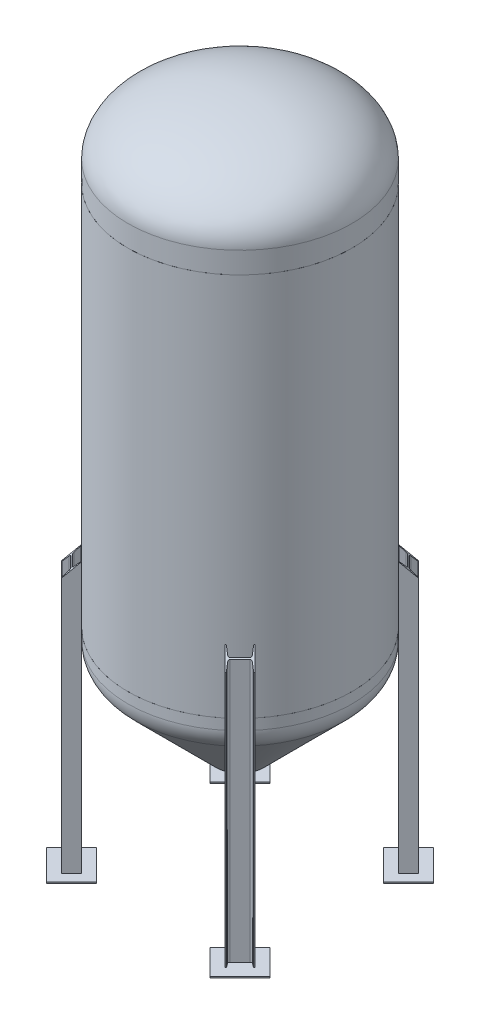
ISO-10303-21;
HEADER;
FILE_DESCRIPTION(('STEP AP214'),'2;1');
FILE_NAME('part.step','',(''),(''),'','','');
FILE_SCHEMA(('AUTOMOTIVE_DESIGN { 1 0 10303 214 1 1 1 1 }'));
ENDSEC;
DATA;
#1=APPLICATION_CONTEXT('core data for automotive mechanical design processes');
#2=APPLICATION_PROTOCOL_DEFINITION('international standard','automotive_design',2000,#1);
#3=PRODUCT_CONTEXT('',#1,'mechanical');
#4=PRODUCT('Part','Part','',(#3));
#5=PRODUCT_RELATED_PRODUCT_CATEGORY('part','',(#4));
#6=PRODUCT_DEFINITION_FORMATION('','',#4);
#7=PRODUCT_DEFINITION_CONTEXT('part definition',#1,'design');
#8=PRODUCT_DEFINITION('design','',#6,#7);
#9=PRODUCT_DEFINITION_SHAPE('','',#8);
#10=(LENGTH_UNIT() NAMED_UNIT(*) SI_UNIT(.MILLI.,.METRE.));
#11=(NAMED_UNIT(*) PLANE_ANGLE_UNIT() SI_UNIT($,.RADIAN.));
#12=(NAMED_UNIT(*) SI_UNIT($,.STERADIAN.) SOLID_ANGLE_UNIT());
#13=UNCERTAINTY_MEASURE_WITH_UNIT(LENGTH_MEASURE(1.E-05),#10,'distance_accuracy_value','');
#14=(GEOMETRIC_REPRESENTATION_CONTEXT(3) GLOBAL_UNCERTAINTY_ASSIGNED_CONTEXT((#13)) GLOBAL_UNIT_ASSIGNED_CONTEXT((#10,
#11,#12)) REPRESENTATION_CONTEXT('',''));
#15=CARTESIAN_POINT('',(0.,0.,0.));
#16=DIRECTION('',(0.,0.,1.));
#17=DIRECTION('',(1.,0.,0.));
#18=AXIS2_PLACEMENT_3D('',#15,#16,#17);
#19=CARTESIAN_POINT('',(413.091781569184,-2910.64986630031,-341.249732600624));
#20=DIRECTION('',(-0.707106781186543,0.,-0.707106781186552));
#21=DIRECTION('',(-0.707106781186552,0.,0.707106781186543));
#22=AXIS2_PLACEMENT_3D('',#19,#20,#21);
#23=PLANE('',#22);
#24=DIRECTION('',(0.5,-0.707106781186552,-0.499999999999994));
#25=VECTOR('',#24,1.);
#26=CARTESIAN_POINT('',(867.425518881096,-2268.12493315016,-795.58346991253));
#27=LINE('',#26,#25);
#28=CARTESIAN_POINT('',(413.091781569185,-1625.6,-341.249732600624));
#29=VERTEX_POINT('',#28);
#30=CARTESIAN_POINT('',(460.92062567,-1693.2402,-389.078576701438));
#31=VERTEX_POINT('',#30);
#32=EDGE_CURVE('E185',#29,#31,#27,.T.);
#33=ORIENTED_EDGE('',*,*,#32,.F.);
#34=DIRECTION('',(0.,1.,0.));
#35=VECTOR('',#34,1.);
#36=CARTESIAN_POINT('',(413.091781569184,-2910.64986630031,-341.249732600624));
#37=LINE('',#36,#35);
#38=CARTESIAN_POINT('',(413.091781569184,-2910.64986630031,-341.249732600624));
#39=VERTEX_POINT('',#38);
#40=EDGE_CURVE('E12',#39,#29,#37,.T.);
#41=ORIENTED_EDGE('',*,*,#40,.F.);
#42=DIRECTION('',(-0.707106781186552,0.,0.707106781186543));
#43=VECTOR('',#42,1.);
#44=CARTESIAN_POINT('',(413.091781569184,-2910.64986630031,-341.249732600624));
#45=LINE('',#44,#43);
#46=CARTESIAN_POINT('',(460.920625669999,-2910.64986630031,-389.078576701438));
#47=VERTEX_POINT('',#46);
#48=EDGE_CURVE('E204',#47,#39,#45,.T.);
#49=ORIENTED_EDGE('',*,*,#48,.F.);
#50=DIRECTION('',(0.,1.,0.));
#51=VECTOR('',#50,1.);
#52=CARTESIAN_POINT('',(460.920625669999,-2910.64986630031,-389.078576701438));
#53=LINE('',#52,#51);
#54=EDGE_CURVE('E198',#47,#31,#53,.T.);
#55=ORIENTED_EDGE('',*,*,#54,.T.);
#56=EDGE_LOOP('',(#33,#41,#49,#55));
#57=FACE_BOUND('',#56,.T.);
#58=ADVANCED_FACE('F51',(#57),#23,.F.);
#59=CARTESIAN_POINT('',(413.326976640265,-2910.64986630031,-344.965850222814));
#60=DIRECTION('',(0.,1.,0.));
#61=DIRECTION('',(1.,0.,0.));
#62=AXIS2_PLACEMENT_3D('',#59,#60,#61);
#63=CYLINDRICAL_SURFACE('',#62,2.79400000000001);
#64=CARTESIAN_POINT('',(413.326976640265,-1628.394,-344.965850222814));
#65=DIRECTION('',(0.500000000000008,0.707106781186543,-0.499999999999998));
#66=DIRECTION('',(-0.500000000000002,0.707106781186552,0.499999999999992));
#67=AXIS2_PLACEMENT_3D('',#64,#65,#66);
#68=ELLIPSE('',#67,3.95131269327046,2.79400000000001);
#69=CARTESIAN_POINT('',(411.053386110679,-1627.93463662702,-346.589802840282));
#70=VERTEX_POINT('',#69);
#71=CARTESIAN_POINT('',(411.35132029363,-1625.6,-342.990193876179));
#72=VERTEX_POINT('',#71);
#73=EDGE_CURVE('E188',#70,#72,#68,.T.);
#74=ORIENTED_EDGE('',*,*,#73,.F.);
#75=DIRECTION('',(0.,1.,0.));
#76=VECTOR('',#75,1.);
#77=CARTESIAN_POINT('',(411.053386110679,-2910.64986630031,-346.589802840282));
#78=LINE('',#77,#76);
#79=CARTESIAN_POINT('',(411.053386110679,-2910.64986630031,-346.589802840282));
#80=VERTEX_POINT('',#79);
#81=EDGE_CURVE('E295',#80,#70,#78,.T.);
#82=ORIENTED_EDGE('',*,*,#81,.F.);
#83=CARTESIAN_POINT('',(413.326976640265,-2910.64986630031,-344.965850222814));
#84=DIRECTION('',(0.,-1.,0.));
#85=DIRECTION('',(-1.,0.,0.));
#86=AXIS2_PLACEMENT_3D('',#83,#84,#85);
#87=CIRCLE('',#86,2.79400000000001);
#88=CARTESIAN_POINT('',(411.351320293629,-2910.64986630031,-342.990193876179));
#89=VERTEX_POINT('',#88);
#90=EDGE_CURVE('E203',#89,#80,#87,.T.);
#91=ORIENTED_EDGE('',*,*,#90,.F.);
#92=DIRECTION('',(0.,1.,0.));
#93=VECTOR('',#92,1.);
#94=CARTESIAN_POINT('',(411.351320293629,-2910.64986630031,-342.990193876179));
#95=LINE('',#94,#93);
#96=EDGE_CURVE('E59',#89,#72,#95,.T.);
#97=ORIENTED_EDGE('',*,*,#96,.T.);
#98=EDGE_LOOP('',(#74,#82,#91,#97));
#99=FACE_BOUND('',#98,.T.);
#100=ADVANCED_FACE('F298',(#99),#63,.T.);
#101=CARTESIAN_POINT('',(424.535012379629,-2910.64986630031,-365.464551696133));
#102=DIRECTION('',(0.813740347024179,0.,0.581228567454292));
#103=DIRECTION('',(0.581228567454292,0.,-0.813740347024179));
#104=AXIS2_PLACEMENT_3D('',#101,#102,#103);
#105=PLANE('',#104);
#106=DIRECTION('',(-0.413796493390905,0.702246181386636,0.579329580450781));
#107=VECTOR('',#106,1.);
#108=CARTESIAN_POINT('',(790.626932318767,-2272.10170337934,-878.006058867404));
#109=LINE('',#108,#107);
#110=CARTESIAN_POINT('',(424.535012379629,-1650.81404889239,-365.464551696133));
#111=VERTEX_POINT('',#110);
#112=EDGE_CURVE('E307',#111,#70,#109,.T.);
#113=ORIENTED_EDGE('',*,*,#112,.F.);
#114=DIRECTION('',(0.,1.,0.));
#115=VECTOR('',#114,1.);
#116=CARTESIAN_POINT('',(424.535012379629,-2910.64986630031,-365.464551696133));
#117=LINE('',#116,#115);
#118=CARTESIAN_POINT('',(424.535012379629,-2910.64986630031,-365.464551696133));
#119=VERTEX_POINT('',#118);
#120=EDGE_CURVE('E292',#119,#111,#117,.T.);
#121=ORIENTED_EDGE('',*,*,#120,.F.);
#122=DIRECTION('',(0.581228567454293,0.,-0.813740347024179));
#123=VECTOR('',#122,1.);
#124=CARTESIAN_POINT('',(424.535012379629,-2910.64986630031,-365.464551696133));
#125=LINE('',#124,#123);
#126=EDGE_CURVE('E213',#80,#119,#125,.T.);
#127=ORIENTED_EDGE('',*,*,#126,.F.);
#128=ORIENTED_EDGE('',*,*,#81,.T.);
#129=EDGE_LOOP('',(#113,#121,#127,#128));
#130=FACE_BOUND('',#129,.T.);
#131=ADVANCED_FACE('F306',(#130),#105,.F.);
#132=CARTESIAN_POINT('',(418.541000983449,-2910.64986630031,-369.745881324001));
#133=DIRECTION('',(0.,1.,0.));
#134=DIRECTION('',(1.,0.,0.));
#135=AXIS2_PLACEMENT_3D('',#132,#133,#134);
#136=CYLINDRICAL_SURFACE('',#135,7.36600000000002);
#137=CARTESIAN_POINT('',(418.541000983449,-1649.603,-369.745881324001));
#138=DIRECTION('',(0.500000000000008,0.707106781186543,-0.499999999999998));
#139=DIRECTION('',(-0.500000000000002,0.707106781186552,0.499999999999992));
#140=AXIS2_PLACEMENT_3D('',#137,#138,#139);
#141=ELLIPSE('',#140,10.4170971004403,7.36600000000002);
#142=CARTESIAN_POINT('',(423.749549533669,-1656.969,-374.954429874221));
#143=VERTEX_POINT('',#142);
#144=EDGE_CURVE('E312',#143,#111,#141,.F.);
#145=ORIENTED_EDGE('',*,*,#144,.F.);
#146=DIRECTION('',(0.,1.,0.));
#147=VECTOR('',#146,1.);
#148=CARTESIAN_POINT('',(423.749549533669,-2910.64986630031,-374.954429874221));
#149=LINE('',#148,#147);
#150=CARTESIAN_POINT('',(423.749549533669,-2910.64986630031,-374.954429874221));
#151=VERTEX_POINT('',#150);
#152=EDGE_CURVE('E289',#151,#143,#149,.T.);
#153=ORIENTED_EDGE('',*,*,#152,.F.);
#154=CARTESIAN_POINT('',(418.541000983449,-2910.64986630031,-369.745881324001));
#155=DIRECTION('',(0.,1.,0.));
#156=DIRECTION('',(-1.,0.,0.));
#157=AXIS2_PLACEMENT_3D('',#154,#155,#156);
#158=CIRCLE('',#157,7.36600000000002);
#159=EDGE_CURVE('E215',#119,#151,#158,.T.);
#160=ORIENTED_EDGE('',*,*,#159,.F.);
#161=ORIENTED_EDGE('',*,*,#120,.T.);
#162=EDGE_LOOP('',(#145,#153,#160,#161));
#163=FACE_BOUND('',#162,.T.);
#164=ADVANCED_FACE('F310',(#163),#136,.F.);
#165=CARTESIAN_POINT('',(374.954429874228,-2910.64986630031,-423.749549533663));
#166=DIRECTION('',(0.707106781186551,0.,-0.707106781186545));
#167=DIRECTION('',(-0.707106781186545,0.,-0.707106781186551));
#168=AXIS2_PLACEMENT_3D('',#165,#166,#167);
#169=PLANE('',#168);
#170=DIRECTION('',(0.707106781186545,0.,0.707106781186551));
#171=VECTOR('',#170,1.);
#172=CARTESIAN_POINT('',(374.954429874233,-1656.969,-423.749549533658));
#173=LINE('',#172,#171);
#174=CARTESIAN_POINT('',(374.954429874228,-1656.969,-423.749549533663));
#175=VERTEX_POINT('',#174);
#176=EDGE_CURVE('E410',#175,#143,#173,.T.);
#177=ORIENTED_EDGE('',*,*,#176,.F.);
#178=DIRECTION('',(0.,1.,0.));
#179=VECTOR('',#178,1.);
#180=CARTESIAN_POINT('',(374.954429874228,-2910.64986630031,-423.749549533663));
#181=LINE('',#180,#179);
#182=CARTESIAN_POINT('',(374.954429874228,-2910.64986630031,-423.749549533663));
#183=VERTEX_POINT('',#182);
#184=EDGE_CURVE('E286',#183,#175,#181,.T.);
#185=ORIENTED_EDGE('',*,*,#184,.F.);
#186=DIRECTION('',(-0.707106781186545,0.,-0.707106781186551));
#187=VECTOR('',#186,1.);
#188=CARTESIAN_POINT('',(374.954429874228,-2910.64986630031,-423.749549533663));
#189=LINE('',#188,#187);
#190=EDGE_CURVE('E217',#151,#183,#189,.T.);
#191=ORIENTED_EDGE('',*,*,#190,.F.);
#192=ORIENTED_EDGE('',*,*,#152,.T.);
#193=EDGE_LOOP('',(#177,#185,#191,#192));
#194=FACE_BOUND('',#193,.T.);
#195=ADVANCED_FACE('F316',(#194),#169,.F.);
#196=CARTESIAN_POINT('',(369.745881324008,-2910.64986630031,-418.541000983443));
#197=DIRECTION('',(0.,1.,0.));
#198=DIRECTION('',(1.,0.,0.));
#199=AXIS2_PLACEMENT_3D('',#196,#197,#198);
#200=CYLINDRICAL_SURFACE('',#199,7.366);
#201=CARTESIAN_POINT('',(369.745881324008,-1649.603,-418.541000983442));
#202=DIRECTION('',(0.500000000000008,0.707106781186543,-0.499999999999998));
#203=DIRECTION('',(-0.500000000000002,0.707106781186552,0.499999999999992));
#204=AXIS2_PLACEMENT_3D('',#201,#202,#203);
#205=ELLIPSE('',#204,10.4170971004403,7.366);
#206=CARTESIAN_POINT('',(365.46455169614,-1650.81404889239,-424.535012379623));
#207=VERTEX_POINT('',#206);
#208=EDGE_CURVE('E324',#207,#175,#205,.F.);
#209=ORIENTED_EDGE('',*,*,#208,.F.);
#210=DIRECTION('',(0.,1.,0.));
#211=VECTOR('',#210,1.);
#212=CARTESIAN_POINT('',(365.46455169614,-2910.64986630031,-424.535012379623));
#213=LINE('',#212,#211);
#214=CARTESIAN_POINT('',(365.46455169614,-2910.64986630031,-424.535012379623));
#215=VERTEX_POINT('',#214);
#216=EDGE_CURVE('E283',#215,#207,#213,.T.);
#217=ORIENTED_EDGE('',*,*,#216,.F.);
#218=CARTESIAN_POINT('',(369.745881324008,-2910.64986630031,-418.541000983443));
#219=DIRECTION('',(0.,1.,0.));
#220=DIRECTION('',(-1.,0.,0.));
#221=AXIS2_PLACEMENT_3D('',#218,#219,#220);
#222=CIRCLE('',#221,7.366);
#223=EDGE_CURVE('E219',#183,#215,#222,.T.);
#224=ORIENTED_EDGE('',*,*,#223,.F.);
#225=ORIENTED_EDGE('',*,*,#184,.T.);
#226=EDGE_LOOP('',(#209,#217,#224,#225));
#227=FACE_BOUND('',#226,.T.);
#228=ADVANCED_FACE('F323',(#227),#200,.F.);
#229=CARTESIAN_POINT('',(346.589802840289,-2910.64986630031,-411.053386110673));
#230=DIRECTION('',(-0.581228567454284,0.,-0.813740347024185));
#231=DIRECTION('',(-0.813740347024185,0.,0.581228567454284));
#232=AXIS2_PLACEMENT_3D('',#229,#230,#231);
#233=PLANE('',#232);
#234=DIRECTION('',(0.579329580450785,-0.702246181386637,-0.413796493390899));
#235=VECTOR('',#234,1.);
#236=CARTESIAN_POINT('',(868.439386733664,-2260.50526639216,-783.793765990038));
#237=LINE('',#236,#235);
#238=CARTESIAN_POINT('',(346.589802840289,-1627.93463662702,-411.053386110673));
#239=VERTEX_POINT('',#238);
#240=EDGE_CURVE('E329',#239,#207,#237,.T.);
#241=ORIENTED_EDGE('',*,*,#240,.F.);
#242=DIRECTION('',(0.,1.,0.));
#243=VECTOR('',#242,1.);
#244=CARTESIAN_POINT('',(346.589802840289,-2910.64986630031,-411.053386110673));
#245=LINE('',#244,#243);
#246=CARTESIAN_POINT('',(346.589802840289,-2910.64986630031,-411.053386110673));
#247=VERTEX_POINT('',#246);
#248=EDGE_CURVE('E280',#247,#239,#245,.T.);
#249=ORIENTED_EDGE('',*,*,#248,.F.);
#250=DIRECTION('',(-0.813740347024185,0.,0.581228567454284));
#251=VECTOR('',#250,1.);
#252=CARTESIAN_POINT('',(346.589802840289,-2910.64986630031,-411.053386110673));
#253=LINE('',#252,#251);
#254=EDGE_CURVE('E221',#215,#247,#253,.T.);
#255=ORIENTED_EDGE('',*,*,#254,.F.);
#256=ORIENTED_EDGE('',*,*,#216,.T.);
#257=EDGE_LOOP('',(#241,#249,#255,#256));
#258=FACE_BOUND('',#257,.T.);
#259=ADVANCED_FACE('F327',(#258),#233,.F.);
#260=CARTESIAN_POINT('',(344.965850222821,-2910.64986630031,-413.326976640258));
#261=DIRECTION('',(0.,1.,0.));
#262=DIRECTION('',(1.,0.,0.));
#263=AXIS2_PLACEMENT_3D('',#260,#261,#262);
#264=CYLINDRICAL_SURFACE('',#263,2.79399999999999);
#265=CARTESIAN_POINT('',(344.965850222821,-1628.394,-413.326976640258));
#266=DIRECTION('',(0.500000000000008,0.707106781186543,-0.499999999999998));
#267=DIRECTION('',(-0.500000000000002,0.707106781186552,0.499999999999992));
#268=AXIS2_PLACEMENT_3D('',#265,#266,#267);
#269=ELLIPSE('',#268,3.95131269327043,2.79399999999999);
#270=CARTESIAN_POINT('',(342.990193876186,-1625.6,-411.351320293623));
#271=VERTEX_POINT('',#270);
#272=EDGE_CURVE('E406',#271,#239,#269,.T.);
#273=ORIENTED_EDGE('',*,*,#272,.F.);
#274=DIRECTION('',(0.,1.,0.));
#275=VECTOR('',#274,1.);
#276=CARTESIAN_POINT('',(342.990193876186,-2910.64986630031,-411.351320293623));
#277=LINE('',#276,#275);
#278=CARTESIAN_POINT('',(342.990193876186,-2910.64986630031,-411.351320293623));
#279=VERTEX_POINT('',#278);
#280=EDGE_CURVE('E277',#279,#271,#277,.T.);
#281=ORIENTED_EDGE('',*,*,#280,.F.);
#282=CARTESIAN_POINT('',(344.965850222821,-2910.64986630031,-413.326976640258));
#283=DIRECTION('',(0.,-1.,0.));
#284=DIRECTION('',(-1.,0.,0.));
#285=AXIS2_PLACEMENT_3D('',#282,#283,#284);
#286=CIRCLE('',#285,2.79399999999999);
#287=EDGE_CURVE('E223',#247,#279,#286,.T.);
#288=ORIENTED_EDGE('',*,*,#287,.F.);
#289=ORIENTED_EDGE('',*,*,#248,.T.);
#290=EDGE_LOOP('',(#273,#281,#288,#289));
#291=FACE_BOUND('',#290,.T.);
#292=ADVANCED_FACE('F333',(#291),#264,.T.);
#293=CARTESIAN_POINT('',(389.078576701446,-2910.64986630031,-460.920625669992));
#294=DIRECTION('',(0.707106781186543,0.,0.707106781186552));
#295=DIRECTION('',(0.707106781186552,0.,-0.707106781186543));
#296=AXIS2_PLACEMENT_3D('',#293,#294,#295);
#297=PLANE('',#296);
#298=DIRECTION('',(-0.5,0.707106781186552,0.499999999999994));
#299=VECTOR('',#298,1.);
#300=CARTESIAN_POINT('',(819.49789196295,-2301.94503315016,-891.339940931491));
#301=LINE('',#300,#299);
#302=CARTESIAN_POINT('',(389.078576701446,-1693.2402,-460.920625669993));
#303=VERTEX_POINT('',#302);
#304=CARTESIAN_POINT('',(341.249732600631,-1625.6,-413.091781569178));
#305=VERTEX_POINT('',#304);
#306=EDGE_CURVE('E345',#303,#305,#301,.T.);
#307=ORIENTED_EDGE('',*,*,#306,.F.);
#308=DIRECTION('',(0.,1.,0.));
#309=VECTOR('',#308,1.);
#310=CARTESIAN_POINT('',(389.078576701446,-2910.64986630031,-460.920625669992));
#311=LINE('',#310,#309);
#312=CARTESIAN_POINT('',(389.078576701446,-2910.64986630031,-460.920625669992));
#313=VERTEX_POINT('',#312);
#314=EDGE_CURVE('E271',#313,#303,#311,.T.);
#315=ORIENTED_EDGE('',*,*,#314,.F.);
#316=DIRECTION('',(0.707106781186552,0.,-0.707106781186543));
#317=VECTOR('',#316,1.);
#318=CARTESIAN_POINT('',(389.078576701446,-2910.64986630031,-460.920625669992));
#319=LINE('',#318,#317);
#320=CARTESIAN_POINT('',(341.249732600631,-2910.64986630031,-413.091781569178));
#321=VERTEX_POINT('',#320);
#322=EDGE_CURVE('E227',#321,#313,#319,.T.);
#323=ORIENTED_EDGE('',*,*,#322,.F.);
#324=DIRECTION('',(0.,1.,0.));
#325=VECTOR('',#324,1.);
#326=CARTESIAN_POINT('',(341.249732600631,-2910.64986630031,-413.091781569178));
#327=LINE('',#326,#325);
#328=EDGE_CURVE('E274',#321,#305,#327,.T.);
#329=ORIENTED_EDGE('',*,*,#328,.T.);
#330=EDGE_LOOP('',(#307,#315,#323,#329));
#331=FACE_BOUND('',#330,.T.);
#332=ADVANCED_FACE('F342',(#331),#297,.F.);
#333=CARTESIAN_POINT('',(390.819037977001,-2910.64986630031,-459.180164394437));
#334=DIRECTION('',(-0.707106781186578,0.,0.707106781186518));
#335=DIRECTION('',(0.707106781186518,0.,0.707106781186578));
#336=AXIS2_PLACEMENT_3D('',#333,#334,#335);
#337=PLANE('',#336);
#338=DIRECTION('',(-0.707106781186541,0.,-0.707106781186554));
#339=VECTOR('',#338,1.);
#340=CARTESIAN_POINT('',(3953.18617331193,-1693.2402,3103.18697094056));
#341=LINE('',#340,#339);
#342=CARTESIAN_POINT('',(390.819037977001,-1693.2402,-459.180164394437));
#343=VERTEX_POINT('',#342);
#344=EDGE_CURVE('E393',#343,#303,#341,.T.);
#345=ORIENTED_EDGE('',*,*,#344,.F.);
#346=DIRECTION('',(0.,1.,0.));
#347=VECTOR('',#346,1.);
#348=CARTESIAN_POINT('',(390.819037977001,-2910.64986630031,-459.180164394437));
#349=LINE('',#348,#347);
#350=CARTESIAN_POINT('',(390.819037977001,-2910.64986630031,-459.180164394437));
#351=VERTEX_POINT('',#350);
#352=EDGE_CURVE('E268',#351,#343,#349,.T.);
#353=ORIENTED_EDGE('',*,*,#352,.F.);
#354=DIRECTION('',(0.707106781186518,0.,0.707106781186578));
#355=VECTOR('',#354,1.);
#356=CARTESIAN_POINT('',(390.819037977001,-2910.64986630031,-459.180164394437));
#357=LINE('',#356,#355);
#358=EDGE_CURVE('E229',#313,#351,#357,.T.);
#359=ORIENTED_EDGE('',*,*,#358,.F.);
#360=ORIENTED_EDGE('',*,*,#314,.T.);
#361=EDGE_LOOP('',(#345,#353,#359,#360));
#362=FACE_BOUND('',#361,.T.);
#363=ADVANCED_FACE('F349',(#362),#337,.F.);
#364=CARTESIAN_POINT('',(388.843381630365,-2910.64986630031,-457.204508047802));
#365=DIRECTION('',(0.,1.,0.));
#366=DIRECTION('',(1.,0.,0.));
#367=AXIS2_PLACEMENT_3D('',#364,#365,#366);
#368=CYLINDRICAL_SURFACE('',#367,2.79399999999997);
#369=CARTESIAN_POINT('',(388.843381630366,-1690.4462,-457.204508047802));
#370=DIRECTION('',(0.500000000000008,0.707106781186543,-0.499999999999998));
#371=DIRECTION('',(-0.500000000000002,0.707106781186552,0.499999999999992));
#372=AXIS2_PLACEMENT_3D('',#369,#370,#371);
#373=ELLIPSE('',#372,3.95131269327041,2.79399999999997);
#374=CARTESIAN_POINT('',(391.116972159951,-1690.90556337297,-455.580555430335));
#375=VERTEX_POINT('',#374);
#376=EDGE_CURVE('E357',#375,#343,#373,.T.);
#377=ORIENTED_EDGE('',*,*,#376,.F.);
#378=DIRECTION('',(0.,1.,0.));
#379=VECTOR('',#378,1.);
#380=CARTESIAN_POINT('',(391.116972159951,-2910.64986630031,-455.580555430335));
#381=LINE('',#380,#379);
#382=CARTESIAN_POINT('',(391.116972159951,-2910.64986630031,-455.580555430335));
#383=VERTEX_POINT('',#382);
#384=EDGE_CURVE('E265',#383,#375,#381,.T.);
#385=ORIENTED_EDGE('',*,*,#384,.F.);
#386=CARTESIAN_POINT('',(388.843381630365,-2910.64986630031,-457.204508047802));
#387=DIRECTION('',(0.,-1.,0.));
#388=DIRECTION('',(1.,0.,0.));
#389=AXIS2_PLACEMENT_3D('',#386,#387,#388);
#390=CIRCLE('',#389,2.79399999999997);
#391=EDGE_CURVE('E231',#351,#383,#390,.T.);
#392=ORIENTED_EDGE('',*,*,#391,.F.);
#393=ORIENTED_EDGE('',*,*,#352,.T.);
#394=EDGE_LOOP('',(#377,#385,#392,#393));
#395=FACE_BOUND('',#394,.T.);
#396=ADVANCED_FACE('F356',(#395),#368,.T.);
#397=CARTESIAN_POINT('',(377.635345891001,-2910.64986630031,-436.705806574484));
#398=DIRECTION('',(-0.813740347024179,0.,-0.581228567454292));
#399=DIRECTION('',(-0.581228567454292,0.,0.813740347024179));
#400=AXIS2_PLACEMENT_3D('',#397,#398,#399);
#401=PLANE('',#400);
#402=DIRECTION('',(0.413796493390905,-0.702246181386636,-0.579329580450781));
#403=VECTOR('',#402,1.);
#404=CARTESIAN_POINT('',(738.72565255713,-2280.82566256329,-942.244880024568));
#405=LINE('',#404,#403);
#406=CARTESIAN_POINT('',(377.635345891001,-1668.02615110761,-436.705806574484));
#407=VERTEX_POINT('',#406);
#408=EDGE_CURVE('E362',#407,#375,#405,.T.);
#409=ORIENTED_EDGE('',*,*,#408,.F.);
#410=DIRECTION('',(0.,1.,0.));
#411=VECTOR('',#410,1.);
#412=CARTESIAN_POINT('',(377.635345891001,-2910.64986630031,-436.705806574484));
#413=LINE('',#412,#411);
#414=CARTESIAN_POINT('',(377.635345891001,-2910.64986630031,-436.705806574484));
#415=VERTEX_POINT('',#414);
#416=EDGE_CURVE('E262',#415,#407,#413,.T.);
#417=ORIENTED_EDGE('',*,*,#416,.F.);
#418=DIRECTION('',(-0.581228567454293,0.,0.813740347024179));
#419=VECTOR('',#418,1.);
#420=CARTESIAN_POINT('',(377.635345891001,-2910.64986630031,-436.705806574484));
#421=LINE('',#420,#419);
#422=EDGE_CURVE('E233',#383,#415,#421,.T.);
#423=ORIENTED_EDGE('',*,*,#422,.F.);
#424=ORIENTED_EDGE('',*,*,#384,.T.);
#425=EDGE_LOOP('',(#409,#417,#423,#424));
#426=FACE_BOUND('',#425,.T.);
#427=ADVANCED_FACE('F360',(#426),#401,.F.);
#428=CARTESIAN_POINT('',(383.629357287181,-2910.64986630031,-432.424476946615));
#429=DIRECTION('',(0.,1.,0.));
#430=DIRECTION('',(1.,0.,0.));
#431=AXIS2_PLACEMENT_3D('',#428,#429,#430);
#432=CYLINDRICAL_SURFACE('',#431,7.36600000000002);
#433=CARTESIAN_POINT('',(383.629357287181,-1669.2372,-432.424476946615));
#434=DIRECTION('',(0.500000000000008,0.707106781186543,-0.499999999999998));
#435=DIRECTION('',(-0.500000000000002,0.707106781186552,0.499999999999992));
#436=AXIS2_PLACEMENT_3D('',#433,#434,#435);
#437=ELLIPSE('',#436,10.4170971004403,7.36600000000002);
#438=CARTESIAN_POINT('',(378.420808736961,-1661.8712,-427.215928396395));
#439=VERTEX_POINT('',#438);
#440=EDGE_CURVE('E401',#439,#407,#437,.F.);
#441=ORIENTED_EDGE('',*,*,#440,.F.);
#442=DIRECTION('',(0.,1.,0.));
#443=VECTOR('',#442,1.);
#444=CARTESIAN_POINT('',(378.420808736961,-2910.64986630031,-427.215928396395));
#445=LINE('',#444,#443);
#446=CARTESIAN_POINT('',(378.420808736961,-2910.64986630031,-427.215928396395));
#447=VERTEX_POINT('',#446);
#448=EDGE_CURVE('E259',#447,#439,#445,.T.);
#449=ORIENTED_EDGE('',*,*,#448,.F.);
#450=CARTESIAN_POINT('',(383.629357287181,-2910.64986630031,-432.424476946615));
#451=DIRECTION('',(0.,1.,0.));
#452=DIRECTION('',(-1.,0.,0.));
#453=AXIS2_PLACEMENT_3D('',#450,#451,#452);
#454=CIRCLE('',#453,7.36600000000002);
#455=EDGE_CURVE('E235',#415,#447,#454,.T.);
#456=ORIENTED_EDGE('',*,*,#455,.F.);
#457=ORIENTED_EDGE('',*,*,#416,.T.);
#458=EDGE_LOOP('',(#441,#449,#456,#457));
#459=FACE_BOUND('',#458,.T.);
#460=ADVANCED_FACE('F366',(#459),#432,.F.);
#461=CARTESIAN_POINT('',(427.215928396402,-2910.64986630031,-378.420808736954));
#462=DIRECTION('',(-0.707106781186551,0.,0.707106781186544));
#463=DIRECTION('',(0.707106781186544,0.,0.707106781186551));
#464=AXIS2_PLACEMENT_3D('',#461,#462,#463);
#465=PLANE('',#464);
#466=DIRECTION('',(-0.707106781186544,0.,-0.707106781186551));
#467=VECTOR('',#466,1.);
#468=CARTESIAN_POINT('',(427.215928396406,-1661.8712,-378.420808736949));
#469=LINE('',#468,#467);
#470=CARTESIAN_POINT('',(427.215928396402,-1661.8712,-378.420808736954));
#471=VERTEX_POINT('',#470);
#472=EDGE_CURVE('E374',#471,#439,#469,.T.);
#473=ORIENTED_EDGE('',*,*,#472,.F.);
#474=DIRECTION('',(0.,1.,0.));
#475=VECTOR('',#474,1.);
#476=CARTESIAN_POINT('',(427.215928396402,-2910.64986630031,-378.420808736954));
#477=LINE('',#476,#475);
#478=CARTESIAN_POINT('',(427.215928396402,-2910.64986630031,-378.420808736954));
#479=VERTEX_POINT('',#478);
#480=EDGE_CURVE('E256',#479,#471,#477,.T.);
#481=ORIENTED_EDGE('',*,*,#480,.F.);
#482=DIRECTION('',(0.707106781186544,0.,0.707106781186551));
#483=VECTOR('',#482,1.);
#484=CARTESIAN_POINT('',(427.215928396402,-2910.64986630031,-378.420808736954));
#485=LINE('',#484,#483);
#486=EDGE_CURVE('E237',#447,#479,#485,.T.);
#487=ORIENTED_EDGE('',*,*,#486,.F.);
#488=ORIENTED_EDGE('',*,*,#448,.T.);
#489=EDGE_LOOP('',(#473,#481,#487,#488));
#490=FACE_BOUND('',#489,.T.);
#491=ADVANCED_FACE('F373',(#490),#465,.F.);
#492=CARTESIAN_POINT('',(432.424476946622,-2910.64986630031,-383.629357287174));
#493=DIRECTION('',(0.,1.,0.));
#494=DIRECTION('',(1.,0.,0.));
#495=AXIS2_PLACEMENT_3D('',#492,#493,#494);
#496=CYLINDRICAL_SURFACE('',#495,7.366);
#497=CARTESIAN_POINT('',(432.424476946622,-1669.2372,-383.629357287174));
#498=DIRECTION('',(0.500000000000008,0.707106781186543,-0.499999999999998));
#499=DIRECTION('',(-0.500000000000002,0.707106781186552,0.499999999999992));
#500=AXIS2_PLACEMENT_3D('',#497,#498,#499);
#501=ELLIPSE('',#500,10.4170971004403,7.366);
#502=CARTESIAN_POINT('',(436.70580657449,-1668.02615110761,-377.635345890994));
#503=VERTEX_POINT('',#502);
#504=EDGE_CURVE('E379',#503,#471,#501,.F.);
#505=ORIENTED_EDGE('',*,*,#504,.F.);
#506=DIRECTION('',(0.,1.,0.));
#507=VECTOR('',#506,1.);
#508=CARTESIAN_POINT('',(436.70580657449,-2910.64986630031,-377.635345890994));
#509=LINE('',#508,#507);
#510=CARTESIAN_POINT('',(436.70580657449,-2910.64986630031,-377.635345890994));
#511=VERTEX_POINT('',#510);
#512=EDGE_CURVE('E253',#511,#503,#509,.T.);
#513=ORIENTED_EDGE('',*,*,#512,.F.);
#514=CARTESIAN_POINT('',(432.424476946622,-2910.64986630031,-383.629357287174));
#515=DIRECTION('',(0.,1.,0.));
#516=DIRECTION('',(-1.,0.,0.));
#517=AXIS2_PLACEMENT_3D('',#514,#515,#516);
#518=CIRCLE('',#517,7.366);
#519=EDGE_CURVE('E239',#479,#511,#518,.T.);
#520=ORIENTED_EDGE('',*,*,#519,.F.);
#521=ORIENTED_EDGE('',*,*,#480,.T.);
#522=EDGE_LOOP('',(#505,#513,#520,#521));
#523=FACE_BOUND('',#522,.T.);
#524=ADVANCED_FACE('F377',(#523),#496,.F.);
#525=CARTESIAN_POINT('',(455.580555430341,-2910.64986630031,-391.116972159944));
#526=DIRECTION('',(0.581228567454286,0.,0.813740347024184));
#527=DIRECTION('',(0.813740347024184,0.,-0.581228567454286));
#528=AXIS2_PLACEMENT_3D('',#525,#526,#527);
#529=PLANE('',#528);
#530=DIRECTION('',(-0.579329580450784,0.702246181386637,0.4137964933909));
#531=VECTOR('',#530,1.);
#532=CARTESIAN_POINT('',(951.811552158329,-2292.42209955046,-745.558818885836));
#533=LINE('',#532,#531);
#534=CARTESIAN_POINT('',(455.580555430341,-1690.90556337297,-391.116972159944));
#535=VERTEX_POINT('',#534);
#536=EDGE_CURVE('E395',#535,#503,#533,.T.);
#537=ORIENTED_EDGE('',*,*,#536,.F.);
#538=DIRECTION('',(0.,1.,0.));
#539=VECTOR('',#538,1.);
#540=CARTESIAN_POINT('',(455.580555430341,-2910.64986630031,-391.116972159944));
#541=LINE('',#540,#539);
#542=CARTESIAN_POINT('',(455.580555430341,-2910.64986630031,-391.116972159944));
#543=VERTEX_POINT('',#542);
#544=EDGE_CURVE('E250',#543,#535,#541,.T.);
#545=ORIENTED_EDGE('',*,*,#544,.F.);
#546=DIRECTION('',(0.813740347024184,0.,-0.581228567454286));
#547=VECTOR('',#546,1.);
#548=CARTESIAN_POINT('',(455.580555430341,-2910.64986630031,-391.116972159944));
#549=LINE('',#548,#547);
#550=EDGE_CURVE('E241',#511,#543,#549,.T.);
#551=ORIENTED_EDGE('',*,*,#550,.F.);
#552=ORIENTED_EDGE('',*,*,#512,.T.);
#553=EDGE_LOOP('',(#537,#545,#551,#552));
#554=FACE_BOUND('',#553,.T.);
#555=ADVANCED_FACE('F383',(#554),#529,.F.);
#556=CARTESIAN_POINT('',(457.204508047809,-2910.64986630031,-388.843381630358));
#557=DIRECTION('',(0.,1.,0.));
#558=DIRECTION('',(1.,0.,0.));
#559=AXIS2_PLACEMENT_3D('',#556,#557,#558);
#560=CYLINDRICAL_SURFACE('',#559,2.79399999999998);
#561=CARTESIAN_POINT('',(457.204508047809,-1690.4462,-388.843381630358));
#562=DIRECTION('',(0.500000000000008,0.707106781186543,-0.499999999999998));
#563=DIRECTION('',(-0.500000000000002,0.707106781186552,0.499999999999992));
#564=AXIS2_PLACEMENT_3D('',#561,#562,#563);
#565=ELLIPSE('',#564,3.95131269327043,2.79399999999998);
#566=CARTESIAN_POINT('',(459.180164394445,-1693.2402,-390.819037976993));
#567=VERTEX_POINT('',#566);
#568=EDGE_CURVE('E389',#567,#535,#565,.T.);
#569=ORIENTED_EDGE('',*,*,#568,.F.);
#570=DIRECTION('',(0.,1.,0.));
#571=VECTOR('',#570,1.);
#572=CARTESIAN_POINT('',(459.180164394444,-2910.64986630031,-390.819037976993));
#573=LINE('',#572,#571);
#574=CARTESIAN_POINT('',(459.180164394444,-2910.64986630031,-390.819037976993));
#575=VERTEX_POINT('',#574);
#576=EDGE_CURVE('E247',#575,#567,#573,.T.);
#577=ORIENTED_EDGE('',*,*,#576,.F.);
#578=CARTESIAN_POINT('',(457.204508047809,-2910.64986630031,-388.843381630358));
#579=DIRECTION('',(0.,-1.,0.));
#580=DIRECTION('',(1.,0.,0.));
#581=AXIS2_PLACEMENT_3D('',#578,#579,#580);
#582=CIRCLE('',#581,2.79399999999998);
#583=EDGE_CURVE('E243',#543,#575,#582,.T.);
#584=ORIENTED_EDGE('',*,*,#583,.F.);
#585=ORIENTED_EDGE('',*,*,#544,.T.);
#586=EDGE_LOOP('',(#569,#577,#584,#585));
#587=FACE_BOUND('',#586,.T.);
#588=ADVANCED_FACE('F388',(#587),#560,.T.);
#589=CARTESIAN_POINT('',(460.920625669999,-2910.64986630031,-389.078576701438));
#590=DIRECTION('',(-0.707106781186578,0.,0.707106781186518));
#591=DIRECTION('',(0.707106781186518,0.,0.707106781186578));
#592=AXIS2_PLACEMENT_3D('',#589,#590,#591);
#593=PLANE('',#592);
#594=EDGE_CURVE('E392',#31,#567,#341,.T.);
#595=ORIENTED_EDGE('',*,*,#594,.F.);
#596=ORIENTED_EDGE('',*,*,#54,.F.);
#597=DIRECTION('',(0.707106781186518,0.,0.707106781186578));
#598=VECTOR('',#597,1.);
#599=CARTESIAN_POINT('',(460.920625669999,-2910.64986630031,-389.078576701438));
#600=LINE('',#599,#598);
#601=EDGE_CURVE('E66',#575,#47,#600,.T.);
#602=ORIENTED_EDGE('',*,*,#601,.F.);
#603=ORIENTED_EDGE('',*,*,#576,.T.);
#604=EDGE_LOOP('',(#595,#596,#602,#603));
#605=FACE_BOUND('',#604,.T.);
#606=ADVANCED_FACE('F391',(#605),#593,.F.);
#607=CARTESIAN_POINT('',(411.351320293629,-2910.64986630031,-342.990193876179));
#608=DIRECTION('',(0.707106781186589,0.,-0.707106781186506));
#609=DIRECTION('',(-0.707106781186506,0.,-0.707106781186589));
#610=AXIS2_PLACEMENT_3D('',#607,#608,#609);
#611=PLANE('',#610);
#612=DIRECTION('',(-0.707106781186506,0.,-0.707106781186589));
#613=VECTOR('',#612,1.);
#614=CARTESIAN_POINT('',(411.35132029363,-1625.6,-342.990193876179));
#615=LINE('',#614,#613);
#616=EDGE_CURVE('E182',#29,#72,#615,.T.);
#617=ORIENTED_EDGE('',*,*,#616,.T.);
#618=ORIENTED_EDGE('',*,*,#96,.F.);
#619=DIRECTION('',(-0.707106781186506,0.,-0.707106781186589));
#620=VECTOR('',#619,1.);
#621=CARTESIAN_POINT('',(411.351320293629,-2910.64986630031,-342.990193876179));
#622=LINE('',#621,#620);
#623=EDGE_CURVE('E201',#39,#89,#622,.T.);
#624=ORIENTED_EDGE('',*,*,#623,.F.);
#625=ORIENTED_EDGE('',*,*,#40,.T.);
#626=EDGE_LOOP('',(#617,#618,#624,#625));
#627=FACE_BOUND('',#626,.T.);
#628=ADVANCED_FACE('F200',(#627),#611,.F.);
#629=CARTESIAN_POINT('',(341.249732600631,-2910.64986630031,-413.091781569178));
#630=DIRECTION('',(0.707106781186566,0.,-0.707106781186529));
#631=DIRECTION('',(-0.707106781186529,0.,-0.707106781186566));
#632=AXIS2_PLACEMENT_3D('',#629,#630,#631);
#633=PLANE('',#632);
#634=DIRECTION('',(-0.707106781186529,0.,-0.707106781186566));
#635=VECTOR('',#634,1.);
#636=CARTESIAN_POINT('',(341.249732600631,-1625.6,-413.091781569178));
#637=LINE('',#636,#635);
#638=EDGE_CURVE('E192',#271,#305,#637,.T.);
#639=ORIENTED_EDGE('',*,*,#638,.T.);
#640=ORIENTED_EDGE('',*,*,#328,.F.);
#641=DIRECTION('',(-0.707106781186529,0.,-0.707106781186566));
#642=VECTOR('',#641,1.);
#643=CARTESIAN_POINT('',(341.249732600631,-2910.64986630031,-413.091781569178));
#644=LINE('',#643,#642);
#645=EDGE_CURVE('E225',#279,#321,#644,.T.);
#646=ORIENTED_EDGE('',*,*,#645,.F.);
#647=ORIENTED_EDGE('',*,*,#280,.T.);
#648=EDGE_LOOP('',(#639,#640,#646,#647));
#649=FACE_BOUND('',#648,.T.);
#650=ADVANCED_FACE('F339',(#649),#633,.F.);
#651=CARTESIAN_POINT('',(457.204508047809,-2910.64986630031,-388.843381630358));
#652=DIRECTION('',(0.,1.,0.));
#653=DIRECTION('',(1.,0.,0.));
#654=AXIS2_PLACEMENT_3D('',#651,#652,#653);
#655=PLANE('',#654);
#656=ORIENTED_EDGE('',*,*,#48,.T.);
#657=ORIENTED_EDGE('',*,*,#623,.T.);
#658=ORIENTED_EDGE('',*,*,#90,.T.);
#659=ORIENTED_EDGE('',*,*,#126,.T.);
#660=ORIENTED_EDGE('',*,*,#159,.T.);
#661=ORIENTED_EDGE('',*,*,#190,.T.);
#662=ORIENTED_EDGE('',*,*,#223,.T.);
#663=ORIENTED_EDGE('',*,*,#254,.T.);
#664=ORIENTED_EDGE('',*,*,#287,.T.);
#665=ORIENTED_EDGE('',*,*,#645,.T.);
#666=ORIENTED_EDGE('',*,*,#322,.T.);
#667=ORIENTED_EDGE('',*,*,#358,.T.);
#668=ORIENTED_EDGE('',*,*,#391,.T.);
#669=ORIENTED_EDGE('',*,*,#422,.T.);
#670=ORIENTED_EDGE('',*,*,#455,.T.);
#671=ORIENTED_EDGE('',*,*,#486,.T.);
#672=ORIENTED_EDGE('',*,*,#519,.T.);
#673=ORIENTED_EDGE('',*,*,#550,.T.);
#674=ORIENTED_EDGE('',*,*,#583,.T.);
#675=ORIENTED_EDGE('',*,*,#601,.T.);
#676=EDGE_LOOP('',(#656,#657,#658,#659,#660,#661,#662,#663,#664,#665,#666,#667,#668,#669,#670,
#671,#672,#673,#674,#675));
#677=FACE_BOUND('',#676,.T.);
#678=ADVANCED_FACE('F206',(#677),#655,.F.);
#679=CARTESIAN_POINT('',(3905.35732921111,-1625.6,3151.01581504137));
#680=DIRECTION('',(0.500000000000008,0.707106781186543,-0.499999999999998));
#681=DIRECTION('',(0.,0.577350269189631,0.816496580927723));
#682=AXIS2_PLACEMENT_3D('',#679,#680,#681);
#683=PLANE('',#682);
#684=ORIENTED_EDGE('',*,*,#616,.F.);
#685=ORIENTED_EDGE('',*,*,#32,.T.);
#686=ORIENTED_EDGE('',*,*,#594,.T.);
#687=ORIENTED_EDGE('',*,*,#568,.T.);
#688=ORIENTED_EDGE('',*,*,#536,.T.);
#689=ORIENTED_EDGE('',*,*,#504,.T.);
#690=ORIENTED_EDGE('',*,*,#472,.T.);
#691=ORIENTED_EDGE('',*,*,#440,.T.);
#692=ORIENTED_EDGE('',*,*,#408,.T.);
#693=ORIENTED_EDGE('',*,*,#376,.T.);
#694=ORIENTED_EDGE('',*,*,#344,.T.);
#695=ORIENTED_EDGE('',*,*,#306,.T.);
#696=ORIENTED_EDGE('',*,*,#638,.F.);
#697=ORIENTED_EDGE('',*,*,#272,.T.);
#698=ORIENTED_EDGE('',*,*,#240,.T.);
#699=ORIENTED_EDGE('',*,*,#208,.T.);
#700=ORIENTED_EDGE('',*,*,#176,.T.);
#701=ORIENTED_EDGE('',*,*,#144,.T.);
#702=ORIENTED_EDGE('',*,*,#112,.T.);
#703=ORIENTED_EDGE('',*,*,#73,.T.);
#704=EDGE_LOOP('',(#684,#685,#686,#687,#688,#689,#690,#691,#692,#693,#694,#695,#696,#697,#698,
#699,#700,#701,#702,#703));
#705=FACE_BOUND('',#704,.T.);
#706=ADVANCED_FACE('F184',(#705),#683,.T.);
#707=CLOSED_SHELL('',(#58,#100,#131,#164,#195,#228,#259,#292,#332,#363,#396,#427,#460,#491,#524,
#555,#588,#606,#628,#650,#678,#706));
#708=MANIFOLD_SOLID_BREP('B2',#707);
#709=CARTESIAN_POINT('',(-341.249732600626,-2910.64986630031,-413.091781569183));
#710=DIRECTION('',(-0.70710678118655,0.,0.707106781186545));
#711=DIRECTION('',(0.707106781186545,0.,0.70710678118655));
#712=AXIS2_PLACEMENT_3D('',#709,#710,#711);
#713=PLANE('',#712);
#714=DIRECTION('',(-0.499999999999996,-0.707106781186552,-0.499999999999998));
#715=VECTOR('',#714,1.);
#716=CARTESIAN_POINT('',(-795.583469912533,-2268.12493315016,-867.425518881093));
#717=LINE('',#716,#715);
#718=CARTESIAN_POINT('',(-341.249732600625,-1625.6,-413.091781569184));
#719=VERTEX_POINT('',#718);
#720=CARTESIAN_POINT('',(-389.078576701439,-1693.2402,-460.920625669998));
#721=VERTEX_POINT('',#720);
#722=EDGE_CURVE('E819',#719,#721,#717,.T.);
#723=ORIENTED_EDGE('',*,*,#722,.F.);
#724=DIRECTION('',(0.,1.,0.));
#725=VECTOR('',#724,1.);
#726=CARTESIAN_POINT('',(-341.249732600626,-2910.64986630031,-413.091781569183));
#727=LINE('',#726,#725);
#728=CARTESIAN_POINT('',(-341.249732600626,-2910.64986630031,-413.091781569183));
#729=VERTEX_POINT('',#728);
#730=EDGE_CURVE('E49',#729,#719,#727,.T.);
#731=ORIENTED_EDGE('',*,*,#730,.F.);
#732=DIRECTION('',(0.707106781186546,0.,0.70710678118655));
#733=VECTOR('',#732,1.);
#734=CARTESIAN_POINT('',(-341.249732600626,-2910.64986630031,-413.091781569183));
#735=LINE('',#734,#733);
#736=CARTESIAN_POINT('',(-389.07857670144,-2910.64986630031,-460.920625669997));
#737=VERTEX_POINT('',#736);
#738=EDGE_CURVE('E838',#737,#729,#735,.T.);
#739=ORIENTED_EDGE('',*,*,#738,.F.);
#740=DIRECTION('',(0.,1.,0.));
#741=VECTOR('',#740,1.);
#742=CARTESIAN_POINT('',(-389.07857670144,-2910.64986630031,-460.920625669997));
#743=LINE('',#742,#741);
#744=EDGE_CURVE('E832',#737,#721,#743,.T.);
#745=ORIENTED_EDGE('',*,*,#744,.T.);
#746=EDGE_LOOP('',(#723,#731,#739,#745));
#747=FACE_BOUND('',#746,.T.);
#748=ADVANCED_FACE('F685',(#747),#713,.F.);
#749=CARTESIAN_POINT('',(-344.965850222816,-2910.64986630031,-413.326976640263));
#750=DIRECTION('',(0.,1.,0.));
#751=DIRECTION('',(0.,0.,-1.));
#752=AXIS2_PLACEMENT_3D('',#749,#750,#751);
#753=CYLINDRICAL_SURFACE('',#752,2.79400000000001);
#754=CARTESIAN_POINT('',(-344.965850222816,-1628.394,-413.326976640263));
#755=DIRECTION('',(-0.5,0.707106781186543,-0.500000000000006));
#756=DIRECTION('',(0.499999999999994,0.707106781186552,0.5));
#757=AXIS2_PLACEMENT_3D('',#754,#755,#756);
#758=ELLIPSE('',#757,3.95131269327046,2.79400000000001);
#759=CARTESIAN_POINT('',(-346.589802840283,-1627.93463662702,-411.053386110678));
#760=VERTEX_POINT('',#759);
#761=CARTESIAN_POINT('',(-342.99019387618,-1625.6,-411.351320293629));
#762=VERTEX_POINT('',#761);
#763=EDGE_CURVE('E822',#760,#762,#758,.T.);
#764=ORIENTED_EDGE('',*,*,#763,.F.);
#765=DIRECTION('',(0.,1.,0.));
#766=VECTOR('',#765,1.);
#767=CARTESIAN_POINT('',(-346.589802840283,-2910.64986630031,-411.053386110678));
#768=LINE('',#767,#766);
#769=CARTESIAN_POINT('',(-346.589802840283,-2910.64986630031,-411.053386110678));
#770=VERTEX_POINT('',#769);
#771=EDGE_CURVE('E929',#770,#760,#768,.T.);
#772=ORIENTED_EDGE('',*,*,#771,.F.);
#773=CARTESIAN_POINT('',(-344.965850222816,-2910.64986630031,-413.326976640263));
#774=DIRECTION('',(0.,-1.,0.));
#775=DIRECTION('',(0.,0.,1.));
#776=AXIS2_PLACEMENT_3D('',#773,#774,#775);
#777=CIRCLE('',#776,2.79400000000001);
#778=CARTESIAN_POINT('',(-342.990193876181,-2910.64986630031,-411.351320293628));
#779=VERTEX_POINT('',#778);
#780=EDGE_CURVE('E837',#779,#770,#777,.T.);
#781=ORIENTED_EDGE('',*,*,#780,.F.);
#782=DIRECTION('',(0.,1.,0.));
#783=VECTOR('',#782,1.);
#784=CARTESIAN_POINT('',(-342.990193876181,-2910.64986630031,-411.351320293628));
#785=LINE('',#784,#783);
#786=EDGE_CURVE('E693',#779,#762,#785,.T.);
#787=ORIENTED_EDGE('',*,*,#786,.T.);
#788=EDGE_LOOP('',(#764,#772,#781,#787));
#789=FACE_BOUND('',#788,.T.);
#790=ADVANCED_FACE('F932',(#789),#753,.T.);
#791=CARTESIAN_POINT('',(-365.464551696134,-2910.64986630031,-424.535012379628));
#792=DIRECTION('',(0.58122856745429,0.,-0.813740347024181));
#793=DIRECTION('',(-0.813740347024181,0.,-0.58122856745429));
#794=AXIS2_PLACEMENT_3D('',#791,#792,#793);
#795=PLANE('',#794);
#796=DIRECTION('',(0.579329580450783,0.702246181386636,0.413796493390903));
#797=VECTOR('',#796,1.);
#798=CARTESIAN_POINT('',(-878.006058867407,-2272.10170337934,-790.626932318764));
#799=LINE('',#798,#797);
#800=CARTESIAN_POINT('',(-365.464551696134,-1650.81404889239,-424.535012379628));
#801=VERTEX_POINT('',#800);
#802=EDGE_CURVE('E941',#801,#760,#799,.T.);
#803=ORIENTED_EDGE('',*,*,#802,.F.);
#804=DIRECTION('',(0.,1.,0.));
#805=VECTOR('',#804,1.);
#806=CARTESIAN_POINT('',(-365.464551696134,-2910.64986630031,-424.535012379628));
#807=LINE('',#806,#805);
#808=CARTESIAN_POINT('',(-365.464551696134,-2910.64986630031,-424.535012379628));
#809=VERTEX_POINT('',#808);
#810=EDGE_CURVE('E926',#809,#801,#807,.T.);
#811=ORIENTED_EDGE('',*,*,#810,.F.);
#812=DIRECTION('',(-0.813740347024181,0.,-0.58122856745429));
#813=VECTOR('',#812,1.);
#814=CARTESIAN_POINT('',(-365.464551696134,-2910.64986630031,-424.535012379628));
#815=LINE('',#814,#813);
#816=EDGE_CURVE('E847',#770,#809,#815,.T.);
#817=ORIENTED_EDGE('',*,*,#816,.F.);
#818=ORIENTED_EDGE('',*,*,#771,.T.);
#819=EDGE_LOOP('',(#803,#811,#817,#818));
#820=FACE_BOUND('',#819,.T.);
#821=ADVANCED_FACE('F940',(#820),#795,.F.);
#822=CARTESIAN_POINT('',(-369.745881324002,-2910.64986630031,-418.541000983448));
#823=DIRECTION('',(0.,1.,0.));
#824=DIRECTION('',(0.,0.,-1.));
#825=AXIS2_PLACEMENT_3D('',#822,#823,#824);
#826=CYLINDRICAL_SURFACE('',#825,7.36600000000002);
#827=CARTESIAN_POINT('',(-369.745881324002,-1649.603,-418.541000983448));
#828=DIRECTION('',(-0.5,0.707106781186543,-0.500000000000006));
#829=DIRECTION('',(0.499999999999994,0.707106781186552,0.5));
#830=AXIS2_PLACEMENT_3D('',#827,#828,#829);
#831=ELLIPSE('',#830,10.4170971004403,7.36600000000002);
#832=CARTESIAN_POINT('',(-374.954429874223,-1656.969,-423.749549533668));
#833=VERTEX_POINT('',#832);
#834=EDGE_CURVE('E946',#833,#801,#831,.F.);
#835=ORIENTED_EDGE('',*,*,#834,.F.);
#836=DIRECTION('',(0.,1.,0.));
#837=VECTOR('',#836,1.);
#838=CARTESIAN_POINT('',(-374.954429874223,-2910.64986630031,-423.749549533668));
#839=LINE('',#838,#837);
#840=CARTESIAN_POINT('',(-374.954429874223,-2910.64986630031,-423.749549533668));
#841=VERTEX_POINT('',#840);
#842=EDGE_CURVE('E923',#841,#833,#839,.T.);
#843=ORIENTED_EDGE('',*,*,#842,.F.);
#844=CARTESIAN_POINT('',(-369.745881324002,-2910.64986630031,-418.541000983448));
#845=DIRECTION('',(0.,1.,0.));
#846=DIRECTION('',(0.,0.,1.));
#847=AXIS2_PLACEMENT_3D('',#844,#845,#846);
#848=CIRCLE('',#847,7.36600000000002);
#849=EDGE_CURVE('E849',#809,#841,#848,.T.);
#850=ORIENTED_EDGE('',*,*,#849,.F.);
#851=ORIENTED_EDGE('',*,*,#810,.T.);
#852=EDGE_LOOP('',(#835,#843,#850,#851));
#853=FACE_BOUND('',#852,.T.);
#854=ADVANCED_FACE('F944',(#853),#826,.F.);
#855=CARTESIAN_POINT('',(-423.749549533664,-2910.64986630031,-374.954429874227));
#856=DIRECTION('',(-0.707106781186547,0.,-0.707106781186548));
#857=DIRECTION('',(-0.707106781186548,0.,0.707106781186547));
#858=AXIS2_PLACEMENT_3D('',#855,#856,#857);
#859=PLANE('',#858);
#860=DIRECTION('',(0.707106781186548,0.,-0.707106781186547));
#861=VECTOR('',#860,1.);
#862=CARTESIAN_POINT('',(-423.749549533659,-1656.969,-374.954429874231));
#863=LINE('',#862,#861);
#864=CARTESIAN_POINT('',(-423.749549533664,-1656.969,-374.954429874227));
#865=VERTEX_POINT('',#864);
#866=EDGE_CURVE('E1044',#865,#833,#863,.T.);
#867=ORIENTED_EDGE('',*,*,#866,.F.);
#868=DIRECTION('',(0.,1.,0.));
#869=VECTOR('',#868,1.);
#870=CARTESIAN_POINT('',(-423.749549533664,-2910.64986630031,-374.954429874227));
#871=LINE('',#870,#869);
#872=CARTESIAN_POINT('',(-423.749549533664,-2910.64986630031,-374.954429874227));
#873=VERTEX_POINT('',#872);
#874=EDGE_CURVE('E920',#873,#865,#871,.T.);
#875=ORIENTED_EDGE('',*,*,#874,.F.);
#876=DIRECTION('',(-0.707106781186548,0.,0.707106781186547));
#877=VECTOR('',#876,1.);
#878=CARTESIAN_POINT('',(-423.749549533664,-2910.64986630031,-374.954429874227));
#879=LINE('',#878,#877);
#880=EDGE_CURVE('E851',#841,#873,#879,.T.);
#881=ORIENTED_EDGE('',*,*,#880,.F.);
#882=ORIENTED_EDGE('',*,*,#842,.T.);
#883=EDGE_LOOP('',(#867,#875,#881,#882));
#884=FACE_BOUND('',#883,.T.);
#885=ADVANCED_FACE('F950',(#884),#859,.F.);
#886=CARTESIAN_POINT('',(-418.541000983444,-2910.64986630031,-369.745881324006));
#887=DIRECTION('',(0.,1.,0.));
#888=DIRECTION('',(0.,0.,-1.));
#889=AXIS2_PLACEMENT_3D('',#886,#887,#888);
#890=CYLINDRICAL_SURFACE('',#889,7.366);
#891=CARTESIAN_POINT('',(-418.541000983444,-1649.603,-369.745881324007));
#892=DIRECTION('',(-0.5,0.707106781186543,-0.500000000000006));
#893=DIRECTION('',(0.499999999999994,0.707106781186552,0.5));
#894=AXIS2_PLACEMENT_3D('',#891,#892,#893);
#895=ELLIPSE('',#894,10.4170971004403,7.366);
#896=CARTESIAN_POINT('',(-424.535012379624,-1650.81404889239,-365.464551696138));
#897=VERTEX_POINT('',#896);
#898=EDGE_CURVE('E958',#897,#865,#895,.F.);
#899=ORIENTED_EDGE('',*,*,#898,.F.);
#900=DIRECTION('',(0.,1.,0.));
#901=VECTOR('',#900,1.);
#902=CARTESIAN_POINT('',(-424.535012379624,-2910.64986630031,-365.464551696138));
#903=LINE('',#902,#901);
#904=CARTESIAN_POINT('',(-424.535012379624,-2910.64986630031,-365.464551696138));
#905=VERTEX_POINT('',#904);
#906=EDGE_CURVE('E917',#905,#897,#903,.T.);
#907=ORIENTED_EDGE('',*,*,#906,.F.);
#908=CARTESIAN_POINT('',(-418.541000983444,-2910.64986630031,-369.745881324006));
#909=DIRECTION('',(0.,1.,0.));
#910=DIRECTION('',(0.,0.,1.));
#911=AXIS2_PLACEMENT_3D('',#908,#909,#910);
#912=CIRCLE('',#911,7.366);
#913=EDGE_CURVE('E853',#873,#905,#912,.T.);
#914=ORIENTED_EDGE('',*,*,#913,.F.);
#915=ORIENTED_EDGE('',*,*,#874,.T.);
#916=EDGE_LOOP('',(#899,#907,#914,#915));
#917=FACE_BOUND('',#916,.T.);
#918=ADVANCED_FACE('F957',(#917),#890,.F.);
#919=CARTESIAN_POINT('',(-411.053386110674,-2910.64986630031,-346.589802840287));
#920=DIRECTION('',(-0.813740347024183,0.,0.581228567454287));
#921=DIRECTION('',(0.581228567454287,0.,0.813740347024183));
#922=AXIS2_PLACEMENT_3D('',#919,#920,#921);
#923=PLANE('',#922);
#924=DIRECTION('',(-0.413796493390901,-0.702246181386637,-0.579329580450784));
#925=VECTOR('',#924,1.);
#926=CARTESIAN_POINT('',(-783.793765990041,-2260.50526639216,-868.439386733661));
#927=LINE('',#926,#925);
#928=CARTESIAN_POINT('',(-411.053386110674,-1627.93463662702,-346.589802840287));
#929=VERTEX_POINT('',#928);
#930=EDGE_CURVE('E963',#929,#897,#927,.T.);
#931=ORIENTED_EDGE('',*,*,#930,.F.);
#932=DIRECTION('',(0.,1.,0.));
#933=VECTOR('',#932,1.);
#934=CARTESIAN_POINT('',(-411.053386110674,-2910.64986630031,-346.589802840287));
#935=LINE('',#934,#933);
#936=CARTESIAN_POINT('',(-411.053386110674,-2910.64986630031,-346.589802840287));
#937=VERTEX_POINT('',#936);
#938=EDGE_CURVE('E914',#937,#929,#935,.T.);
#939=ORIENTED_EDGE('',*,*,#938,.F.);
#940=DIRECTION('',(0.581228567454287,0.,0.813740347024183));
#941=VECTOR('',#940,1.);
#942=CARTESIAN_POINT('',(-411.053386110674,-2910.64986630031,-346.589802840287));
#943=LINE('',#942,#941);
#944=EDGE_CURVE('E855',#905,#937,#943,.T.);
#945=ORIENTED_EDGE('',*,*,#944,.F.);
#946=ORIENTED_EDGE('',*,*,#906,.T.);
#947=EDGE_LOOP('',(#931,#939,#945,#946));
#948=FACE_BOUND('',#947,.T.);
#949=ADVANCED_FACE('F961',(#948),#923,.F.);
#950=CARTESIAN_POINT('',(-413.32697664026,-2910.64986630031,-344.96585022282));
#951=DIRECTION('',(0.,1.,0.));
#952=DIRECTION('',(0.,0.,-1.));
#953=AXIS2_PLACEMENT_3D('',#950,#951,#952);
#954=CYLINDRICAL_SURFACE('',#953,2.79399999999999);
#955=CARTESIAN_POINT('',(-413.326976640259,-1628.394,-344.96585022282));
#956=DIRECTION('',(-0.5,0.707106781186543,-0.500000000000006));
#957=DIRECTION('',(0.499999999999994,0.707106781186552,0.5));
#958=AXIS2_PLACEMENT_3D('',#955,#956,#957);
#959=ELLIPSE('',#958,3.95131269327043,2.79399999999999);
#960=CARTESIAN_POINT('',(-411.351320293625,-1625.6,-342.990193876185));
#961=VERTEX_POINT('',#960);
#962=EDGE_CURVE('E1040',#961,#929,#959,.T.);
#963=ORIENTED_EDGE('',*,*,#962,.F.);
#964=DIRECTION('',(0.,1.,0.));
#965=VECTOR('',#964,1.);
#966=CARTESIAN_POINT('',(-411.351320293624,-2910.64986630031,-342.990193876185));
#967=LINE('',#966,#965);
#968=CARTESIAN_POINT('',(-411.351320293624,-2910.64986630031,-342.990193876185));
#969=VERTEX_POINT('',#968);
#970=EDGE_CURVE('E911',#969,#961,#967,.T.);
#971=ORIENTED_EDGE('',*,*,#970,.F.);
#972=CARTESIAN_POINT('',(-413.32697664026,-2910.64986630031,-344.96585022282));
#973=DIRECTION('',(0.,-1.,0.));
#974=DIRECTION('',(0.,0.,1.));
#975=AXIS2_PLACEMENT_3D('',#972,#973,#974);
#976=CIRCLE('',#975,2.79399999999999);
#977=EDGE_CURVE('E857',#937,#969,#976,.T.);
#978=ORIENTED_EDGE('',*,*,#977,.F.);
#979=ORIENTED_EDGE('',*,*,#938,.T.);
#980=EDGE_LOOP('',(#963,#971,#978,#979));
#981=FACE_BOUND('',#980,.T.);
#982=ADVANCED_FACE('F967',(#981),#954,.T.);
#983=CARTESIAN_POINT('',(-460.920625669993,-2910.64986630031,-389.078576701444));
#984=DIRECTION('',(0.70710678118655,0.,-0.707106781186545));
#985=DIRECTION('',(-0.707106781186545,0.,-0.70710678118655));
#986=AXIS2_PLACEMENT_3D('',#983,#984,#985);
#987=PLANE('',#986);
#988=DIRECTION('',(0.499999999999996,0.707106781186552,0.499999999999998));
#989=VECTOR('',#988,1.);
#990=CARTESIAN_POINT('',(-891.339940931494,-2301.94503315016,-819.497891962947));
#991=LINE('',#990,#989);
#992=CARTESIAN_POINT('',(-460.920625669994,-1693.2402,-389.078576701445));
#993=VERTEX_POINT('',#992);
#994=CARTESIAN_POINT('',(-413.091781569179,-1625.6,-341.24973260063));
#995=VERTEX_POINT('',#994);
#996=EDGE_CURVE('E979',#993,#995,#991,.T.);
#997=ORIENTED_EDGE('',*,*,#996,.F.);
#998=DIRECTION('',(0.,1.,0.));
#999=VECTOR('',#998,1.);
#1000=CARTESIAN_POINT('',(-460.920625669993,-2910.64986630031,-389.078576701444));
#1001=LINE('',#1000,#999);
#1002=CARTESIAN_POINT('',(-460.920625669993,-2910.64986630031,-389.078576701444));
#1003=VERTEX_POINT('',#1002);
#1004=EDGE_CURVE('E905',#1003,#993,#1001,.T.);
#1005=ORIENTED_EDGE('',*,*,#1004,.F.);
#1006=DIRECTION('',(-0.707106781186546,0.,-0.70710678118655));
#1007=VECTOR('',#1006,1.);
#1008=CARTESIAN_POINT('',(-460.920625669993,-2910.64986630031,-389.078576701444));
#1009=LINE('',#1008,#1007);
#1010=CARTESIAN_POINT('',(-413.091781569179,-2910.64986630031,-341.24973260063));
#1011=VERTEX_POINT('',#1010);
#1012=EDGE_CURVE('E861',#1011,#1003,#1009,.T.);
#1013=ORIENTED_EDGE('',*,*,#1012,.F.);
#1014=DIRECTION('',(0.,1.,0.));
#1015=VECTOR('',#1014,1.);
#1016=CARTESIAN_POINT('',(-413.091781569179,-2910.64986630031,-341.24973260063));
#1017=LINE('',#1016,#1015);
#1018=EDGE_CURVE('E908',#1011,#995,#1017,.T.);
#1019=ORIENTED_EDGE('',*,*,#1018,.T.);
#1020=EDGE_LOOP('',(#997,#1005,#1013,#1019));
#1021=FACE_BOUND('',#1020,.T.);
#1022=ADVANCED_FACE('F976',(#1021),#987,.F.);
#1023=CARTESIAN_POINT('',(-459.180164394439,-2910.64986630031,-390.819037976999));
#1024=DIRECTION('',(0.70710678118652,0.,0.707106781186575));
#1025=DIRECTION('',(0.707106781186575,0.,-0.70710678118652));
#1026=AXIS2_PLACEMENT_3D('',#1023,#1024,#1025);
#1027=PLANE('',#1026);
#1028=DIRECTION('',(-0.707106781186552,0.,0.707106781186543));
#1029=VECTOR('',#1028,1.);
#1030=CARTESIAN_POINT('',(3103.18697094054,-1693.2402,-3953.18617331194));
#1031=LINE('',#1030,#1029);
#1032=CARTESIAN_POINT('',(-459.180164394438,-1693.2402,-390.819037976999));
#1033=VERTEX_POINT('',#1032);
#1034=EDGE_CURVE('E1027',#1033,#993,#1031,.T.);
#1035=ORIENTED_EDGE('',*,*,#1034,.F.);
#1036=DIRECTION('',(0.,1.,0.));
#1037=VECTOR('',#1036,1.);
#1038=CARTESIAN_POINT('',(-459.180164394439,-2910.64986630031,-390.819037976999));
#1039=LINE('',#1038,#1037);
#1040=CARTESIAN_POINT('',(-459.180164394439,-2910.64986630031,-390.819037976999));
#1041=VERTEX_POINT('',#1040);
#1042=EDGE_CURVE('E902',#1041,#1033,#1039,.T.);
#1043=ORIENTED_EDGE('',*,*,#1042,.F.);
#1044=DIRECTION('',(0.707106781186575,0.,-0.70710678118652));
#1045=VECTOR('',#1044,1.);
#1046=CARTESIAN_POINT('',(-459.180164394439,-2910.64986630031,-390.819037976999));
#1047=LINE('',#1046,#1045);
#1048=EDGE_CURVE('E863',#1003,#1041,#1047,.T.);
#1049=ORIENTED_EDGE('',*,*,#1048,.F.);
#1050=ORIENTED_EDGE('',*,*,#1004,.T.);
#1051=EDGE_LOOP('',(#1035,#1043,#1049,#1050));
#1052=FACE_BOUND('',#1051,.T.);
#1053=ADVANCED_FACE('F983',(#1052),#1027,.F.);
#1054=CARTESIAN_POINT('',(-457.204508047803,-2910.64986630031,-388.843381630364));
#1055=DIRECTION('',(0.,1.,0.));
#1056=DIRECTION('',(0.,0.,-1.));
#1057=AXIS2_PLACEMENT_3D('',#1054,#1055,#1056);
#1058=CYLINDRICAL_SURFACE('',#1057,2.79399999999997);
#1059=CARTESIAN_POINT('',(-457.204508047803,-1690.4462,-388.843381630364));
#1060=DIRECTION('',(-0.5,0.707106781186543,-0.500000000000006));
#1061=DIRECTION('',(0.499999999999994,0.707106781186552,0.5));
#1062=AXIS2_PLACEMENT_3D('',#1059,#1060,#1061);
#1063=ELLIPSE('',#1062,3.95131269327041,2.79399999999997);
#1064=CARTESIAN_POINT('',(-455.580555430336,-1690.90556337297,-391.11697215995));
#1065=VERTEX_POINT('',#1064);
#1066=EDGE_CURVE('E991',#1065,#1033,#1063,.T.);
#1067=ORIENTED_EDGE('',*,*,#1066,.F.);
#1068=DIRECTION('',(0.,1.,0.));
#1069=VECTOR('',#1068,1.);
#1070=CARTESIAN_POINT('',(-455.580555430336,-2910.64986630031,-391.116972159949));
#1071=LINE('',#1070,#1069);
#1072=CARTESIAN_POINT('',(-455.580555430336,-2910.64986630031,-391.116972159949));
#1073=VERTEX_POINT('',#1072);
#1074=EDGE_CURVE('E899',#1073,#1065,#1071,.T.);
#1075=ORIENTED_EDGE('',*,*,#1074,.F.);
#1076=CARTESIAN_POINT('',(-457.204508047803,-2910.64986630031,-388.843381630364));
#1077=DIRECTION('',(0.,-1.,0.));
#1078=DIRECTION('',(0.,0.,-1.));
#1079=AXIS2_PLACEMENT_3D('',#1076,#1077,#1078);
#1080=CIRCLE('',#1079,2.79399999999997);
#1081=EDGE_CURVE('E865',#1041,#1073,#1080,.T.);
#1082=ORIENTED_EDGE('',*,*,#1081,.F.);
#1083=ORIENTED_EDGE('',*,*,#1042,.T.);
#1084=EDGE_LOOP('',(#1067,#1075,#1082,#1083));
#1085=FACE_BOUND('',#1084,.T.);
#1086=ADVANCED_FACE('F990',(#1085),#1058,.T.);
#1087=CARTESIAN_POINT('',(-436.705806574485,-2910.64986630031,-377.635345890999));
#1088=DIRECTION('',(-0.58122856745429,0.,0.813740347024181));
#1089=DIRECTION('',(0.813740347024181,0.,0.58122856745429));
#1090=AXIS2_PLACEMENT_3D('',#1087,#1088,#1089);
#1091=PLANE('',#1090);
#1092=DIRECTION('',(-0.579329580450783,-0.702246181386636,-0.413796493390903));
#1093=VECTOR('',#1092,1.);
#1094=CARTESIAN_POINT('',(-942.244880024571,-2280.82566256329,-738.725652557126));
#1095=LINE('',#1094,#1093);
#1096=CARTESIAN_POINT('',(-436.705806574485,-1668.02615110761,-377.635345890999));
#1097=VERTEX_POINT('',#1096);
#1098=EDGE_CURVE('E996',#1097,#1065,#1095,.T.);
#1099=ORIENTED_EDGE('',*,*,#1098,.F.);
#1100=DIRECTION('',(0.,1.,0.));
#1101=VECTOR('',#1100,1.);
#1102=CARTESIAN_POINT('',(-436.705806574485,-2910.64986630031,-377.635345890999));
#1103=LINE('',#1102,#1101);
#1104=CARTESIAN_POINT('',(-436.705806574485,-2910.64986630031,-377.635345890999));
#1105=VERTEX_POINT('',#1104);
#1106=EDGE_CURVE('E896',#1105,#1097,#1103,.T.);
#1107=ORIENTED_EDGE('',*,*,#1106,.F.);
#1108=DIRECTION('',(0.813740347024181,0.,0.58122856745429));
#1109=VECTOR('',#1108,1.);
#1110=CARTESIAN_POINT('',(-436.705806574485,-2910.64986630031,-377.635345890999));
#1111=LINE('',#1110,#1109);
#1112=EDGE_CURVE('E867',#1073,#1105,#1111,.T.);
#1113=ORIENTED_EDGE('',*,*,#1112,.F.);
#1114=ORIENTED_EDGE('',*,*,#1074,.T.);
#1115=EDGE_LOOP('',(#1099,#1107,#1113,#1114));
#1116=FACE_BOUND('',#1115,.T.);
#1117=ADVANCED_FACE('F994',(#1116),#1091,.F.);
#1118=CARTESIAN_POINT('',(-432.424476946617,-2910.64986630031,-383.629357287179));
#1119=DIRECTION('',(0.,1.,0.));
#1120=DIRECTION('',(0.,0.,-1.));
#1121=AXIS2_PLACEMENT_3D('',#1118,#1119,#1120);
#1122=CYLINDRICAL_SURFACE('',#1121,7.36600000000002);
#1123=CARTESIAN_POINT('',(-432.424476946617,-1669.2372,-383.62935728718));
#1124=DIRECTION('',(-0.5,0.707106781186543,-0.500000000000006));
#1125=DIRECTION('',(0.499999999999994,0.707106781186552,0.5));
#1126=AXIS2_PLACEMENT_3D('',#1123,#1124,#1125);
#1127=ELLIPSE('',#1126,10.4170971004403,7.36600000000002);
#1128=CARTESIAN_POINT('',(-427.215928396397,-1661.8712,-378.420808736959));
#1129=VERTEX_POINT('',#1128);
#1130=EDGE_CURVE('E1035',#1129,#1097,#1127,.F.);
#1131=ORIENTED_EDGE('',*,*,#1130,.F.);
#1132=DIRECTION('',(0.,1.,0.));
#1133=VECTOR('',#1132,1.);
#1134=CARTESIAN_POINT('',(-427.215928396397,-2910.64986630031,-378.420808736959));
#1135=LINE('',#1134,#1133);
#1136=CARTESIAN_POINT('',(-427.215928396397,-2910.64986630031,-378.420808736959));
#1137=VERTEX_POINT('',#1136);
#1138=EDGE_CURVE('E893',#1137,#1129,#1135,.T.);
#1139=ORIENTED_EDGE('',*,*,#1138,.F.);
#1140=CARTESIAN_POINT('',(-432.424476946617,-2910.64986630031,-383.629357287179));
#1141=DIRECTION('',(0.,1.,0.));
#1142=DIRECTION('',(0.,0.,1.));
#1143=AXIS2_PLACEMENT_3D('',#1140,#1141,#1142);
#1144=CIRCLE('',#1143,7.36600000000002);
#1145=EDGE_CURVE('E869',#1105,#1137,#1144,.T.);
#1146=ORIENTED_EDGE('',*,*,#1145,.F.);
#1147=ORIENTED_EDGE('',*,*,#1106,.T.);
#1148=EDGE_LOOP('',(#1131,#1139,#1146,#1147));
#1149=FACE_BOUND('',#1148,.T.);
#1150=ADVANCED_FACE('F1000',(#1149),#1122,.F.);
#1151=CARTESIAN_POINT('',(-378.420808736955,-2910.64986630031,-427.215928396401));
#1152=DIRECTION('',(0.707106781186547,0.,0.707106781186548));
#1153=DIRECTION('',(0.707106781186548,0.,-0.707106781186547));
#1154=AXIS2_PLACEMENT_3D('',#1151,#1152,#1153);
#1155=PLANE('',#1154);
#1156=DIRECTION('',(-0.707106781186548,0.,0.707106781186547));
#1157=VECTOR('',#1156,1.);
#1158=CARTESIAN_POINT('',(-378.420808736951,-1661.8712,-427.215928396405));
#1159=LINE('',#1158,#1157);
#1160=CARTESIAN_POINT('',(-378.420808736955,-1661.8712,-427.215928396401));
#1161=VERTEX_POINT('',#1160);
#1162=EDGE_CURVE('E1008',#1161,#1129,#1159,.T.);
#1163=ORIENTED_EDGE('',*,*,#1162,.F.);
#1164=DIRECTION('',(0.,1.,0.));
#1165=VECTOR('',#1164,1.);
#1166=CARTESIAN_POINT('',(-378.420808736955,-2910.64986630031,-427.215928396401));
#1167=LINE('',#1166,#1165);
#1168=CARTESIAN_POINT('',(-378.420808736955,-2910.64986630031,-427.215928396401));
#1169=VERTEX_POINT('',#1168);
#1170=EDGE_CURVE('E890',#1169,#1161,#1167,.T.);
#1171=ORIENTED_EDGE('',*,*,#1170,.F.);
#1172=DIRECTION('',(0.707106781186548,0.,-0.707106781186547));
#1173=VECTOR('',#1172,1.);
#1174=CARTESIAN_POINT('',(-378.420808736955,-2910.64986630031,-427.215928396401));
#1175=LINE('',#1174,#1173);
#1176=EDGE_CURVE('E871',#1137,#1169,#1175,.T.);
#1177=ORIENTED_EDGE('',*,*,#1176,.F.);
#1178=ORIENTED_EDGE('',*,*,#1138,.T.);
#1179=EDGE_LOOP('',(#1163,#1171,#1177,#1178));
#1180=FACE_BOUND('',#1179,.T.);
#1181=ADVANCED_FACE('F1007',(#1180),#1155,.F.);
#1182=CARTESIAN_POINT('',(-383.629357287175,-2910.64986630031,-432.424476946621));
#1183=DIRECTION('',(0.,1.,0.));
#1184=DIRECTION('',(0.,0.,-1.));
#1185=AXIS2_PLACEMENT_3D('',#1182,#1183,#1184);
#1186=CYLINDRICAL_SURFACE('',#1185,7.366);
#1187=CARTESIAN_POINT('',(-383.629357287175,-1669.2372,-432.424476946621));
#1188=DIRECTION('',(-0.5,0.707106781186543,-0.500000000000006));
#1189=DIRECTION('',(0.499999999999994,0.707106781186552,0.5));
#1190=AXIS2_PLACEMENT_3D('',#1187,#1188,#1189);
#1191=ELLIPSE('',#1190,10.4170971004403,7.366);
#1192=CARTESIAN_POINT('',(-377.635345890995,-1668.02615110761,-436.705806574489));
#1193=VERTEX_POINT('',#1192);
#1194=EDGE_CURVE('E1013',#1193,#1161,#1191,.F.);
#1195=ORIENTED_EDGE('',*,*,#1194,.F.);
#1196=DIRECTION('',(0.,1.,0.));
#1197=VECTOR('',#1196,1.);
#1198=CARTESIAN_POINT('',(-377.635345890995,-2910.64986630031,-436.705806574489));
#1199=LINE('',#1198,#1197);
#1200=CARTESIAN_POINT('',(-377.635345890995,-2910.64986630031,-436.705806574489));
#1201=VERTEX_POINT('',#1200);
#1202=EDGE_CURVE('E887',#1201,#1193,#1199,.T.);
#1203=ORIENTED_EDGE('',*,*,#1202,.F.);
#1204=CARTESIAN_POINT('',(-383.629357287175,-2910.64986630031,-432.424476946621));
#1205=DIRECTION('',(0.,1.,0.));
#1206=DIRECTION('',(0.,0.,1.));
#1207=AXIS2_PLACEMENT_3D('',#1204,#1205,#1206);
#1208=CIRCLE('',#1207,7.366);
#1209=EDGE_CURVE('E873',#1169,#1201,#1208,.T.);
#1210=ORIENTED_EDGE('',*,*,#1209,.F.);
#1211=ORIENTED_EDGE('',*,*,#1170,.T.);
#1212=EDGE_LOOP('',(#1195,#1203,#1210,#1211));
#1213=FACE_BOUND('',#1212,.T.);
#1214=ADVANCED_FACE('F1011',(#1213),#1186,.F.);
#1215=CARTESIAN_POINT('',(-391.116972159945,-2910.64986630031,-455.58055543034));
#1216=DIRECTION('',(0.813740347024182,0.,-0.581228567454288));
#1217=DIRECTION('',(-0.581228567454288,0.,-0.813740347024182));
#1218=AXIS2_PLACEMENT_3D('',#1215,#1216,#1217);
#1219=PLANE('',#1218);
#1220=DIRECTION('',(0.413796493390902,0.702246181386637,0.579329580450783));
#1221=VECTOR('',#1220,1.);
#1222=CARTESIAN_POINT('',(-745.55881888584,-2292.42209955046,-951.811552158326));
#1223=LINE('',#1222,#1221);
#1224=CARTESIAN_POINT('',(-391.116972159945,-1690.90556337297,-455.58055543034));
#1225=VERTEX_POINT('',#1224);
#1226=EDGE_CURVE('E1029',#1225,#1193,#1223,.T.);
#1227=ORIENTED_EDGE('',*,*,#1226,.F.);
#1228=DIRECTION('',(0.,1.,0.));
#1229=VECTOR('',#1228,1.);
#1230=CARTESIAN_POINT('',(-391.116972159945,-2910.64986630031,-455.58055543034));
#1231=LINE('',#1230,#1229);
#1232=CARTESIAN_POINT('',(-391.116972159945,-2910.64986630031,-455.58055543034));
#1233=VERTEX_POINT('',#1232);
#1234=EDGE_CURVE('E884',#1233,#1225,#1231,.T.);
#1235=ORIENTED_EDGE('',*,*,#1234,.F.);
#1236=DIRECTION('',(-0.581228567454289,0.,-0.813740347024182));
#1237=VECTOR('',#1236,1.);
#1238=CARTESIAN_POINT('',(-391.116972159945,-2910.64986630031,-455.58055543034));
#1239=LINE('',#1238,#1237);
#1240=EDGE_CURVE('E875',#1201,#1233,#1239,.T.);
#1241=ORIENTED_EDGE('',*,*,#1240,.F.);
#1242=ORIENTED_EDGE('',*,*,#1202,.T.);
#1243=EDGE_LOOP('',(#1227,#1235,#1241,#1242));
#1244=FACE_BOUND('',#1243,.T.);
#1245=ADVANCED_FACE('F1017',(#1244),#1219,.F.);
#1246=CARTESIAN_POINT('',(-388.84338163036,-2910.64986630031,-457.204508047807));
#1247=DIRECTION('',(0.,1.,0.));
#1248=DIRECTION('',(0.,0.,-1.));
#1249=AXIS2_PLACEMENT_3D('',#1246,#1247,#1248);
#1250=CYLINDRICAL_SURFACE('',#1249,2.79399999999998);
#1251=CARTESIAN_POINT('',(-388.84338163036,-1690.4462,-457.204508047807));
#1252=DIRECTION('',(-0.5,0.707106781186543,-0.500000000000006));
#1253=DIRECTION('',(0.499999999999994,0.707106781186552,0.5));
#1254=AXIS2_PLACEMENT_3D('',#1251,#1252,#1253);
#1255=ELLIPSE('',#1254,3.95131269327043,2.79399999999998);
#1256=CARTESIAN_POINT('',(-390.819037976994,-1693.2402,-459.180164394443));
#1257=VERTEX_POINT('',#1256);
#1258=EDGE_CURVE('E1023',#1257,#1225,#1255,.T.);
#1259=ORIENTED_EDGE('',*,*,#1258,.F.);
#1260=DIRECTION('',(0.,1.,0.));
#1261=VECTOR('',#1260,1.);
#1262=CARTESIAN_POINT('',(-390.819037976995,-2910.64986630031,-459.180164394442));
#1263=LINE('',#1262,#1261);
#1264=CARTESIAN_POINT('',(-390.819037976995,-2910.64986630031,-459.180164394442));
#1265=VERTEX_POINT('',#1264);
#1266=EDGE_CURVE('E881',#1265,#1257,#1263,.T.);
#1267=ORIENTED_EDGE('',*,*,#1266,.F.);
#1268=CARTESIAN_POINT('',(-388.84338163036,-2910.64986630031,-457.204508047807));
#1269=DIRECTION('',(0.,-1.,0.));
#1270=DIRECTION('',(0.,0.,-1.));
#1271=AXIS2_PLACEMENT_3D('',#1268,#1269,#1270);
#1272=CIRCLE('',#1271,2.79399999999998);
#1273=EDGE_CURVE('E877',#1233,#1265,#1272,.T.);
#1274=ORIENTED_EDGE('',*,*,#1273,.F.);
#1275=ORIENTED_EDGE('',*,*,#1234,.T.);
#1276=EDGE_LOOP('',(#1259,#1267,#1274,#1275));
#1277=FACE_BOUND('',#1276,.T.);
#1278=ADVANCED_FACE('F1022',(#1277),#1250,.T.);
#1279=CARTESIAN_POINT('',(-389.07857670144,-2910.64986630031,-460.920625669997));
#1280=DIRECTION('',(0.70710678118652,0.,0.707106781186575));
#1281=DIRECTION('',(0.707106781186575,0.,-0.70710678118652));
#1282=AXIS2_PLACEMENT_3D('',#1279,#1280,#1281);
#1283=PLANE('',#1282);
#1284=EDGE_CURVE('E1026',#721,#1257,#1031,.T.);
#1285=ORIENTED_EDGE('',*,*,#1284,.F.);
#1286=ORIENTED_EDGE('',*,*,#744,.F.);
#1287=DIRECTION('',(0.707106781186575,0.,-0.70710678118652));
#1288=VECTOR('',#1287,1.);
#1289=CARTESIAN_POINT('',(-389.07857670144,-2910.64986630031,-460.920625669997));
#1290=LINE('',#1289,#1288);
#1291=EDGE_CURVE('E700',#1265,#737,#1290,.T.);
#1292=ORIENTED_EDGE('',*,*,#1291,.F.);
#1293=ORIENTED_EDGE('',*,*,#1266,.T.);
#1294=EDGE_LOOP('',(#1285,#1286,#1292,#1293));
#1295=FACE_BOUND('',#1294,.T.);
#1296=ADVANCED_FACE('F1025',(#1295),#1283,.F.);
#1297=CARTESIAN_POINT('',(-342.990193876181,-2910.64986630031,-411.351320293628));
#1298=DIRECTION('',(-0.707106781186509,0.,-0.707106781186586));
#1299=DIRECTION('',(-0.707106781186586,0.,0.707106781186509));
#1300=AXIS2_PLACEMENT_3D('',#1297,#1298,#1299);
#1301=PLANE('',#1300);
#1302=DIRECTION('',(-0.707106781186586,0.,0.707106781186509));
#1303=VECTOR('',#1302,1.);
#1304=CARTESIAN_POINT('',(-342.990193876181,-1625.6,-411.351320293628));
#1305=LINE('',#1304,#1303);
#1306=EDGE_CURVE('E816',#719,#762,#1305,.T.);
#1307=ORIENTED_EDGE('',*,*,#1306,.T.);
#1308=ORIENTED_EDGE('',*,*,#786,.F.);
#1309=DIRECTION('',(-0.707106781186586,0.,0.707106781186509));
#1310=VECTOR('',#1309,1.);
#1311=CARTESIAN_POINT('',(-342.990193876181,-2910.64986630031,-411.351320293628));
#1312=LINE('',#1311,#1310);
#1313=EDGE_CURVE('E835',#729,#779,#1312,.T.);
#1314=ORIENTED_EDGE('',*,*,#1313,.F.);
#1315=ORIENTED_EDGE('',*,*,#730,.T.);
#1316=EDGE_LOOP('',(#1307,#1308,#1314,#1315));
#1317=FACE_BOUND('',#1316,.T.);
#1318=ADVANCED_FACE('F834',(#1317),#1301,.F.);
#1319=CARTESIAN_POINT('',(-413.091781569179,-2910.64986630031,-341.24973260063));
#1320=DIRECTION('',(-0.707106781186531,0.,-0.707106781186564));
#1321=DIRECTION('',(-0.707106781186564,0.,0.707106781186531));
#1322=AXIS2_PLACEMENT_3D('',#1319,#1320,#1321);
#1323=PLANE('',#1322);
#1324=DIRECTION('',(-0.707106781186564,0.,0.707106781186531));
#1325=VECTOR('',#1324,1.);
#1326=CARTESIAN_POINT('',(-413.091781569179,-1625.6,-341.24973260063));
#1327=LINE('',#1326,#1325);
#1328=EDGE_CURVE('E826',#961,#995,#1327,.T.);
#1329=ORIENTED_EDGE('',*,*,#1328,.T.);
#1330=ORIENTED_EDGE('',*,*,#1018,.F.);
#1331=DIRECTION('',(-0.707106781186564,0.,0.707106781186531));
#1332=VECTOR('',#1331,1.);
#1333=CARTESIAN_POINT('',(-413.091781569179,-2910.64986630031,-341.24973260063));
#1334=LINE('',#1333,#1332);
#1335=EDGE_CURVE('E859',#969,#1011,#1334,.T.);
#1336=ORIENTED_EDGE('',*,*,#1335,.F.);
#1337=ORIENTED_EDGE('',*,*,#970,.T.);
#1338=EDGE_LOOP('',(#1329,#1330,#1336,#1337));
#1339=FACE_BOUND('',#1338,.T.);
#1340=ADVANCED_FACE('F973',(#1339),#1323,.F.);
#1341=CARTESIAN_POINT('',(-388.84338163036,-2910.64986630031,-457.204508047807));
#1342=DIRECTION('',(0.,1.,0.));
#1343=DIRECTION('',(0.,0.,-1.));
#1344=AXIS2_PLACEMENT_3D('',#1341,#1342,#1343);
#1345=PLANE('',#1344);
#1346=ORIENTED_EDGE('',*,*,#738,.T.);
#1347=ORIENTED_EDGE('',*,*,#1313,.T.);
#1348=ORIENTED_EDGE('',*,*,#780,.T.);
#1349=ORIENTED_EDGE('',*,*,#816,.T.);
#1350=ORIENTED_EDGE('',*,*,#849,.T.);
#1351=ORIENTED_EDGE('',*,*,#880,.T.);
#1352=ORIENTED_EDGE('',*,*,#913,.T.);
#1353=ORIENTED_EDGE('',*,*,#944,.T.);
#1354=ORIENTED_EDGE('',*,*,#977,.T.);
#1355=ORIENTED_EDGE('',*,*,#1335,.T.);
#1356=ORIENTED_EDGE('',*,*,#1012,.T.);
#1357=ORIENTED_EDGE('',*,*,#1048,.T.);
#1358=ORIENTED_EDGE('',*,*,#1081,.T.);
#1359=ORIENTED_EDGE('',*,*,#1112,.T.);
#1360=ORIENTED_EDGE('',*,*,#1145,.T.);
#1361=ORIENTED_EDGE('',*,*,#1176,.T.);
#1362=ORIENTED_EDGE('',*,*,#1209,.T.);
#1363=ORIENTED_EDGE('',*,*,#1240,.T.);
#1364=ORIENTED_EDGE('',*,*,#1273,.T.);
#1365=ORIENTED_EDGE('',*,*,#1291,.T.);
#1366=EDGE_LOOP('',(#1346,#1347,#1348,#1349,#1350,#1351,#1352,#1353,#1354,#1355,#1356,#1357,
#1358,#1359,#1360,#1361,#1362,#1363,#1364,#1365));
#1367=FACE_BOUND('',#1366,.T.);
#1368=ADVANCED_FACE('F840',(#1367),#1345,.F.);
#1369=CARTESIAN_POINT('',(3151.01581504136,-1625.6,-3905.35732921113));
#1370=DIRECTION('',(-0.5,0.707106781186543,-0.500000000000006));
#1371=DIRECTION('',(0.816496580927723,0.577350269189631,0.));
#1372=AXIS2_PLACEMENT_3D('',#1369,#1370,#1371);
#1373=PLANE('',#1372);
#1374=ORIENTED_EDGE('',*,*,#1306,.F.);
#1375=ORIENTED_EDGE('',*,*,#722,.T.);
#1376=ORIENTED_EDGE('',*,*,#1284,.T.);
#1377=ORIENTED_EDGE('',*,*,#1258,.T.);
#1378=ORIENTED_EDGE('',*,*,#1226,.T.);
#1379=ORIENTED_EDGE('',*,*,#1194,.T.);
#1380=ORIENTED_EDGE('',*,*,#1162,.T.);
#1381=ORIENTED_EDGE('',*,*,#1130,.T.);
#1382=ORIENTED_EDGE('',*,*,#1098,.T.);
#1383=ORIENTED_EDGE('',*,*,#1066,.T.);
#1384=ORIENTED_EDGE('',*,*,#1034,.T.);
#1385=ORIENTED_EDGE('',*,*,#996,.T.);
#1386=ORIENTED_EDGE('',*,*,#1328,.F.);
#1387=ORIENTED_EDGE('',*,*,#962,.T.);
#1388=ORIENTED_EDGE('',*,*,#930,.T.);
#1389=ORIENTED_EDGE('',*,*,#898,.T.);
#1390=ORIENTED_EDGE('',*,*,#866,.T.);
#1391=ORIENTED_EDGE('',*,*,#834,.T.);
#1392=ORIENTED_EDGE('',*,*,#802,.T.);
#1393=ORIENTED_EDGE('',*,*,#763,.T.);
#1394=EDGE_LOOP('',(#1374,#1375,#1376,#1377,#1378,#1379,#1380,#1381,#1382,#1383,#1384,#1385,
#1386,#1387,#1388,#1389,#1390,#1391,#1392,#1393));
#1395=FACE_BOUND('',#1394,.T.);
#1396=ADVANCED_FACE('F818',(#1395),#1373,.T.);
#1397=CLOSED_SHELL('',(#748,#790,#821,#854,#885,#918,#949,#982,#1022,#1053,#1086,#1117,#1150,
#1181,#1214,#1245,#1278,#1296,#1318,#1340,#1368,#1396));
#1398=MANIFOLD_SOLID_BREP('B6',#1397);
#1399=CARTESIAN_POINT('',(-413.091781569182,-2910.64986630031,341.249732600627));
#1400=DIRECTION('',(0.707106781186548,0.,0.707106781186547));
#1401=DIRECTION('',(0.707106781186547,0.,-0.707106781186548));
#1402=AXIS2_PLACEMENT_3D('',#1399,#1400,#1401);
#1403=PLANE('',#1402);
#1404=CARTESIAN_POINT('',(-422.072037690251,-2707.44986630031,350.229988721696));
#1405=DIRECTION('',(-0.707106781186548,0.,-0.707106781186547));
#1406=DIRECTION('',(-0.707106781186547,0.,0.707106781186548));
#1407=AXIS2_PLACEMENT_3D('',#1404,#1405,#1406);
#1408=CIRCLE('',#1407,3.96874999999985);
#1409=CARTESIAN_POINT('',(-424.878367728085,-2707.44986630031,353.03631875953));
#1410=VERTEX_POINT('',#1409);
#1411=EDGE_CURVE('E1685',#1410,#1410,#1408,.T.);
#1412=ORIENTED_EDGE('',*,*,#1411,.F.);
#1413=EDGE_LOOP('',(#1412));
#1414=FACE_BOUND('',#1413,.T.);
#1415=DIRECTION('',(-0.499999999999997,-0.707106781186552,0.499999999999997));
#1416=VECTOR('',#1415,1.);
#1417=CARTESIAN_POINT('',(-867.42551888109,-2268.12493315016,795.583469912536));
#1418=LINE('',#1417,#1416);
#1419=CARTESIAN_POINT('',(-413.091781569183,-1625.6,341.249732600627));
#1420=VERTEX_POINT('',#1419);
#1421=CARTESIAN_POINT('',(-460.920625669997,-1693.2402,389.078576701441));
#1422=VERTEX_POINT('',#1421);
#1423=EDGE_CURVE('E1453',#1420,#1422,#1418,.T.);
#1424=ORIENTED_EDGE('',*,*,#1423,.F.);
#1425=DIRECTION('',(0.,1.,0.));
#1426=VECTOR('',#1425,1.);
#1427=CARTESIAN_POINT('',(-413.091781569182,-2910.64986630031,341.249732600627));
#1428=LINE('',#1427,#1426);
#1429=CARTESIAN_POINT('',(-413.091781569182,-2910.64986630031,341.249732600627));
#1430=VERTEX_POINT('',#1429);
#1431=EDGE_CURVE('E683',#1430,#1420,#1428,.T.);
#1432=ORIENTED_EDGE('',*,*,#1431,.F.);
#1433=DIRECTION('',(0.707106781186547,0.,-0.707106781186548));
#1434=VECTOR('',#1433,1.);
#1435=CARTESIAN_POINT('',(-413.091781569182,-2910.64986630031,341.249732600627));
#1436=LINE('',#1435,#1434);
#1437=CARTESIAN_POINT('',(-460.920625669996,-2910.64986630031,389.078576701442));
#1438=VERTEX_POINT('',#1437);
#1439=EDGE_CURVE('E1472',#1438,#1430,#1436,.T.);
#1440=ORIENTED_EDGE('',*,*,#1439,.F.);
#1441=DIRECTION('',(0.,1.,0.));
#1442=VECTOR('',#1441,1.);
#1443=CARTESIAN_POINT('',(-460.920625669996,-2910.64986630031,389.078576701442));
#1444=LINE('',#1443,#1442);
#1445=EDGE_CURVE('E1466',#1438,#1422,#1444,.T.);
#1446=ORIENTED_EDGE('',*,*,#1445,.T.);
#1447=EDGE_LOOP('',(#1424,#1432,#1440,#1446));
#1448=FACE_BOUND('',#1447,.T.);
#1449=ADVANCED_FACE('F1319',(#1414,#1448),#1403,.F.);
#1450=CARTESIAN_POINT('',(-413.326976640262,-2910.64986630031,344.965850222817));
#1451=DIRECTION('',(0.,1.,0.));
#1452=DIRECTION('',(-1.,0.,0.));
#1453=AXIS2_PLACEMENT_3D('',#1450,#1451,#1452);
#1454=CYLINDRICAL_SURFACE('',#1453,2.79400000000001);
#1455=CARTESIAN_POINT('',(-413.326976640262,-1628.394,344.965850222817));
#1456=DIRECTION('',(-0.500000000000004,0.707106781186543,0.500000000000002));
#1457=DIRECTION('',(0.499999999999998,0.707106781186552,-0.499999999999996));
#1458=AXIS2_PLACEMENT_3D('',#1455,#1456,#1457);
#1459=ELLIPSE('',#1458,3.95131269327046,2.79400000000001);
#1460=CARTESIAN_POINT('',(-411.053386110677,-1627.93463662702,346.589802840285));
#1461=VERTEX_POINT('',#1460);
#1462=CARTESIAN_POINT('',(-411.351320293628,-1625.6,342.990193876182));
#1463=VERTEX_POINT('',#1462);
#1464=EDGE_CURVE('E1456',#1461,#1463,#1459,.T.);
#1465=ORIENTED_EDGE('',*,*,#1464,.F.);
#1466=DIRECTION('',(0.,1.,0.));
#1467=VECTOR('',#1466,1.);
#1468=CARTESIAN_POINT('',(-411.053386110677,-2910.64986630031,346.589802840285));
#1469=LINE('',#1468,#1467);
#1470=CARTESIAN_POINT('',(-411.053386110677,-2910.64986630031,346.589802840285));
#1471=VERTEX_POINT('',#1470);
#1472=EDGE_CURVE('E1563',#1471,#1461,#1469,.T.);
#1473=ORIENTED_EDGE('',*,*,#1472,.F.);
#1474=CARTESIAN_POINT('',(-413.326976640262,-2910.64986630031,344.965850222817));
#1475=DIRECTION('',(0.,-1.,0.));
#1476=DIRECTION('',(1.,0.,0.));
#1477=AXIS2_PLACEMENT_3D('',#1474,#1475,#1476);
#1478=CIRCLE('',#1477,2.79400000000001);
#1479=CARTESIAN_POINT('',(-411.351320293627,-2910.64986630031,342.990193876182));
#1480=VERTEX_POINT('',#1479);
#1481=EDGE_CURVE('E1471',#1480,#1471,#1478,.T.);
#1482=ORIENTED_EDGE('',*,*,#1481,.F.);
#1483=DIRECTION('',(0.,1.,0.));
#1484=VECTOR('',#1483,1.);
#1485=CARTESIAN_POINT('',(-411.351320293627,-2910.64986630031,342.990193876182));
#1486=LINE('',#1485,#1484);
#1487=EDGE_CURVE('E1327',#1480,#1463,#1486,.T.);
#1488=ORIENTED_EDGE('',*,*,#1487,.T.);
#1489=EDGE_LOOP('',(#1465,#1473,#1482,#1488));
#1490=FACE_BOUND('',#1489,.T.);
#1491=ADVANCED_FACE('F1566',(#1490),#1454,.T.);
#1492=CARTESIAN_POINT('',(-424.535012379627,-2910.64986630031,365.464551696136));
#1493=DIRECTION('',(-0.813740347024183,0.,-0.581228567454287));
#1494=DIRECTION('',(-0.581228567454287,0.,0.813740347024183));
#1495=AXIS2_PLACEMENT_3D('',#1492,#1493,#1494);
#1496=PLANE('',#1495);
#1497=CARTESIAN_POINT('',(-417.161145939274,-2707.44986630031,355.140880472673));
#1498=DIRECTION('',(-0.813740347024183,0.,-0.581228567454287));
#1499=DIRECTION('',(0.581228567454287,0.,-0.813740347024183));
#1500=AXIS2_PLACEMENT_3D('',#1497,#1498,#1499);
#1501=ELLIPSE('',#1500,4.02350189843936,3.96874999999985);
#1502=CARTESIAN_POINT('',(-414.822571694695,-2707.44986630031,351.866794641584));
#1503=VERTEX_POINT('',#1502);
#1504=EDGE_CURVE('E1665',#1503,#1503,#1501,.F.);
#1505=ORIENTED_EDGE('',*,*,#1504,.F.);
#1506=EDGE_LOOP('',(#1505));
#1507=FACE_BOUND('',#1506,.T.);
#1508=DIRECTION('',(0.413796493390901,0.702246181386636,-0.579329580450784));
#1509=VECTOR('',#1508,1.);
#1510=CARTESIAN_POINT('',(-790.626932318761,-2272.10170337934,878.00605886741));
#1511=LINE('',#1510,#1509);
#1512=CARTESIAN_POINT('',(-424.535012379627,-1650.81404889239,365.464551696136));
#1513=VERTEX_POINT('',#1512);
#1514=EDGE_CURVE('E1575',#1513,#1461,#1511,.T.);
#1515=ORIENTED_EDGE('',*,*,#1514,.F.);
#1516=DIRECTION('',(0.,1.,0.));
#1517=VECTOR('',#1516,1.);
#1518=CARTESIAN_POINT('',(-424.535012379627,-2910.64986630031,365.464551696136));
#1519=LINE('',#1518,#1517);
#1520=CARTESIAN_POINT('',(-424.535012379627,-2910.64986630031,365.464551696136));
#1521=VERTEX_POINT('',#1520);
#1522=EDGE_CURVE('E1560',#1521,#1513,#1519,.T.);
#1523=ORIENTED_EDGE('',*,*,#1522,.F.);
#1524=DIRECTION('',(-0.581228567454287,0.,0.813740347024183));
#1525=VECTOR('',#1524,1.);
#1526=CARTESIAN_POINT('',(-424.535012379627,-2910.64986630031,365.464551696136));
#1527=LINE('',#1526,#1525);
#1528=EDGE_CURVE('E1481',#1471,#1521,#1527,.T.);
#1529=ORIENTED_EDGE('',*,*,#1528,.F.);
#1530=ORIENTED_EDGE('',*,*,#1472,.T.);
#1531=EDGE_LOOP('',(#1515,#1523,#1529,#1530));
#1532=FACE_BOUND('',#1531,.T.);
#1533=ADVANCED_FACE('F1574',(#1507,#1532),#1496,.F.);
#1534=CARTESIAN_POINT('',(-418.541000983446,-2910.64986630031,369.745881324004));
#1535=DIRECTION('',(0.,1.,0.));
#1536=DIRECTION('',(-1.,0.,0.));
#1537=AXIS2_PLACEMENT_3D('',#1534,#1535,#1536);
#1538=CYLINDRICAL_SURFACE('',#1537,7.36600000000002);
#1539=CARTESIAN_POINT('',(-418.541000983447,-1649.603,369.745881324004));
#1540=DIRECTION('',(-0.500000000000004,0.707106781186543,0.500000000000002));
#1541=DIRECTION('',(0.499999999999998,0.707106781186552,-0.499999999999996));
#1542=AXIS2_PLACEMENT_3D('',#1539,#1540,#1541);
#1543=ELLIPSE('',#1542,10.4170971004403,7.36600000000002);
#1544=CARTESIAN_POINT('',(-423.749549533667,-1656.969,374.954429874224));
#1545=VERTEX_POINT('',#1544);
#1546=EDGE_CURVE('E1580',#1545,#1513,#1543,.F.);
#1547=ORIENTED_EDGE('',*,*,#1546,.F.);
#1548=DIRECTION('',(0.,1.,0.));
#1549=VECTOR('',#1548,1.);
#1550=CARTESIAN_POINT('',(-423.749549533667,-2910.64986630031,374.954429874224));
#1551=LINE('',#1550,#1549);
#1552=CARTESIAN_POINT('',(-423.749549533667,-2910.64986630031,374.954429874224));
#1553=VERTEX_POINT('',#1552);
#1554=EDGE_CURVE('E1557',#1553,#1545,#1551,.T.);
#1555=ORIENTED_EDGE('',*,*,#1554,.F.);
#1556=CARTESIAN_POINT('',(-418.541000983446,-2910.64986630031,369.745881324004));
#1557=DIRECTION('',(0.,1.,0.));
#1558=DIRECTION('',(1.,0.,0.));
#1559=AXIS2_PLACEMENT_3D('',#1556,#1557,#1558);
#1560=CIRCLE('',#1559,7.36600000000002);
#1561=EDGE_CURVE('E1483',#1521,#1553,#1560,.T.);
#1562=ORIENTED_EDGE('',*,*,#1561,.F.);
#1563=ORIENTED_EDGE('',*,*,#1522,.T.);
#1564=EDGE_LOOP('',(#1547,#1555,#1562,#1563));
#1565=FACE_BOUND('',#1564,.T.);
#1566=ADVANCED_FACE('F1578',(#1565),#1538,.F.);
#1567=CARTESIAN_POINT('',(-374.954429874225,-2910.64986630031,423.749549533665));
#1568=DIRECTION('',(-0.707106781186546,0.,0.70710678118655));
#1569=DIRECTION('',(0.70710678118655,0.,0.707106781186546));
#1570=AXIS2_PLACEMENT_3D('',#1567,#1568,#1569);
#1571=PLANE('',#1570);
#1572=DIRECTION('',(-0.70710678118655,0.,-0.707106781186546));
#1573=VECTOR('',#1572,1.);
#1574=CARTESIAN_POINT('',(-374.95442987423,-1656.969,423.74954953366));
#1575=LINE('',#1574,#1573);
#1576=CARTESIAN_POINT('',(-374.954429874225,-1656.969,423.749549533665));
#1577=VERTEX_POINT('',#1576);
#1578=EDGE_CURVE('E1681',#1577,#1545,#1575,.T.);
#1579=ORIENTED_EDGE('',*,*,#1578,.F.);
#1580=DIRECTION('',(0.,1.,0.));
#1581=VECTOR('',#1580,1.);
#1582=CARTESIAN_POINT('',(-374.954429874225,-2910.64986630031,423.749549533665));
#1583=LINE('',#1582,#1581);
#1584=CARTESIAN_POINT('',(-374.954429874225,-2910.64986630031,423.749549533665));
#1585=VERTEX_POINT('',#1584);
#1586=EDGE_CURVE('E1554',#1585,#1577,#1583,.T.);
#1587=ORIENTED_EDGE('',*,*,#1586,.F.);
#1588=DIRECTION('',(0.70710678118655,0.,0.707106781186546));
#1589=VECTOR('',#1588,1.);
#1590=CARTESIAN_POINT('',(-374.954429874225,-2910.64986630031,423.749549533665));
#1591=LINE('',#1590,#1589);
#1592=EDGE_CURVE('E1485',#1553,#1585,#1591,.T.);
#1593=ORIENTED_EDGE('',*,*,#1592,.F.);
#1594=ORIENTED_EDGE('',*,*,#1554,.T.);
#1595=EDGE_LOOP('',(#1579,#1587,#1593,#1594));
#1596=FACE_BOUND('',#1595,.T.);
#1597=ADVANCED_FACE('F1584',(#1596),#1571,.F.);
#1598=CARTESIAN_POINT('',(-369.745881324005,-2910.64986630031,418.541000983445));
#1599=DIRECTION('',(0.,1.,0.));
#1600=DIRECTION('',(-1.,0.,0.));
#1601=AXIS2_PLACEMENT_3D('',#1598,#1599,#1600);
#1602=CYLINDRICAL_SURFACE('',#1601,7.366);
#1603=CARTESIAN_POINT('',(-369.745881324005,-1649.603,418.541000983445));
#1604=DIRECTION('',(-0.500000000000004,0.707106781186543,0.500000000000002));
#1605=DIRECTION('',(0.499999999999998,0.707106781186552,-0.499999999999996));
#1606=AXIS2_PLACEMENT_3D('',#1603,#1604,#1605);
#1607=ELLIPSE('',#1606,10.4170971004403,7.366);
#1608=CARTESIAN_POINT('',(-365.464551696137,-1650.81404889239,424.535012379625));
#1609=VERTEX_POINT('',#1608);
#1610=EDGE_CURVE('E1592',#1609,#1577,#1607,.F.);
#1611=ORIENTED_EDGE('',*,*,#1610,.F.);
#1612=DIRECTION('',(0.,1.,0.));
#1613=VECTOR('',#1612,1.);
#1614=CARTESIAN_POINT('',(-365.464551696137,-2910.64986630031,424.535012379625));
#1615=LINE('',#1614,#1613);
#1616=CARTESIAN_POINT('',(-365.464551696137,-2910.64986630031,424.535012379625));
#1617=VERTEX_POINT('',#1616);
#1618=EDGE_CURVE('E1551',#1617,#1609,#1615,.T.);
#1619=ORIENTED_EDGE('',*,*,#1618,.F.);
#1620=CARTESIAN_POINT('',(-369.745881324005,-2910.64986630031,418.541000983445));
#1621=DIRECTION('',(0.,1.,0.));
#1622=DIRECTION('',(1.,0.,0.));
#1623=AXIS2_PLACEMENT_3D('',#1620,#1621,#1622);
#1624=CIRCLE('',#1623,7.366);
#1625=EDGE_CURVE('E1487',#1585,#1617,#1624,.T.);
#1626=ORIENTED_EDGE('',*,*,#1625,.F.);
#1627=ORIENTED_EDGE('',*,*,#1586,.T.);
#1628=EDGE_LOOP('',(#1611,#1619,#1626,#1627));
#1629=FACE_BOUND('',#1628,.T.);
#1630=ADVANCED_FACE('F1591',(#1629),#1602,.F.);
#1631=CARTESIAN_POINT('',(-346.589802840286,-2910.64986630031,411.053386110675));
#1632=DIRECTION('',(0.58122856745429,0.,0.813740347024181));
#1633=DIRECTION('',(0.813740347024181,0.,-0.58122856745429));
#1634=AXIS2_PLACEMENT_3D('',#1631,#1632,#1633);
#1635=PLANE('',#1634);
#1636=DIRECTION('',(-0.579329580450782,-0.702246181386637,0.413796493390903));
#1637=VECTOR('',#1636,1.);
#1638=CARTESIAN_POINT('',(-868.439386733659,-2260.50526639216,783.793765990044));
#1639=LINE('',#1638,#1637);
#1640=CARTESIAN_POINT('',(-346.589802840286,-1627.93463662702,411.053386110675));
#1641=VERTEX_POINT('',#1640);
#1642=EDGE_CURVE('E1597',#1641,#1609,#1639,.T.);
#1643=ORIENTED_EDGE('',*,*,#1642,.F.);
#1644=DIRECTION('',(0.,1.,0.));
#1645=VECTOR('',#1644,1.);
#1646=CARTESIAN_POINT('',(-346.589802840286,-2910.64986630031,411.053386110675));
#1647=LINE('',#1646,#1645);
#1648=CARTESIAN_POINT('',(-346.589802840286,-2910.64986630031,411.053386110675));
#1649=VERTEX_POINT('',#1648);
#1650=EDGE_CURVE('E1548',#1649,#1641,#1647,.T.);
#1651=ORIENTED_EDGE('',*,*,#1650,.F.);
#1652=DIRECTION('',(0.813740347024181,0.,-0.58122856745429));
#1653=VECTOR('',#1652,1.);
#1654=CARTESIAN_POINT('',(-346.589802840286,-2910.64986630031,411.053386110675));
#1655=LINE('',#1654,#1653);
#1656=EDGE_CURVE('E1489',#1617,#1649,#1655,.T.);
#1657=ORIENTED_EDGE('',*,*,#1656,.F.);
#1658=ORIENTED_EDGE('',*,*,#1618,.T.);
#1659=EDGE_LOOP('',(#1643,#1651,#1657,#1658));
#1660=FACE_BOUND('',#1659,.T.);
#1661=ADVANCED_FACE('F1595',(#1660),#1635,.F.);
#1662=CARTESIAN_POINT('',(-344.965850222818,-2910.64986630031,413.326976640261));
#1663=DIRECTION('',(0.,1.,0.));
#1664=DIRECTION('',(-1.,0.,0.));
#1665=AXIS2_PLACEMENT_3D('',#1662,#1663,#1664);
#1666=CYLINDRICAL_SURFACE('',#1665,2.79399999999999);
#1667=CARTESIAN_POINT('',(-344.965850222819,-1628.394,413.326976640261));
#1668=DIRECTION('',(-0.500000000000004,0.707106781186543,0.500000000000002));
#1669=DIRECTION('',(0.499999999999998,0.707106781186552,-0.499999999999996));
#1670=AXIS2_PLACEMENT_3D('',#1667,#1668,#1669);
#1671=ELLIPSE('',#1670,3.95131269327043,2.79399999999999);
#1672=CARTESIAN_POINT('',(-342.990193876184,-1625.6,411.351320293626));
#1673=VERTEX_POINT('',#1672);
#1674=EDGE_CURVE('E1677',#1673,#1641,#1671,.T.);
#1675=ORIENTED_EDGE('',*,*,#1674,.F.);
#1676=DIRECTION('',(0.,1.,0.));
#1677=VECTOR('',#1676,1.);
#1678=CARTESIAN_POINT('',(-342.990193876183,-2910.64986630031,411.351320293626));
#1679=LINE('',#1678,#1677);
#1680=CARTESIAN_POINT('',(-342.990193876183,-2910.64986630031,411.351320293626));
#1681=VERTEX_POINT('',#1680);
#1682=EDGE_CURVE('E1545',#1681,#1673,#1679,.T.);
#1683=ORIENTED_EDGE('',*,*,#1682,.F.);
#1684=CARTESIAN_POINT('',(-344.965850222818,-2910.64986630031,413.326976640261));
#1685=DIRECTION('',(0.,-1.,0.));
#1686=DIRECTION('',(1.,0.,0.));
#1687=AXIS2_PLACEMENT_3D('',#1684,#1685,#1686);
#1688=CIRCLE('',#1687,2.79399999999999);
#1689=EDGE_CURVE('E1491',#1649,#1681,#1688,.T.);
#1690=ORIENTED_EDGE('',*,*,#1689,.F.);
#1691=ORIENTED_EDGE('',*,*,#1650,.T.);
#1692=EDGE_LOOP('',(#1675,#1683,#1690,#1691));
#1693=FACE_BOUND('',#1692,.T.);
#1694=ADVANCED_FACE('F1601',(#1693),#1666,.T.);
#1695=CARTESIAN_POINT('',(-389.078576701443,-2910.64986630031,460.920625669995));
#1696=DIRECTION('',(-0.707106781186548,0.,-0.707106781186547));
#1697=DIRECTION('',(-0.707106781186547,0.,0.707106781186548));
#1698=AXIS2_PLACEMENT_3D('',#1695,#1696,#1697);
#1699=PLANE('',#1698);
#1700=DIRECTION('',(0.499999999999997,0.707106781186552,-0.499999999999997));
#1701=VECTOR('',#1700,1.);
#1702=CARTESIAN_POINT('',(-819.497891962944,-2301.94503315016,891.339940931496));
#1703=LINE('',#1702,#1701);
#1704=CARTESIAN_POINT('',(-389.078576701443,-1693.2402,460.920625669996));
#1705=VERTEX_POINT('',#1704);
#1706=CARTESIAN_POINT('',(-341.249732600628,-1625.6,413.09178156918));
#1707=VERTEX_POINT('',#1706);
#1708=EDGE_CURVE('E1613',#1705,#1707,#1703,.T.);
#1709=ORIENTED_EDGE('',*,*,#1708,.F.);
#1710=DIRECTION('',(0.,1.,0.));
#1711=VECTOR('',#1710,1.);
#1712=CARTESIAN_POINT('',(-389.078576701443,-2910.64986630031,460.920625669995));
#1713=LINE('',#1712,#1711);
#1714=CARTESIAN_POINT('',(-389.078576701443,-2910.64986630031,460.920625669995));
#1715=VERTEX_POINT('',#1714);
#1716=EDGE_CURVE('E1539',#1715,#1705,#1713,.T.);
#1717=ORIENTED_EDGE('',*,*,#1716,.F.);
#1718=DIRECTION('',(-0.707106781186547,0.,0.707106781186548));
#1719=VECTOR('',#1718,1.);
#1720=CARTESIAN_POINT('',(-389.078576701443,-2910.64986630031,460.920625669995));
#1721=LINE('',#1720,#1719);
#1722=CARTESIAN_POINT('',(-341.249732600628,-2910.64986630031,413.091781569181));
#1723=VERTEX_POINT('',#1722);
#1724=EDGE_CURVE('E1495',#1723,#1715,#1721,.T.);
#1725=ORIENTED_EDGE('',*,*,#1724,.F.);
#1726=DIRECTION('',(0.,1.,0.));
#1727=VECTOR('',#1726,1.);
#1728=CARTESIAN_POINT('',(-341.249732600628,-2910.64986630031,413.091781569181));
#1729=LINE('',#1728,#1727);
#1730=EDGE_CURVE('E1542',#1723,#1707,#1729,.T.);
#1731=ORIENTED_EDGE('',*,*,#1730,.T.);
#1732=EDGE_LOOP('',(#1709,#1717,#1725,#1731));
#1733=FACE_BOUND('',#1732,.T.);
#1734=ADVANCED_FACE('F1610',(#1733),#1699,.F.);
#1735=CARTESIAN_POINT('',(-390.819037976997,-2910.64986630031,459.18016439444));
#1736=DIRECTION('',(0.707106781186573,0.,-0.707106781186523));
#1737=DIRECTION('',(-0.707106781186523,0.,-0.707106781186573));
#1738=AXIS2_PLACEMENT_3D('',#1735,#1736,#1737);
#1739=PLANE('',#1738);
#1740=DIRECTION('',(0.707106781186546,0.,0.707106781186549));
#1741=VECTOR('',#1740,1.);
#1742=CARTESIAN_POINT('',(-3953.18617331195,-1693.2402,-3103.18697094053));
#1743=LINE('',#1742,#1741);
#1744=CARTESIAN_POINT('',(-390.819037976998,-1693.2402,459.18016439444));
#1745=VERTEX_POINT('',#1744);
#1746=EDGE_CURVE('E1661',#1745,#1705,#1743,.T.);
#1747=ORIENTED_EDGE('',*,*,#1746,.F.);
#1748=DIRECTION('',(0.,1.,0.));
#1749=VECTOR('',#1748,1.);
#1750=CARTESIAN_POINT('',(-390.819037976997,-2910.64986630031,459.18016439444));
#1751=LINE('',#1750,#1749);
#1752=CARTESIAN_POINT('',(-390.819037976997,-2910.64986630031,459.18016439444));
#1753=VERTEX_POINT('',#1752);
#1754=EDGE_CURVE('E1536',#1753,#1745,#1751,.T.);
#1755=ORIENTED_EDGE('',*,*,#1754,.F.);
#1756=DIRECTION('',(-0.707106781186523,0.,-0.707106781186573));
#1757=VECTOR('',#1756,1.);
#1758=CARTESIAN_POINT('',(-390.819037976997,-2910.64986630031,459.18016439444));
#1759=LINE('',#1758,#1757);
#1760=EDGE_CURVE('E1497',#1715,#1753,#1759,.T.);
#1761=ORIENTED_EDGE('',*,*,#1760,.F.);
#1762=ORIENTED_EDGE('',*,*,#1716,.T.);
#1763=EDGE_LOOP('',(#1747,#1755,#1761,#1762));
#1764=FACE_BOUND('',#1763,.T.);
#1765=ADVANCED_FACE('F1617',(#1764),#1739,.F.);
#1766=CARTESIAN_POINT('',(-388.843381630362,-2910.64986630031,457.204508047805));
#1767=DIRECTION('',(0.,1.,0.));
#1768=DIRECTION('',(-1.,0.,0.));
#1769=AXIS2_PLACEMENT_3D('',#1766,#1767,#1768);
#1770=CYLINDRICAL_SURFACE('',#1769,2.79399999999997);
#1771=CARTESIAN_POINT('',(-388.843381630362,-1690.4462,457.204508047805));
#1772=DIRECTION('',(-0.500000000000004,0.707106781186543,0.500000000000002));
#1773=DIRECTION('',(0.499999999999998,0.707106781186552,-0.499999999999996));
#1774=AXIS2_PLACEMENT_3D('',#1771,#1772,#1773);
#1775=ELLIPSE('',#1774,3.95131269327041,2.79399999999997);
#1776=CARTESIAN_POINT('',(-391.116972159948,-1690.90556337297,455.580555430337));
#1777=VERTEX_POINT('',#1776);
#1778=EDGE_CURVE('E1625',#1777,#1745,#1775,.T.);
#1779=ORIENTED_EDGE('',*,*,#1778,.F.);
#1780=DIRECTION('',(0.,1.,0.));
#1781=VECTOR('',#1780,1.);
#1782=CARTESIAN_POINT('',(-391.116972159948,-2910.64986630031,455.580555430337));
#1783=LINE('',#1782,#1781);
#1784=CARTESIAN_POINT('',(-391.116972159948,-2910.64986630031,455.580555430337));
#1785=VERTEX_POINT('',#1784);
#1786=EDGE_CURVE('E1533',#1785,#1777,#1783,.T.);
#1787=ORIENTED_EDGE('',*,*,#1786,.F.);
#1788=CARTESIAN_POINT('',(-388.843381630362,-2910.64986630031,457.204508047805));
#1789=DIRECTION('',(0.,-1.,0.));
#1790=DIRECTION('',(-1.,0.,0.));
#1791=AXIS2_PLACEMENT_3D('',#1788,#1789,#1790);
#1792=CIRCLE('',#1791,2.79399999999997);
#1793=EDGE_CURVE('E1499',#1753,#1785,#1792,.T.);
#1794=ORIENTED_EDGE('',*,*,#1793,.F.);
#1795=ORIENTED_EDGE('',*,*,#1754,.T.);
#1796=EDGE_LOOP('',(#1779,#1787,#1794,#1795));
#1797=FACE_BOUND('',#1796,.T.);
#1798=ADVANCED_FACE('F1624',(#1797),#1770,.T.);
#1799=CARTESIAN_POINT('',(-377.635345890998,-2910.64986630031,436.705806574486));
#1800=DIRECTION('',(0.813740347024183,0.,0.581228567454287));
#1801=DIRECTION('',(0.581228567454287,0.,-0.813740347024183));
#1802=AXIS2_PLACEMENT_3D('',#1799,#1800,#1801);
#1803=PLANE('',#1802);
#1804=DIRECTION('',(-0.413796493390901,-0.702246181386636,0.579329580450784));
#1805=VECTOR('',#1804,1.);
#1806=CARTESIAN_POINT('',(-738.725652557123,-2280.82566256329,942.244880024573));
#1807=LINE('',#1806,#1805);
#1808=CARTESIAN_POINT('',(-377.635345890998,-1668.02615110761,436.705806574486));
#1809=VERTEX_POINT('',#1808);
#1810=EDGE_CURVE('E1630',#1809,#1777,#1807,.T.);
#1811=ORIENTED_EDGE('',*,*,#1810,.F.);
#1812=DIRECTION('',(0.,1.,0.));
#1813=VECTOR('',#1812,1.);
#1814=CARTESIAN_POINT('',(-377.635345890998,-2910.64986630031,436.705806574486));
#1815=LINE('',#1814,#1813);
#1816=CARTESIAN_POINT('',(-377.635345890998,-2910.64986630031,436.705806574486));
#1817=VERTEX_POINT('',#1816);
#1818=EDGE_CURVE('E1530',#1817,#1809,#1815,.T.);
#1819=ORIENTED_EDGE('',*,*,#1818,.F.);
#1820=DIRECTION('',(0.581228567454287,0.,-0.813740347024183));
#1821=VECTOR('',#1820,1.);
#1822=CARTESIAN_POINT('',(-377.635345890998,-2910.64986630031,436.705806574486));
#1823=LINE('',#1822,#1821);
#1824=EDGE_CURVE('E1501',#1785,#1817,#1823,.T.);
#1825=ORIENTED_EDGE('',*,*,#1824,.F.);
#1826=ORIENTED_EDGE('',*,*,#1786,.T.);
#1827=EDGE_LOOP('',(#1811,#1819,#1825,#1826));
#1828=FACE_BOUND('',#1827,.T.);
#1829=ADVANCED_FACE('F1628',(#1828),#1803,.F.);
#1830=CARTESIAN_POINT('',(-383.629357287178,-2910.64986630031,432.424476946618));
#1831=DIRECTION('',(0.,1.,0.));
#1832=DIRECTION('',(-1.,0.,0.));
#1833=AXIS2_PLACEMENT_3D('',#1830,#1831,#1832);
#1834=CYLINDRICAL_SURFACE('',#1833,7.36600000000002);
#1835=CARTESIAN_POINT('',(-383.629357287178,-1669.2372,432.424476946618));
#1836=DIRECTION('',(-0.500000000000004,0.707106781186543,0.500000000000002));
#1837=DIRECTION('',(0.499999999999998,0.707106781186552,-0.499999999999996));
#1838=AXIS2_PLACEMENT_3D('',#1835,#1836,#1837);
#1839=ELLIPSE('',#1838,10.4170971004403,7.36600000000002);
#1840=CARTESIAN_POINT('',(-378.420808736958,-1661.8712,427.215928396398));
#1841=VERTEX_POINT('',#1840);
#1842=EDGE_CURVE('E1672',#1841,#1809,#1839,.F.);
#1843=ORIENTED_EDGE('',*,*,#1842,.F.);
#1844=DIRECTION('',(0.,1.,0.));
#1845=VECTOR('',#1844,1.);
#1846=CARTESIAN_POINT('',(-378.420808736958,-2910.64986630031,427.215928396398));
#1847=LINE('',#1846,#1845);
#1848=CARTESIAN_POINT('',(-378.420808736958,-2910.64986630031,427.215928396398));
#1849=VERTEX_POINT('',#1848);
#1850=EDGE_CURVE('E1527',#1849,#1841,#1847,.T.);
#1851=ORIENTED_EDGE('',*,*,#1850,.F.);
#1852=CARTESIAN_POINT('',(-383.629357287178,-2910.64986630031,432.424476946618));
#1853=DIRECTION('',(0.,1.,0.));
#1854=DIRECTION('',(1.,0.,0.));
#1855=AXIS2_PLACEMENT_3D('',#1852,#1853,#1854);
#1856=CIRCLE('',#1855,7.36600000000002);
#1857=EDGE_CURVE('E1503',#1817,#1849,#1856,.T.);
#1858=ORIENTED_EDGE('',*,*,#1857,.F.);
#1859=ORIENTED_EDGE('',*,*,#1818,.T.);
#1860=EDGE_LOOP('',(#1843,#1851,#1858,#1859));
#1861=FACE_BOUND('',#1860,.T.);
#1862=ADVANCED_FACE('F1634',(#1861),#1834,.F.);
#1863=CARTESIAN_POINT('',(-427.215928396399,-2910.64986630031,378.420808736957));
#1864=DIRECTION('',(0.707106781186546,0.,-0.707106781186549));
#1865=DIRECTION('',(-0.707106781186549,0.,-0.707106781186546));
#1866=AXIS2_PLACEMENT_3D('',#1863,#1864,#1865);
#1867=PLANE('',#1866);
#1868=DIRECTION('',(0.707106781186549,0.,0.707106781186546));
#1869=VECTOR('',#1868,1.);
#1870=CARTESIAN_POINT('',(-427.215928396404,-1661.8712,378.420808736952));
#1871=LINE('',#1870,#1869);
#1872=CARTESIAN_POINT('',(-427.215928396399,-1661.8712,378.420808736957));
#1873=VERTEX_POINT('',#1872);
#1874=EDGE_CURVE('E1642',#1873,#1841,#1871,.T.);
#1875=ORIENTED_EDGE('',*,*,#1874,.F.);
#1876=DIRECTION('',(0.,1.,0.));
#1877=VECTOR('',#1876,1.);
#1878=CARTESIAN_POINT('',(-427.215928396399,-2910.64986630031,378.420808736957));
#1879=LINE('',#1878,#1877);
#1880=CARTESIAN_POINT('',(-427.215928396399,-2910.64986630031,378.420808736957));
#1881=VERTEX_POINT('',#1880);
#1882=EDGE_CURVE('E1524',#1881,#1873,#1879,.T.);
#1883=ORIENTED_EDGE('',*,*,#1882,.F.);
#1884=DIRECTION('',(-0.707106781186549,0.,-0.707106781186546));
#1885=VECTOR('',#1884,1.);
#1886=CARTESIAN_POINT('',(-427.215928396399,-2910.64986630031,378.420808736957));
#1887=LINE('',#1886,#1885);
#1888=EDGE_CURVE('E1505',#1849,#1881,#1887,.T.);
#1889=ORIENTED_EDGE('',*,*,#1888,.F.);
#1890=ORIENTED_EDGE('',*,*,#1850,.T.);
#1891=EDGE_LOOP('',(#1875,#1883,#1889,#1890));
#1892=FACE_BOUND('',#1891,.T.);
#1893=ADVANCED_FACE('F1641',(#1892),#1867,.F.);
#1894=CARTESIAN_POINT('',(-432.424476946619,-2910.64986630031,383.629357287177));
#1895=DIRECTION('',(0.,1.,0.));
#1896=DIRECTION('',(-1.,0.,0.));
#1897=AXIS2_PLACEMENT_3D('',#1894,#1895,#1896);
#1898=CYLINDRICAL_SURFACE('',#1897,7.366);
#1899=CARTESIAN_POINT('',(-432.424476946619,-1669.2372,383.629357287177));
#1900=DIRECTION('',(-0.500000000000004,0.707106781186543,0.500000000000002));
#1901=DIRECTION('',(0.499999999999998,0.707106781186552,-0.499999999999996));
#1902=AXIS2_PLACEMENT_3D('',#1899,#1900,#1901);
#1903=ELLIPSE('',#1902,10.4170971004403,7.366);
#1904=CARTESIAN_POINT('',(-436.705806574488,-1668.02615110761,377.635345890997));
#1905=VERTEX_POINT('',#1904);
#1906=EDGE_CURVE('E1647',#1905,#1873,#1903,.F.);
#1907=ORIENTED_EDGE('',*,*,#1906,.F.);
#1908=DIRECTION('',(0.,1.,0.));
#1909=VECTOR('',#1908,1.);
#1910=CARTESIAN_POINT('',(-436.705806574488,-2910.64986630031,377.635345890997));
#1911=LINE('',#1910,#1909);
#1912=CARTESIAN_POINT('',(-436.705806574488,-2910.64986630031,377.635345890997));
#1913=VERTEX_POINT('',#1912);
#1914=EDGE_CURVE('E1521',#1913,#1905,#1911,.T.);
#1915=ORIENTED_EDGE('',*,*,#1914,.F.);
#1916=CARTESIAN_POINT('',(-432.424476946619,-2910.64986630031,383.629357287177));
#1917=DIRECTION('',(0.,1.,0.));
#1918=DIRECTION('',(1.,0.,0.));
#1919=AXIS2_PLACEMENT_3D('',#1916,#1917,#1918);
#1920=CIRCLE('',#1919,7.366);
#1921=EDGE_CURVE('E1507',#1881,#1913,#1920,.T.);
#1922=ORIENTED_EDGE('',*,*,#1921,.F.);
#1923=ORIENTED_EDGE('',*,*,#1882,.T.);
#1924=EDGE_LOOP('',(#1907,#1915,#1922,#1923));
#1925=FACE_BOUND('',#1924,.T.);
#1926=ADVANCED_FACE('F1645',(#1925),#1898,.F.);
#1927=CARTESIAN_POINT('',(-455.580555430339,-2910.64986630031,391.116972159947));
#1928=DIRECTION('',(-0.581228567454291,0.,-0.81374034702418));
#1929=DIRECTION('',(-0.81374034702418,0.,0.581228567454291));
#1930=AXIS2_PLACEMENT_3D('',#1927,#1928,#1929);
#1931=PLANE('',#1930);
#1932=DIRECTION('',(0.579329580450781,0.702246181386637,-0.413796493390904));
#1933=VECTOR('',#1932,1.);
#1934=CARTESIAN_POINT('',(-951.811552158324,-2292.42209955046,745.558818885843));
#1935=LINE('',#1934,#1933);
#1936=CARTESIAN_POINT('',(-455.580555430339,-1690.90556337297,391.116972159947));
#1937=VERTEX_POINT('',#1936);
#1938=EDGE_CURVE('E1663',#1937,#1905,#1935,.T.);
#1939=ORIENTED_EDGE('',*,*,#1938,.F.);
#1940=DIRECTION('',(0.,1.,0.));
#1941=VECTOR('',#1940,1.);
#1942=CARTESIAN_POINT('',(-455.580555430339,-2910.64986630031,391.116972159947));
#1943=LINE('',#1942,#1941);
#1944=CARTESIAN_POINT('',(-455.580555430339,-2910.64986630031,391.116972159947));
#1945=VERTEX_POINT('',#1944);
#1946=EDGE_CURVE('E1518',#1945,#1937,#1943,.T.);
#1947=ORIENTED_EDGE('',*,*,#1946,.F.);
#1948=DIRECTION('',(-0.81374034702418,0.,0.581228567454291));
#1949=VECTOR('',#1948,1.);
#1950=CARTESIAN_POINT('',(-455.580555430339,-2910.64986630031,391.116972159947));
#1951=LINE('',#1950,#1949);
#1952=EDGE_CURVE('E1509',#1913,#1945,#1951,.T.);
#1953=ORIENTED_EDGE('',*,*,#1952,.F.);
#1954=ORIENTED_EDGE('',*,*,#1914,.T.);
#1955=EDGE_LOOP('',(#1939,#1947,#1953,#1954));
#1956=FACE_BOUND('',#1955,.T.);
#1957=ADVANCED_FACE('F1651',(#1956),#1931,.F.);
#1958=CARTESIAN_POINT('',(-457.204508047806,-2910.64986630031,388.843381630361));
#1959=DIRECTION('',(0.,1.,0.));
#1960=DIRECTION('',(-1.,0.,0.));
#1961=AXIS2_PLACEMENT_3D('',#1958,#1959,#1960);
#1962=CYLINDRICAL_SURFACE('',#1961,2.79399999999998);
#1963=CARTESIAN_POINT('',(-457.204508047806,-1690.4462,388.843381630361));
#1964=DIRECTION('',(-0.500000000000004,0.707106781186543,0.500000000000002));
#1965=DIRECTION('',(0.499999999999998,0.707106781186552,-0.499999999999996));
#1966=AXIS2_PLACEMENT_3D('',#1963,#1964,#1965);
#1967=ELLIPSE('',#1966,3.95131269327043,2.79399999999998);
#1968=CARTESIAN_POINT('',(-459.180164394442,-1693.2402,390.819037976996));
#1969=VERTEX_POINT('',#1968);
#1970=EDGE_CURVE('E1657',#1969,#1937,#1967,.T.);
#1971=ORIENTED_EDGE('',*,*,#1970,.F.);
#1972=DIRECTION('',(0.,1.,0.));
#1973=VECTOR('',#1972,1.);
#1974=CARTESIAN_POINT('',(-459.180164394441,-2910.64986630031,390.819037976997));
#1975=LINE('',#1974,#1973);
#1976=CARTESIAN_POINT('',(-459.180164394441,-2910.64986630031,390.819037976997));
#1977=VERTEX_POINT('',#1976);
#1978=EDGE_CURVE('E1515',#1977,#1969,#1975,.T.);
#1979=ORIENTED_EDGE('',*,*,#1978,.F.);
#1980=CARTESIAN_POINT('',(-457.204508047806,-2910.64986630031,388.843381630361));
#1981=DIRECTION('',(0.,-1.,0.));
#1982=DIRECTION('',(-1.,0.,0.));
#1983=AXIS2_PLACEMENT_3D('',#1980,#1981,#1982);
#1984=CIRCLE('',#1983,2.79399999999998);
#1985=EDGE_CURVE('E1511',#1945,#1977,#1984,.T.);
#1986=ORIENTED_EDGE('',*,*,#1985,.F.);
#1987=ORIENTED_EDGE('',*,*,#1946,.T.);
#1988=EDGE_LOOP('',(#1971,#1979,#1986,#1987));
#1989=FACE_BOUND('',#1988,.T.);
#1990=ADVANCED_FACE('F1656',(#1989),#1962,.T.);
#1991=CARTESIAN_POINT('',(-460.920625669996,-2910.64986630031,389.078576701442));
#1992=DIRECTION('',(0.707106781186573,0.,-0.707106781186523));
#1993=DIRECTION('',(-0.707106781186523,0.,-0.707106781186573));
#1994=AXIS2_PLACEMENT_3D('',#1991,#1992,#1993);
#1995=PLANE('',#1994);
#1996=EDGE_CURVE('E1660',#1422,#1969,#1743,.T.);
#1997=ORIENTED_EDGE('',*,*,#1996,.F.);
#1998=ORIENTED_EDGE('',*,*,#1445,.F.);
#1999=DIRECTION('',(-0.707106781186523,0.,-0.707106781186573));
#2000=VECTOR('',#1999,1.);
#2001=CARTESIAN_POINT('',(-460.920625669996,-2910.64986630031,389.078576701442));
#2002=LINE('',#2001,#2000);
#2003=EDGE_CURVE('E1334',#1977,#1438,#2002,.T.);
#2004=ORIENTED_EDGE('',*,*,#2003,.F.);
#2005=ORIENTED_EDGE('',*,*,#1978,.T.);
#2006=EDGE_LOOP('',(#1997,#1998,#2004,#2005));
#2007=FACE_BOUND('',#2006,.T.);
#2008=ADVANCED_FACE('F1659',(#2007),#1995,.F.);
#2009=CARTESIAN_POINT('',(-411.351320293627,-2910.64986630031,342.990193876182));
#2010=DIRECTION('',(-0.707106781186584,0.,0.707106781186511));
#2011=DIRECTION('',(0.707106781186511,0.,0.707106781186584));
#2012=AXIS2_PLACEMENT_3D('',#2009,#2010,#2011);
#2013=PLANE('',#2012);
#2014=DIRECTION('',(0.707106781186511,0.,0.707106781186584));
#2015=VECTOR('',#2014,1.);
#2016=CARTESIAN_POINT('',(-411.351320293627,-1625.6,342.990193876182));
#2017=LINE('',#2016,#2015);
#2018=EDGE_CURVE('E1450',#1420,#1463,#2017,.T.);
#2019=ORIENTED_EDGE('',*,*,#2018,.T.);
#2020=ORIENTED_EDGE('',*,*,#1487,.F.);
#2021=DIRECTION('',(0.707106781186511,0.,0.707106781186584));
#2022=VECTOR('',#2021,1.);
#2023=CARTESIAN_POINT('',(-411.351320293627,-2910.64986630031,342.990193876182));
#2024=LINE('',#2023,#2022);
#2025=EDGE_CURVE('E1469',#1430,#1480,#2024,.T.);
#2026=ORIENTED_EDGE('',*,*,#2025,.F.);
#2027=ORIENTED_EDGE('',*,*,#1431,.T.);
#2028=EDGE_LOOP('',(#2019,#2020,#2026,#2027));
#2029=FACE_BOUND('',#2028,.T.);
#2030=ADVANCED_FACE('F1468',(#2029),#2013,.F.);
#2031=CARTESIAN_POINT('',(-341.249732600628,-2910.64986630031,413.091781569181));
#2032=DIRECTION('',(-0.707106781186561,0.,0.707106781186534));
#2033=DIRECTION('',(0.707106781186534,0.,0.707106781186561));
#2034=AXIS2_PLACEMENT_3D('',#2031,#2032,#2033);
#2035=PLANE('',#2034);
#2036=DIRECTION('',(0.707106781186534,0.,0.707106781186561));
#2037=VECTOR('',#2036,1.);
#2038=CARTESIAN_POINT('',(-341.249732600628,-1625.6,413.09178156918));
#2039=LINE('',#2038,#2037);
#2040=EDGE_CURVE('E1460',#1673,#1707,#2039,.T.);
#2041=ORIENTED_EDGE('',*,*,#2040,.T.);
#2042=ORIENTED_EDGE('',*,*,#1730,.F.);
#2043=DIRECTION('',(0.707106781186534,0.,0.707106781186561));
#2044=VECTOR('',#2043,1.);
#2045=CARTESIAN_POINT('',(-341.249732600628,-2910.64986630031,413.091781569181));
#2046=LINE('',#2045,#2044);
#2047=EDGE_CURVE('E1493',#1681,#1723,#2046,.T.);
#2048=ORIENTED_EDGE('',*,*,#2047,.F.);
#2049=ORIENTED_EDGE('',*,*,#1682,.T.);
#2050=EDGE_LOOP('',(#2041,#2042,#2048,#2049));
#2051=FACE_BOUND('',#2050,.T.);
#2052=ADVANCED_FACE('F1607',(#2051),#2035,.F.);
#2053=CARTESIAN_POINT('',(-457.204508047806,-2910.64986630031,388.843381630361));
#2054=DIRECTION('',(0.,1.,0.));
#2055=DIRECTION('',(-1.,0.,0.));
#2056=AXIS2_PLACEMENT_3D('',#2053,#2054,#2055);
#2057=PLANE('',#2056);
#2058=ORIENTED_EDGE('',*,*,#1439,.T.);
#2059=ORIENTED_EDGE('',*,*,#2025,.T.);
#2060=ORIENTED_EDGE('',*,*,#1481,.T.);
#2061=ORIENTED_EDGE('',*,*,#1528,.T.);
#2062=ORIENTED_EDGE('',*,*,#1561,.T.);
#2063=ORIENTED_EDGE('',*,*,#1592,.T.);
#2064=ORIENTED_EDGE('',*,*,#1625,.T.);
#2065=ORIENTED_EDGE('',*,*,#1656,.T.);
#2066=ORIENTED_EDGE('',*,*,#1689,.T.);
#2067=ORIENTED_EDGE('',*,*,#2047,.T.);
#2068=ORIENTED_EDGE('',*,*,#1724,.T.);
#2069=ORIENTED_EDGE('',*,*,#1760,.T.);
#2070=ORIENTED_EDGE('',*,*,#1793,.T.);
#2071=ORIENTED_EDGE('',*,*,#1824,.T.);
#2072=ORIENTED_EDGE('',*,*,#1857,.T.);
#2073=ORIENTED_EDGE('',*,*,#1888,.T.);
#2074=ORIENTED_EDGE('',*,*,#1921,.T.);
#2075=ORIENTED_EDGE('',*,*,#1952,.T.);
#2076=ORIENTED_EDGE('',*,*,#1985,.T.);
#2077=ORIENTED_EDGE('',*,*,#2003,.T.);
#2078=EDGE_LOOP('',(#2058,#2059,#2060,#2061,#2062,#2063,#2064,#2065,#2066,#2067,#2068,#2069,
#2070,#2071,#2072,#2073,#2074,#2075,#2076,#2077));
#2079=FACE_BOUND('',#2078,.T.);
#2080=ADVANCED_FACE('F1474',(#2079),#2057,.F.);
#2081=CARTESIAN_POINT('',(-3905.35732921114,-1625.6,-3151.01581504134));
#2082=DIRECTION('',(-0.500000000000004,0.707106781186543,0.500000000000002));
#2083=DIRECTION('',(0.,0.577350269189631,-0.816496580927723));
#2084=AXIS2_PLACEMENT_3D('',#2081,#2082,#2083);
#2085=PLANE('',#2084);
#2086=ORIENTED_EDGE('',*,*,#2018,.F.);
#2087=ORIENTED_EDGE('',*,*,#1423,.T.);
#2088=ORIENTED_EDGE('',*,*,#1996,.T.);
#2089=ORIENTED_EDGE('',*,*,#1970,.T.);
#2090=ORIENTED_EDGE('',*,*,#1938,.T.);
#2091=ORIENTED_EDGE('',*,*,#1906,.T.);
#2092=ORIENTED_EDGE('',*,*,#1874,.T.);
#2093=ORIENTED_EDGE('',*,*,#1842,.T.);
#2094=ORIENTED_EDGE('',*,*,#1810,.T.);
#2095=ORIENTED_EDGE('',*,*,#1778,.T.);
#2096=ORIENTED_EDGE('',*,*,#1746,.T.);
#2097=ORIENTED_EDGE('',*,*,#1708,.T.);
#2098=ORIENTED_EDGE('',*,*,#2040,.F.);
#2099=ORIENTED_EDGE('',*,*,#1674,.T.);
#2100=ORIENTED_EDGE('',*,*,#1642,.T.);
#2101=ORIENTED_EDGE('',*,*,#1610,.T.);
#2102=ORIENTED_EDGE('',*,*,#1578,.T.);
#2103=ORIENTED_EDGE('',*,*,#1546,.T.);
#2104=ORIENTED_EDGE('',*,*,#1514,.T.);
#2105=ORIENTED_EDGE('',*,*,#1464,.T.);
#2106=EDGE_LOOP('',(#2086,#2087,#2088,#2089,#2090,#2091,#2092,#2093,#2094,#2095,#2096,#2097,
#2098,#2099,#2100,#2101,#2102,#2103,#2104,#2105));
#2107=FACE_BOUND('',#2106,.T.);
#2108=ADVANCED_FACE('F1452',(#2107),#2085,.T.);
#2109=CARTESIAN_POINT('',(-422.072037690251,-2707.44986630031,350.229988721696));
#2110=DIRECTION('',(-0.707106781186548,0.,-0.707106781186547));
#2111=DIRECTION('',(-0.707106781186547,0.,0.707106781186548));
#2112=AXIS2_PLACEMENT_3D('',#2109,#2110,#2111);
#2113=CYLINDRICAL_SURFACE('',#2112,3.96874999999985);
#2114=ORIENTED_EDGE('',*,*,#1504,.T.);
#2115=EDGE_LOOP('',(#2114));
#2116=FACE_BOUND('',#2115,.T.);
#2117=ORIENTED_EDGE('',*,*,#1411,.T.);
#2118=EDGE_LOOP('',(#2117));
#2119=FACE_BOUND('',#2118,.T.);
#2120=ADVANCED_FACE('F1689',(#2116,#2119),#2113,.F.);
#2121=CLOSED_SHELL('',(#1449,#1491,#1533,#1566,#1597,#1630,#1661,#1694,#1734,#1765,#1798,#1829,
#1862,#1893,#1926,#1957,#1990,#2008,#2030,#2052,#2080,#2108,#2120));
#2122=MANIFOLD_SOLID_BREP('B43',#2121);
#2123=CARTESIAN_POINT('',(269.407683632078,-2916.99986630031,-413.091781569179));
#2124=DIRECTION('',(0.707106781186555,0.,-0.70710678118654));
#2125=DIRECTION('',(-0.70710678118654,0.,-0.707106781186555));
#2126=AXIS2_PLACEMENT_3D('',#2123,#2124,#2125);
#2127=PLANE('',#2126);
#2128=DIRECTION('',(-0.70710678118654,0.,-0.707106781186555));
#2129=VECTOR('',#2128,1.);
#2130=CARTESIAN_POINT('',(269.407683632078,-2910.64986630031,-413.091781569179));
#2131=LINE('',#2130,#2129);
#2132=CARTESIAN_POINT('',(413.091781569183,-2910.64986630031,-269.407683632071));
#2133=VERTEX_POINT('',#2132);
#2134=CARTESIAN_POINT('',(269.407683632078,-2910.64986630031,-413.091781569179));
#2135=VERTEX_POINT('',#2134);
#2136=EDGE_CURVE('E2037',#2133,#2135,#2131,.T.);
#2137=ORIENTED_EDGE('',*,*,#2136,.T.);
#2138=DIRECTION('',(0.,1.,0.));
#2139=VECTOR('',#2138,1.);
#2140=CARTESIAN_POINT('',(269.407683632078,-2916.99986630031,-413.091781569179));
#2141=LINE('',#2140,#2139);
#2142=CARTESIAN_POINT('',(269.407683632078,-2916.99986630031,-413.091781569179));
#2143=VERTEX_POINT('',#2142);
#2144=EDGE_CURVE('E1317',#2143,#2135,#2141,.T.);
#2145=ORIENTED_EDGE('',*,*,#2144,.F.);
#2146=DIRECTION('',(-0.70710678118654,0.,-0.707106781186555));
#2147=VECTOR('',#2146,1.);
#2148=CARTESIAN_POINT('',(269.407683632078,-2916.99986630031,-413.091781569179));
#2149=LINE('',#2148,#2147);
#2150=CARTESIAN_POINT('',(413.091781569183,-2916.99986630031,-269.407683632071));
#2151=VERTEX_POINT('',#2150);
#2152=EDGE_CURVE('E2025',#2151,#2143,#2149,.T.);
#2153=ORIENTED_EDGE('',*,*,#2152,.F.);
#2154=DIRECTION('',(0.,1.,0.));
#2155=VECTOR('',#2154,1.);
#2156=CARTESIAN_POINT('',(413.091781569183,-2916.99986630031,-269.407683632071));
#2157=LINE('',#2156,#2155);
#2158=EDGE_CURVE('E2033',#2151,#2133,#2157,.T.);
#2159=ORIENTED_EDGE('',*,*,#2158,.T.);
#2160=EDGE_LOOP('',(#2137,#2145,#2153,#2159));
#2161=FACE_BOUND('',#2160,.T.);
#2162=ADVANCED_FACE('F1974',(#2161),#2127,.F.);
#2163=CARTESIAN_POINT('',(389.078576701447,-2916.99986630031,-532.762674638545));
#2164=DIRECTION('',(0.70710678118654,0.,0.707106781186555));
#2165=DIRECTION('',(0.707106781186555,0.,-0.70710678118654));
#2166=AXIS2_PLACEMENT_3D('',#2163,#2164,#2165);
#2167=PLANE('',#2166);
#2168=DIRECTION('',(0.707106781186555,0.,-0.70710678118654));
#2169=VECTOR('',#2168,1.);
#2170=CARTESIAN_POINT('',(389.078576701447,-2910.64986630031,-532.762674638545));
#2171=LINE('',#2170,#2169);
#2172=CARTESIAN_POINT('',(389.078576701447,-2910.64986630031,-532.762674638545));
#2173=VERTEX_POINT('',#2172);
#2174=EDGE_CURVE('E2029',#2135,#2173,#2171,.T.);
#2175=ORIENTED_EDGE('',*,*,#2174,.T.);
#2176=DIRECTION('',(0.,1.,0.));
#2177=VECTOR('',#2176,1.);
#2178=CARTESIAN_POINT('',(389.078576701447,-2916.99986630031,-532.762674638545));
#2179=LINE('',#2178,#2177);
#2180=CARTESIAN_POINT('',(389.078576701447,-2916.99986630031,-532.762674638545));
#2181=VERTEX_POINT('',#2180);
#2182=EDGE_CURVE('E1982',#2181,#2173,#2179,.T.);
#2183=ORIENTED_EDGE('',*,*,#2182,.F.);
#2184=DIRECTION('',(0.707106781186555,0.,-0.70710678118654));
#2185=VECTOR('',#2184,1.);
#2186=CARTESIAN_POINT('',(389.078576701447,-2916.99986630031,-532.762674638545));
#2187=LINE('',#2186,#2185);
#2188=EDGE_CURVE('E2020',#2143,#2181,#2187,.T.);
#2189=ORIENTED_EDGE('',*,*,#2188,.F.);
#2190=ORIENTED_EDGE('',*,*,#2144,.T.);
#2191=EDGE_LOOP('',(#2175,#2183,#2189,#2190));
#2192=FACE_BOUND('',#2191,.T.);
#2193=ADVANCED_FACE('F2028',(#2192),#2167,.F.);
#2194=CARTESIAN_POINT('',(532.762674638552,-2916.99986630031,-389.078576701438));
#2195=DIRECTION('',(-0.707106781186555,0.,0.70710678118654));
#2196=DIRECTION('',(0.70710678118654,0.,0.707106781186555));
#2197=AXIS2_PLACEMENT_3D('',#2194,#2195,#2196);
#2198=PLANE('',#2197);
#2199=DIRECTION('',(0.70710678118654,0.,0.707106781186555));
#2200=VECTOR('',#2199,1.);
#2201=CARTESIAN_POINT('',(532.762674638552,-2910.64986630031,-389.078576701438));
#2202=LINE('',#2201,#2200);
#2203=CARTESIAN_POINT('',(532.762674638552,-2910.64986630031,-389.078576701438));
#2204=VERTEX_POINT('',#2203);
#2205=EDGE_CURVE('E2007',#2173,#2204,#2202,.T.);
#2206=ORIENTED_EDGE('',*,*,#2205,.T.);
#2207=DIRECTION('',(0.,1.,0.));
#2208=VECTOR('',#2207,1.);
#2209=CARTESIAN_POINT('',(532.762674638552,-2916.99986630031,-389.078576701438));
#2210=LINE('',#2209,#2208);
#2211=CARTESIAN_POINT('',(532.762674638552,-2916.99986630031,-389.078576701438));
#2212=VERTEX_POINT('',#2211);
#2213=EDGE_CURVE('E2030',#2212,#2204,#2210,.T.);
#2214=ORIENTED_EDGE('',*,*,#2213,.F.);
#2215=DIRECTION('',(0.70710678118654,0.,0.707106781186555));
#2216=VECTOR('',#2215,1.);
#2217=CARTESIAN_POINT('',(532.762674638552,-2916.99986630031,-389.078576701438));
#2218=LINE('',#2217,#2216);
#2219=EDGE_CURVE('E2023',#2181,#2212,#2218,.T.);
#2220=ORIENTED_EDGE('',*,*,#2219,.F.);
#2221=ORIENTED_EDGE('',*,*,#2182,.T.);
#2222=EDGE_LOOP('',(#2206,#2214,#2220,#2221));
#2223=FACE_BOUND('',#2222,.T.);
#2224=ADVANCED_FACE('F2031',(#2223),#2198,.F.);
#2225=CARTESIAN_POINT('',(413.091781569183,-2916.99986630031,-269.407683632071));
#2226=DIRECTION('',(-0.70710678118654,0.,-0.707106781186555));
#2227=DIRECTION('',(-0.707106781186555,0.,0.70710678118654));
#2228=AXIS2_PLACEMENT_3D('',#2225,#2226,#2227);
#2229=PLANE('',#2228);
#2230=DIRECTION('',(-0.707106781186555,0.,0.70710678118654));
#2231=VECTOR('',#2230,1.);
#2232=CARTESIAN_POINT('',(413.091781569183,-2910.64986630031,-269.407683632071));
#2233=LINE('',#2232,#2231);
#2234=EDGE_CURVE('E2013',#2204,#2133,#2233,.T.);
#2235=ORIENTED_EDGE('',*,*,#2234,.T.);
#2236=ORIENTED_EDGE('',*,*,#2158,.F.);
#2237=DIRECTION('',(-0.707106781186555,0.,0.70710678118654));
#2238=VECTOR('',#2237,1.);
#2239=CARTESIAN_POINT('',(413.091781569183,-2916.99986630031,-269.407683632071));
#2240=LINE('',#2239,#2238);
#2241=EDGE_CURVE('E1990',#2212,#2151,#2240,.T.);
#2242=ORIENTED_EDGE('',*,*,#2241,.F.);
#2243=ORIENTED_EDGE('',*,*,#2213,.T.);
#2244=EDGE_LOOP('',(#2235,#2236,#2242,#2243));
#2245=FACE_BOUND('',#2244,.T.);
#2246=ADVANCED_FACE('F2044',(#2245),#2229,.F.);
#2247=CARTESIAN_POINT('',(413.091781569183,-2916.99986630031,-269.407683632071));
#2248=DIRECTION('',(0.,1.,0.));
#2249=DIRECTION('',(1.,0.,0.));
#2250=AXIS2_PLACEMENT_3D('',#2247,#2248,#2249);
#2251=PLANE('',#2250);
#2252=ORIENTED_EDGE('',*,*,#2152,.T.);
#2253=ORIENTED_EDGE('',*,*,#2188,.T.);
#2254=ORIENTED_EDGE('',*,*,#2219,.T.);
#2255=ORIENTED_EDGE('',*,*,#2241,.T.);
#2256=EDGE_LOOP('',(#2252,#2253,#2254,#2255));
#2257=FACE_BOUND('',#2256,.T.);
#2258=ADVANCED_FACE('F2021',(#2257),#2251,.F.);
#2259=CARTESIAN_POINT('',(413.091781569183,-2910.64986630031,-269.407683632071));
#2260=DIRECTION('',(0.,1.,0.));
#2261=DIRECTION('',(1.,0.,0.));
#2262=AXIS2_PLACEMENT_3D('',#2259,#2260,#2261);
#2263=PLANE('',#2262);
#2264=ORIENTED_EDGE('',*,*,#2136,.F.);
#2265=ORIENTED_EDGE('',*,*,#2234,.F.);
#2266=ORIENTED_EDGE('',*,*,#2205,.F.);
#2267=ORIENTED_EDGE('',*,*,#2174,.F.);
#2268=EDGE_LOOP('',(#2264,#2265,#2266,#2267));
#2269=FACE_BOUND('',#2268,.T.);
#2270=ADVANCED_FACE('F2047',(#2269),#2263,.T.);
#2271=CLOSED_SHELL('',(#2162,#2193,#2224,#2246,#2258,#2270));
#2272=MANIFOLD_SOLID_BREP('B677',#2271);
#2273=CARTESIAN_POINT('',(-413.09178156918,-2916.99986630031,-269.407683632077));
#2274=DIRECTION('',(-0.707106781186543,0.,-0.707106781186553));
#2275=DIRECTION('',(-0.707106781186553,0.,0.707106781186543));
#2276=AXIS2_PLACEMENT_3D('',#2273,#2274,#2275);
#2277=PLANE('',#2276);
#2278=DIRECTION('',(-0.707106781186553,0.,0.707106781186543));
#2279=VECTOR('',#2278,1.);
#2280=CARTESIAN_POINT('',(-413.09178156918,-2910.64986630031,-269.407683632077));
#2281=LINE('',#2280,#2279);
#2282=CARTESIAN_POINT('',(-269.407683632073,-2910.64986630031,-413.091781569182));
#2283=VERTEX_POINT('',#2282);
#2284=CARTESIAN_POINT('',(-413.09178156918,-2910.64986630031,-269.407683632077));
#2285=VERTEX_POINT('',#2284);
#2286=EDGE_CURVE('E2182',#2283,#2285,#2281,.T.);
#2287=ORIENTED_EDGE('',*,*,#2286,.T.);
#2288=DIRECTION('',(0.,1.,0.));
#2289=VECTOR('',#2288,1.);
#2290=CARTESIAN_POINT('',(-413.09178156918,-2916.99986630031,-269.407683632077));
#2291=LINE('',#2290,#2289);
#2292=CARTESIAN_POINT('',(-413.09178156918,-2916.99986630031,-269.407683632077));
#2293=VERTEX_POINT('',#2292);
#2294=EDGE_CURVE('E1972',#2293,#2285,#2291,.T.);
#2295=ORIENTED_EDGE('',*,*,#2294,.F.);
#2296=DIRECTION('',(-0.707106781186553,0.,0.707106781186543));
#2297=VECTOR('',#2296,1.);
#2298=CARTESIAN_POINT('',(-413.09178156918,-2916.99986630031,-269.407683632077));
#2299=LINE('',#2298,#2297);
#2300=CARTESIAN_POINT('',(-269.407683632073,-2916.99986630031,-413.091781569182));
#2301=VERTEX_POINT('',#2300);
#2302=EDGE_CURVE('E2170',#2301,#2293,#2299,.T.);
#2303=ORIENTED_EDGE('',*,*,#2302,.F.);
#2304=DIRECTION('',(0.,1.,0.));
#2305=VECTOR('',#2304,1.);
#2306=CARTESIAN_POINT('',(-269.407683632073,-2916.99986630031,-413.091781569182));
#2307=LINE('',#2306,#2305);
#2308=EDGE_CURVE('E2178',#2301,#2283,#2307,.T.);
#2309=ORIENTED_EDGE('',*,*,#2308,.T.);
#2310=EDGE_LOOP('',(#2287,#2295,#2303,#2309));
#2311=FACE_BOUND('',#2310,.T.);
#2312=ADVANCED_FACE('F2119',(#2311),#2277,.F.);
#2313=CARTESIAN_POINT('',(-532.762674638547,-2916.99986630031,-389.078576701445));
#2314=DIRECTION('',(0.707106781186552,0.,-0.707106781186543));
#2315=DIRECTION('',(-0.707106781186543,0.,-0.707106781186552));
#2316=AXIS2_PLACEMENT_3D('',#2313,#2314,#2315);
#2317=PLANE('',#2316);
#2318=DIRECTION('',(-0.707106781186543,0.,-0.707106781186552));
#2319=VECTOR('',#2318,1.);
#2320=CARTESIAN_POINT('',(-532.762674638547,-2910.64986630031,-389.078576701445));
#2321=LINE('',#2320,#2319);
#2322=CARTESIAN_POINT('',(-532.762674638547,-2910.64986630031,-389.078576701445));
#2323=VERTEX_POINT('',#2322);
#2324=EDGE_CURVE('E2174',#2285,#2323,#2321,.T.);
#2325=ORIENTED_EDGE('',*,*,#2324,.T.);
#2326=DIRECTION('',(0.,1.,0.));
#2327=VECTOR('',#2326,1.);
#2328=CARTESIAN_POINT('',(-532.762674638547,-2916.99986630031,-389.078576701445));
#2329=LINE('',#2328,#2327);
#2330=CARTESIAN_POINT('',(-532.762674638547,-2916.99986630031,-389.078576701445));
#2331=VERTEX_POINT('',#2330);
#2332=EDGE_CURVE('E2127',#2331,#2323,#2329,.T.);
#2333=ORIENTED_EDGE('',*,*,#2332,.F.);
#2334=DIRECTION('',(-0.707106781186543,0.,-0.707106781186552));
#2335=VECTOR('',#2334,1.);
#2336=CARTESIAN_POINT('',(-532.762674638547,-2916.99986630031,-389.078576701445));
#2337=LINE('',#2336,#2335);
#2338=EDGE_CURVE('E2165',#2293,#2331,#2337,.T.);
#2339=ORIENTED_EDGE('',*,*,#2338,.F.);
#2340=ORIENTED_EDGE('',*,*,#2294,.T.);
#2341=EDGE_LOOP('',(#2325,#2333,#2339,#2340));
#2342=FACE_BOUND('',#2341,.T.);
#2343=ADVANCED_FACE('F2173',(#2342),#2317,.F.);
#2344=CARTESIAN_POINT('',(-389.07857670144,-2916.99986630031,-532.76267463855));
#2345=DIRECTION('',(0.707106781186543,0.,0.707106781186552));
#2346=DIRECTION('',(0.707106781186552,0.,-0.707106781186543));
#2347=AXIS2_PLACEMENT_3D('',#2344,#2345,#2346);
#2348=PLANE('',#2347);
#2349=DIRECTION('',(0.707106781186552,0.,-0.707106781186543));
#2350=VECTOR('',#2349,1.);
#2351=CARTESIAN_POINT('',(-389.07857670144,-2910.64986630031,-532.76267463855));
#2352=LINE('',#2351,#2350);
#2353=CARTESIAN_POINT('',(-389.07857670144,-2910.64986630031,-532.76267463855));
#2354=VERTEX_POINT('',#2353);
#2355=EDGE_CURVE('E2152',#2323,#2354,#2352,.T.);
#2356=ORIENTED_EDGE('',*,*,#2355,.T.);
#2357=DIRECTION('',(0.,1.,0.));
#2358=VECTOR('',#2357,1.);
#2359=CARTESIAN_POINT('',(-389.07857670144,-2916.99986630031,-532.76267463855));
#2360=LINE('',#2359,#2358);
#2361=CARTESIAN_POINT('',(-389.07857670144,-2916.99986630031,-532.76267463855));
#2362=VERTEX_POINT('',#2361);
#2363=EDGE_CURVE('E2175',#2362,#2354,#2360,.T.);
#2364=ORIENTED_EDGE('',*,*,#2363,.F.);
#2365=DIRECTION('',(0.707106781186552,0.,-0.707106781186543));
#2366=VECTOR('',#2365,1.);
#2367=CARTESIAN_POINT('',(-389.07857670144,-2916.99986630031,-532.76267463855));
#2368=LINE('',#2367,#2366);
#2369=EDGE_CURVE('E2168',#2331,#2362,#2368,.T.);
#2370=ORIENTED_EDGE('',*,*,#2369,.F.);
#2371=ORIENTED_EDGE('',*,*,#2332,.T.);
#2372=EDGE_LOOP('',(#2356,#2364,#2370,#2371));
#2373=FACE_BOUND('',#2372,.T.);
#2374=ADVANCED_FACE('F2176',(#2373),#2348,.F.);
#2375=CARTESIAN_POINT('',(-269.407683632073,-2916.99986630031,-413.091781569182));
#2376=DIRECTION('',(-0.707106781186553,0.,0.707106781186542));
#2377=DIRECTION('',(0.707106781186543,0.,0.707106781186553));
#2378=AXIS2_PLACEMENT_3D('',#2375,#2376,#2377);
#2379=PLANE('',#2378);
#2380=DIRECTION('',(0.707106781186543,0.,0.707106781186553));
#2381=VECTOR('',#2380,1.);
#2382=CARTESIAN_POINT('',(-269.407683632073,-2910.64986630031,-413.091781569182));
#2383=LINE('',#2382,#2381);
#2384=EDGE_CURVE('E2158',#2354,#2283,#2383,.T.);
#2385=ORIENTED_EDGE('',*,*,#2384,.T.);
#2386=ORIENTED_EDGE('',*,*,#2308,.F.);
#2387=DIRECTION('',(0.707106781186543,0.,0.707106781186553));
#2388=VECTOR('',#2387,1.);
#2389=CARTESIAN_POINT('',(-269.407683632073,-2916.99986630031,-413.091781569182));
#2390=LINE('',#2389,#2388);
#2391=EDGE_CURVE('E2135',#2362,#2301,#2390,.T.);
#2392=ORIENTED_EDGE('',*,*,#2391,.F.);
#2393=ORIENTED_EDGE('',*,*,#2363,.T.);
#2394=EDGE_LOOP('',(#2385,#2386,#2392,#2393));
#2395=FACE_BOUND('',#2394,.T.);
#2396=ADVANCED_FACE('F2189',(#2395),#2379,.F.);
#2397=CARTESIAN_POINT('',(-269.407683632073,-2916.99986630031,-413.091781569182));
#2398=DIRECTION('',(0.,1.,0.));
#2399=DIRECTION('',(0.,0.,-1.));
#2400=AXIS2_PLACEMENT_3D('',#2397,#2398,#2399);
#2401=PLANE('',#2400);
#2402=ORIENTED_EDGE('',*,*,#2302,.T.);
#2403=ORIENTED_EDGE('',*,*,#2338,.T.);
#2404=ORIENTED_EDGE('',*,*,#2369,.T.);
#2405=ORIENTED_EDGE('',*,*,#2391,.T.);
#2406=EDGE_LOOP('',(#2402,#2403,#2404,#2405));
#2407=FACE_BOUND('',#2406,.T.);
#2408=ADVANCED_FACE('F2166',(#2407),#2401,.F.);
#2409=CARTESIAN_POINT('',(-269.407683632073,-2910.64986630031,-413.091781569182));
#2410=DIRECTION('',(0.,1.,0.));
#2411=DIRECTION('',(0.,0.,-1.));
#2412=AXIS2_PLACEMENT_3D('',#2409,#2410,#2411);
#2413=PLANE('',#2412);
#2414=ORIENTED_EDGE('',*,*,#2286,.F.);
#2415=ORIENTED_EDGE('',*,*,#2384,.F.);
#2416=ORIENTED_EDGE('',*,*,#2355,.F.);
#2417=ORIENTED_EDGE('',*,*,#2324,.F.);
#2418=EDGE_LOOP('',(#2414,#2415,#2416,#2417));
#2419=FACE_BOUND('',#2418,.T.);
#2420=ADVANCED_FACE('F2192',(#2419),#2413,.T.);
#2421=CLOSED_SHELL('',(#2312,#2343,#2374,#2396,#2408,#2420));
#2422=MANIFOLD_SOLID_BREP('B1311',#2421);
#2423=CARTESIAN_POINT('',(-269.407683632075,-2916.99986630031,413.091781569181));
#2424=DIRECTION('',(-0.70710678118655,0.,0.707106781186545));
#2425=DIRECTION('',(0.707106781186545,0.,0.70710678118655));
#2426=AXIS2_PLACEMENT_3D('',#2423,#2424,#2425);
#2427=PLANE('',#2426);
#2428=DIRECTION('',(0.707106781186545,0.,0.70710678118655));
#2429=VECTOR('',#2428,1.);
#2430=CARTESIAN_POINT('',(-269.407683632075,-2910.64986630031,413.091781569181));
#2431=LINE('',#2430,#2429);
#2432=CARTESIAN_POINT('',(-413.091781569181,-2910.64986630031,269.407683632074));
#2433=VERTEX_POINT('',#2432);
#2434=CARTESIAN_POINT('',(-269.407683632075,-2910.64986630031,413.091781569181));
#2435=VERTEX_POINT('',#2434);
#2436=EDGE_CURVE('E2327',#2433,#2435,#2431,.T.);
#2437=ORIENTED_EDGE('',*,*,#2436,.T.);
#2438=DIRECTION('',(0.,1.,0.));
#2439=VECTOR('',#2438,1.);
#2440=CARTESIAN_POINT('',(-269.407683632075,-2916.99986630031,413.091781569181));
#2441=LINE('',#2440,#2439);
#2442=CARTESIAN_POINT('',(-269.407683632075,-2916.99986630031,413.091781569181));
#2443=VERTEX_POINT('',#2442);
#2444=EDGE_CURVE('E2117',#2443,#2435,#2441,.T.);
#2445=ORIENTED_EDGE('',*,*,#2444,.F.);
#2446=DIRECTION('',(0.707106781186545,0.,0.70710678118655));
#2447=VECTOR('',#2446,1.);
#2448=CARTESIAN_POINT('',(-269.407683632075,-2916.99986630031,413.091781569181));
#2449=LINE('',#2448,#2447);
#2450=CARTESIAN_POINT('',(-413.091781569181,-2916.99986630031,269.407683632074));
#2451=VERTEX_POINT('',#2450);
#2452=EDGE_CURVE('E2315',#2451,#2443,#2449,.T.);
#2453=ORIENTED_EDGE('',*,*,#2452,.F.);
#2454=DIRECTION('',(0.,1.,0.));
#2455=VECTOR('',#2454,1.);
#2456=CARTESIAN_POINT('',(-413.091781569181,-2916.99986630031,269.407683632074));
#2457=LINE('',#2456,#2455);
#2458=EDGE_CURVE('E2323',#2451,#2433,#2457,.T.);
#2459=ORIENTED_EDGE('',*,*,#2458,.T.);
#2460=EDGE_LOOP('',(#2437,#2445,#2453,#2459));
#2461=FACE_BOUND('',#2460,.T.);
#2462=ADVANCED_FACE('F2264',(#2461),#2427,.F.);
#2463=CARTESIAN_POINT('',(-389.078576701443,-2916.99986630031,532.762674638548));
#2464=DIRECTION('',(-0.707106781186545,0.,-0.70710678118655));
#2465=DIRECTION('',(-0.70710678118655,0.,0.707106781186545));
#2466=AXIS2_PLACEMENT_3D('',#2463,#2464,#2465);
#2467=PLANE('',#2466);
#2468=DIRECTION('',(-0.70710678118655,0.,0.707106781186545));
#2469=VECTOR('',#2468,1.);
#2470=CARTESIAN_POINT('',(-389.078576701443,-2910.64986630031,532.762674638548));
#2471=LINE('',#2470,#2469);
#2472=CARTESIAN_POINT('',(-389.078576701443,-2910.64986630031,532.762674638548));
#2473=VERTEX_POINT('',#2472);
#2474=EDGE_CURVE('E2319',#2435,#2473,#2471,.T.);
#2475=ORIENTED_EDGE('',*,*,#2474,.T.);
#2476=DIRECTION('',(0.,1.,0.));
#2477=VECTOR('',#2476,1.);
#2478=CARTESIAN_POINT('',(-389.078576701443,-2916.99986630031,532.762674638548));
#2479=LINE('',#2478,#2477);
#2480=CARTESIAN_POINT('',(-389.078576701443,-2916.99986630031,532.762674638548));
#2481=VERTEX_POINT('',#2480);
#2482=EDGE_CURVE('E2272',#2481,#2473,#2479,.T.);
#2483=ORIENTED_EDGE('',*,*,#2482,.F.);
#2484=DIRECTION('',(-0.70710678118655,0.,0.707106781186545));
#2485=VECTOR('',#2484,1.);
#2486=CARTESIAN_POINT('',(-389.078576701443,-2916.99986630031,532.762674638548));
#2487=LINE('',#2486,#2485);
#2488=EDGE_CURVE('E2310',#2443,#2481,#2487,.T.);
#2489=ORIENTED_EDGE('',*,*,#2488,.F.);
#2490=ORIENTED_EDGE('',*,*,#2444,.T.);
#2491=EDGE_LOOP('',(#2475,#2483,#2489,#2490));
#2492=FACE_BOUND('',#2491,.T.);
#2493=ADVANCED_FACE('F2318',(#2492),#2467,.F.);
#2494=CARTESIAN_POINT('',(-532.762674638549,-2916.99986630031,389.078576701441));
#2495=DIRECTION('',(0.70710678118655,0.,-0.707106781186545));
#2496=DIRECTION('',(-0.707106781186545,0.,-0.70710678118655));
#2497=AXIS2_PLACEMENT_3D('',#2494,#2495,#2496);
#2498=PLANE('',#2497);
#2499=DIRECTION('',(-0.707106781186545,0.,-0.70710678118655));
#2500=VECTOR('',#2499,1.);
#2501=CARTESIAN_POINT('',(-532.762674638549,-2910.64986630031,389.078576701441));
#2502=LINE('',#2501,#2500);
#2503=CARTESIAN_POINT('',(-532.762674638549,-2910.64986630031,389.078576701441));
#2504=VERTEX_POINT('',#2503);
#2505=EDGE_CURVE('E2297',#2473,#2504,#2502,.T.);
#2506=ORIENTED_EDGE('',*,*,#2505,.T.);
#2507=DIRECTION('',(0.,1.,0.));
#2508=VECTOR('',#2507,1.);
#2509=CARTESIAN_POINT('',(-532.762674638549,-2916.99986630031,389.078576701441));
#2510=LINE('',#2509,#2508);
#2511=CARTESIAN_POINT('',(-532.762674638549,-2916.99986630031,389.078576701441));
#2512=VERTEX_POINT('',#2511);
#2513=EDGE_CURVE('E2320',#2512,#2504,#2510,.T.);
#2514=ORIENTED_EDGE('',*,*,#2513,.F.);
#2515=DIRECTION('',(-0.707106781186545,0.,-0.70710678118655));
#2516=VECTOR('',#2515,1.);
#2517=CARTESIAN_POINT('',(-532.762674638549,-2916.99986630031,389.078576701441));
#2518=LINE('',#2517,#2516);
#2519=EDGE_CURVE('E2313',#2481,#2512,#2518,.T.);
#2520=ORIENTED_EDGE('',*,*,#2519,.F.);
#2521=ORIENTED_EDGE('',*,*,#2482,.T.);
#2522=EDGE_LOOP('',(#2506,#2514,#2520,#2521));
#2523=FACE_BOUND('',#2522,.T.);
#2524=ADVANCED_FACE('F2321',(#2523),#2498,.F.);
#2525=CARTESIAN_POINT('',(-413.091781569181,-2916.99986630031,269.407683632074));
#2526=DIRECTION('',(0.707106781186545,0.,0.70710678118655));
#2527=DIRECTION('',(0.70710678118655,0.,-0.707106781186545));
#2528=AXIS2_PLACEMENT_3D('',#2525,#2526,#2527);
#2529=PLANE('',#2528);
#2530=DIRECTION('',(0.70710678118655,0.,-0.707106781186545));
#2531=VECTOR('',#2530,1.);
#2532=CARTESIAN_POINT('',(-413.091781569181,-2910.64986630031,269.407683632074));
#2533=LINE('',#2532,#2531);
#2534=EDGE_CURVE('E2303',#2504,#2433,#2533,.T.);
#2535=ORIENTED_EDGE('',*,*,#2534,.T.);
#2536=ORIENTED_EDGE('',*,*,#2458,.F.);
#2537=DIRECTION('',(0.70710678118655,0.,-0.707106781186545));
#2538=VECTOR('',#2537,1.);
#2539=CARTESIAN_POINT('',(-413.091781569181,-2916.99986630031,269.407683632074));
#2540=LINE('',#2539,#2538);
#2541=EDGE_CURVE('E2280',#2512,#2451,#2540,.T.);
#2542=ORIENTED_EDGE('',*,*,#2541,.F.);
#2543=ORIENTED_EDGE('',*,*,#2513,.T.);
#2544=EDGE_LOOP('',(#2535,#2536,#2542,#2543));
#2545=FACE_BOUND('',#2544,.T.);
#2546=ADVANCED_FACE('F2334',(#2545),#2529,.F.);
#2547=CARTESIAN_POINT('',(-413.091781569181,-2916.99986630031,269.407683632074));
#2548=DIRECTION('',(0.,1.,0.));
#2549=DIRECTION('',(-1.,0.,0.));
#2550=AXIS2_PLACEMENT_3D('',#2547,#2548,#2549);
#2551=PLANE('',#2550);
#2552=ORIENTED_EDGE('',*,*,#2452,.T.);
#2553=ORIENTED_EDGE('',*,*,#2488,.T.);
#2554=ORIENTED_EDGE('',*,*,#2519,.T.);
#2555=ORIENTED_EDGE('',*,*,#2541,.T.);
#2556=EDGE_LOOP('',(#2552,#2553,#2554,#2555));
#2557=FACE_BOUND('',#2556,.T.);
#2558=ADVANCED_FACE('F2311',(#2557),#2551,.F.);
#2559=CARTESIAN_POINT('',(-413.091781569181,-2910.64986630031,269.407683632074));
#2560=DIRECTION('',(0.,1.,0.));
#2561=DIRECTION('',(-1.,0.,0.));
#2562=AXIS2_PLACEMENT_3D('',#2559,#2560,#2561);
#2563=PLANE('',#2562);
#2564=ORIENTED_EDGE('',*,*,#2436,.F.);
#2565=ORIENTED_EDGE('',*,*,#2534,.F.);
#2566=ORIENTED_EDGE('',*,*,#2505,.F.);
#2567=ORIENTED_EDGE('',*,*,#2474,.F.);
#2568=EDGE_LOOP('',(#2564,#2565,#2566,#2567));
#2569=FACE_BOUND('',#2568,.T.);
#2570=ADVANCED_FACE('F2337',(#2569),#2563,.T.);
#2571=CLOSED_SHELL('',(#2462,#2493,#2524,#2546,#2558,#2570));
#2572=MANIFOLD_SOLID_BREP('B1966',#2571);
#2573=CARTESIAN_POINT('',(413.091781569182,-2916.99986630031,269.407683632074));
#2574=DIRECTION('',(0.707106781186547,0.,0.707106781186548));
#2575=DIRECTION('',(0.707106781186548,0.,-0.707106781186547));
#2576=AXIS2_PLACEMENT_3D('',#2573,#2574,#2575);
#2577=PLANE('',#2576);
#2578=DIRECTION('',(0.707106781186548,0.,-0.707106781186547));
#2579=VECTOR('',#2578,1.);
#2580=CARTESIAN_POINT('',(413.091781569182,-2910.64986630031,269.407683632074));
#2581=LINE('',#2580,#2579);
#2582=CARTESIAN_POINT('',(269.407683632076,-2910.64986630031,413.09178156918));
#2583=VERTEX_POINT('',#2582);
#2584=CARTESIAN_POINT('',(413.091781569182,-2910.64986630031,269.407683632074));
#2585=VERTEX_POINT('',#2584);
#2586=EDGE_CURVE('E2472',#2583,#2585,#2581,.T.);
#2587=ORIENTED_EDGE('',*,*,#2586,.T.);
#2588=DIRECTION('',(0.,1.,0.));
#2589=VECTOR('',#2588,1.);
#2590=CARTESIAN_POINT('',(413.091781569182,-2916.99986630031,269.407683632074));
#2591=LINE('',#2590,#2589);
#2592=CARTESIAN_POINT('',(413.091781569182,-2916.99986630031,269.407683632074));
#2593=VERTEX_POINT('',#2592);
#2594=EDGE_CURVE('E2262',#2593,#2585,#2591,.T.);
#2595=ORIENTED_EDGE('',*,*,#2594,.F.);
#2596=DIRECTION('',(0.707106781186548,0.,-0.707106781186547));
#2597=VECTOR('',#2596,1.);
#2598=CARTESIAN_POINT('',(413.091781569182,-2916.99986630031,269.407683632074));
#2599=LINE('',#2598,#2597);
#2600=CARTESIAN_POINT('',(269.407683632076,-2916.99986630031,413.09178156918));
#2601=VERTEX_POINT('',#2600);
#2602=EDGE_CURVE('E2460',#2601,#2593,#2599,.T.);
#2603=ORIENTED_EDGE('',*,*,#2602,.F.);
#2604=DIRECTION('',(0.,1.,0.));
#2605=VECTOR('',#2604,1.);
#2606=CARTESIAN_POINT('',(269.407683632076,-2916.99986630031,413.09178156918));
#2607=LINE('',#2606,#2605);
#2608=EDGE_CURVE('E2468',#2601,#2583,#2607,.T.);
#2609=ORIENTED_EDGE('',*,*,#2608,.T.);
#2610=EDGE_LOOP('',(#2587,#2595,#2603,#2609));
#2611=FACE_BOUND('',#2610,.T.);
#2612=ADVANCED_FACE('F2409',(#2611),#2577,.F.);
#2613=CARTESIAN_POINT('',(532.76267463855,-2916.99986630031,389.078576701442));
#2614=DIRECTION('',(-0.707106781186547,0.,0.707106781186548));
#2615=DIRECTION('',(0.707106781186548,0.,0.707106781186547));
#2616=AXIS2_PLACEMENT_3D('',#2613,#2614,#2615);
#2617=PLANE('',#2616);
#2618=DIRECTION('',(0.707106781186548,0.,0.707106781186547));
#2619=VECTOR('',#2618,1.);
#2620=CARTESIAN_POINT('',(532.76267463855,-2910.64986630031,389.078576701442));
#2621=LINE('',#2620,#2619);
#2622=CARTESIAN_POINT('',(532.76267463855,-2910.64986630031,389.078576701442));
#2623=VERTEX_POINT('',#2622);
#2624=EDGE_CURVE('E2464',#2585,#2623,#2621,.T.);
#2625=ORIENTED_EDGE('',*,*,#2624,.T.);
#2626=DIRECTION('',(0.,1.,0.));
#2627=VECTOR('',#2626,1.);
#2628=CARTESIAN_POINT('',(532.76267463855,-2916.99986630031,389.078576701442));
#2629=LINE('',#2628,#2627);
#2630=CARTESIAN_POINT('',(532.76267463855,-2916.99986630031,389.078576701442));
#2631=VERTEX_POINT('',#2630);
#2632=EDGE_CURVE('E2417',#2631,#2623,#2629,.T.);
#2633=ORIENTED_EDGE('',*,*,#2632,.F.);
#2634=DIRECTION('',(0.707106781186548,0.,0.707106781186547));
#2635=VECTOR('',#2634,1.);
#2636=CARTESIAN_POINT('',(532.76267463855,-2916.99986630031,389.078576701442));
#2637=LINE('',#2636,#2635);
#2638=EDGE_CURVE('E2455',#2593,#2631,#2637,.T.);
#2639=ORIENTED_EDGE('',*,*,#2638,.F.);
#2640=ORIENTED_EDGE('',*,*,#2594,.T.);
#2641=EDGE_LOOP('',(#2625,#2633,#2639,#2640));
#2642=FACE_BOUND('',#2641,.T.);
#2643=ADVANCED_FACE('F2463',(#2642),#2617,.F.);
#2644=CARTESIAN_POINT('',(389.078576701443,-2916.99986630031,532.762674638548));
#2645=DIRECTION('',(-0.707106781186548,0.,-0.707106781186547));
#2646=DIRECTION('',(-0.707106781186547,0.,0.707106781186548));
#2647=AXIS2_PLACEMENT_3D('',#2644,#2645,#2646);
#2648=PLANE('',#2647);
#2649=DIRECTION('',(-0.707106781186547,0.,0.707106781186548));
#2650=VECTOR('',#2649,1.);
#2651=CARTESIAN_POINT('',(389.078576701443,-2910.64986630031,532.762674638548));
#2652=LINE('',#2651,#2650);
#2653=CARTESIAN_POINT('',(389.078576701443,-2910.64986630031,532.762674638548));
#2654=VERTEX_POINT('',#2653);
#2655=EDGE_CURVE('E2442',#2623,#2654,#2652,.T.);
#2656=ORIENTED_EDGE('',*,*,#2655,.T.);
#2657=DIRECTION('',(0.,1.,0.));
#2658=VECTOR('',#2657,1.);
#2659=CARTESIAN_POINT('',(389.078576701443,-2916.99986630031,532.762674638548));
#2660=LINE('',#2659,#2658);
#2661=CARTESIAN_POINT('',(389.078576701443,-2916.99986630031,532.762674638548));
#2662=VERTEX_POINT('',#2661);
#2663=EDGE_CURVE('E2465',#2662,#2654,#2660,.T.);
#2664=ORIENTED_EDGE('',*,*,#2663,.F.);
#2665=DIRECTION('',(-0.707106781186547,0.,0.707106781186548));
#2666=VECTOR('',#2665,1.);
#2667=CARTESIAN_POINT('',(389.078576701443,-2916.99986630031,532.762674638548));
#2668=LINE('',#2667,#2666);
#2669=EDGE_CURVE('E2458',#2631,#2662,#2668,.T.);
#2670=ORIENTED_EDGE('',*,*,#2669,.F.);
#2671=ORIENTED_EDGE('',*,*,#2632,.T.);
#2672=EDGE_LOOP('',(#2656,#2664,#2670,#2671));
#2673=FACE_BOUND('',#2672,.T.);
#2674=ADVANCED_FACE('F2466',(#2673),#2648,.F.);
#2675=CARTESIAN_POINT('',(269.407683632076,-2916.99986630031,413.09178156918));
#2676=DIRECTION('',(0.707106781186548,0.,-0.707106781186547));
#2677=DIRECTION('',(-0.707106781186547,0.,-0.707106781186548));
#2678=AXIS2_PLACEMENT_3D('',#2675,#2676,#2677);
#2679=PLANE('',#2678);
#2680=DIRECTION('',(-0.707106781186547,0.,-0.707106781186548));
#2681=VECTOR('',#2680,1.);
#2682=CARTESIAN_POINT('',(269.407683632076,-2910.64986630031,413.09178156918));
#2683=LINE('',#2682,#2681);
#2684=EDGE_CURVE('E2448',#2654,#2583,#2683,.T.);
#2685=ORIENTED_EDGE('',*,*,#2684,.T.);
#2686=ORIENTED_EDGE('',*,*,#2608,.F.);
#2687=DIRECTION('',(-0.707106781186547,0.,-0.707106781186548));
#2688=VECTOR('',#2687,1.);
#2689=CARTESIAN_POINT('',(269.407683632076,-2916.99986630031,413.09178156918));
#2690=LINE('',#2689,#2688);
#2691=EDGE_CURVE('E2425',#2662,#2601,#2690,.T.);
#2692=ORIENTED_EDGE('',*,*,#2691,.F.);
#2693=ORIENTED_EDGE('',*,*,#2663,.T.);
#2694=EDGE_LOOP('',(#2685,#2686,#2692,#2693));
#2695=FACE_BOUND('',#2694,.T.);
#2696=ADVANCED_FACE('F2479',(#2695),#2679,.F.);
#2697=CARTESIAN_POINT('',(269.407683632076,-2916.99986630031,413.09178156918));
#2698=DIRECTION('',(0.,1.,0.));
#2699=DIRECTION('',(0.,0.,1.));
#2700=AXIS2_PLACEMENT_3D('',#2697,#2698,#2699);
#2701=PLANE('',#2700);
#2702=ORIENTED_EDGE('',*,*,#2602,.T.);
#2703=ORIENTED_EDGE('',*,*,#2638,.T.);
#2704=ORIENTED_EDGE('',*,*,#2669,.T.);
#2705=ORIENTED_EDGE('',*,*,#2691,.T.);
#2706=EDGE_LOOP('',(#2702,#2703,#2704,#2705));
#2707=FACE_BOUND('',#2706,.T.);
#2708=ADVANCED_FACE('F2456',(#2707),#2701,.F.);
#2709=CARTESIAN_POINT('',(269.407683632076,-2910.64986630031,413.09178156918));
#2710=DIRECTION('',(0.,1.,0.));
#2711=DIRECTION('',(0.,0.,1.));
#2712=AXIS2_PLACEMENT_3D('',#2709,#2710,#2711);
#2713=PLANE('',#2712);
#2714=ORIENTED_EDGE('',*,*,#2586,.F.);
#2715=ORIENTED_EDGE('',*,*,#2684,.F.);
#2716=ORIENTED_EDGE('',*,*,#2655,.F.);
#2717=ORIENTED_EDGE('',*,*,#2624,.F.);
#2718=EDGE_LOOP('',(#2714,#2715,#2716,#2717));
#2719=FACE_BOUND('',#2718,.T.);
#2720=ADVANCED_FACE('F2482',(#2719),#2713,.T.);
#2721=CLOSED_SHELL('',(#2612,#2643,#2674,#2696,#2708,#2720));
#2722=MANIFOLD_SOLID_BREP('B2111',#2721);
#2723=CARTESIAN_POINT('',(341.249732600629,-2910.64986630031,413.09178156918));
#2724=DIRECTION('',(0.707106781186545,0.,-0.70710678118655));
#2725=DIRECTION('',(-0.70710678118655,0.,-0.707106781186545));
#2726=AXIS2_PLACEMENT_3D('',#2723,#2724,#2725);
#2727=PLANE('',#2726);
#2728=DIRECTION('',(0.499999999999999,-0.707106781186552,0.499999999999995));
#2729=VECTOR('',#2728,1.);
#2730=CARTESIAN_POINT('',(795.583469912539,-2268.12493315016,867.425518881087));
#2731=LINE('',#2730,#2729);
#2732=CARTESIAN_POINT('',(341.249732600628,-1625.6,413.091781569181));
#2733=VERTEX_POINT('',#2732);
#2734=CARTESIAN_POINT('',(389.078576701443,-1693.2402,460.920625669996));
#2735=VERTEX_POINT('',#2734);
#2736=EDGE_CURVE('E2674',#2733,#2735,#2731,.T.);
#2737=ORIENTED_EDGE('',*,*,#2736,.F.);
#2738=DIRECTION('',(0.,1.,0.));
#2739=VECTOR('',#2738,1.);
#2740=CARTESIAN_POINT('',(341.249732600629,-2910.64986630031,413.09178156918));
#2741=LINE('',#2740,#2739);
#2742=CARTESIAN_POINT('',(341.249732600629,-2910.64986630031,413.09178156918));
#2743=VERTEX_POINT('',#2742);
#2744=EDGE_CURVE('E2407',#2743,#2733,#2741,.T.);
#2745=ORIENTED_EDGE('',*,*,#2744,.F.);
#2746=DIRECTION('',(-0.70710678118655,0.,-0.707106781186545));
#2747=VECTOR('',#2746,1.);
#2748=CARTESIAN_POINT('',(341.249732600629,-2910.64986630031,413.09178156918));
#2749=LINE('',#2748,#2747);
#2750=CARTESIAN_POINT('',(389.078576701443,-2910.64986630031,460.920625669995));
#2751=VERTEX_POINT('',#2750);
#2752=EDGE_CURVE('E2693',#2751,#2743,#2749,.T.);
#2753=ORIENTED_EDGE('',*,*,#2752,.F.);
#2754=DIRECTION('',(0.,1.,0.));
#2755=VECTOR('',#2754,1.);
#2756=CARTESIAN_POINT('',(389.078576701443,-2910.64986630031,460.920625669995));
#2757=LINE('',#2756,#2755);
#2758=EDGE_CURVE('E2687',#2751,#2735,#2757,.T.);
#2759=ORIENTED_EDGE('',*,*,#2758,.T.);
#2760=EDGE_LOOP('',(#2737,#2745,#2753,#2759));
#2761=FACE_BOUND('',#2760,.T.);
#2762=ADVANCED_FACE('F2540',(#2761),#2727,.F.);
#2763=CARTESIAN_POINT('',(344.965850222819,-2910.64986630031,413.326976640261));
#2764=DIRECTION('',(0.,1.,0.));
#2765=DIRECTION('',(0.,0.,1.));
#2766=AXIS2_PLACEMENT_3D('',#2763,#2764,#2765);
#2767=CYLINDRICAL_SURFACE('',#2766,2.79400000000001);
#2768=CARTESIAN_POINT('',(344.965850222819,-1628.394,413.326976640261));
#2769=DIRECTION('',(0.500000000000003,0.707106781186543,0.500000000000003));
#2770=DIRECTION('',(-0.499999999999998,0.707106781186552,-0.499999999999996));
#2771=AXIS2_PLACEMENT_3D('',#2768,#2769,#2770);
#2772=ELLIPSE('',#2771,3.95131269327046,2.79400000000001);
#2773=CARTESIAN_POINT('',(346.589802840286,-1627.93463662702,411.053386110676));
#2774=VERTEX_POINT('',#2773);
#2775=CARTESIAN_POINT('',(342.990193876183,-1625.6,411.351320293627));
#2776=VERTEX_POINT('',#2775);
#2777=EDGE_CURVE('E2677',#2774,#2776,#2772,.T.);
#2778=ORIENTED_EDGE('',*,*,#2777,.F.);
#2779=DIRECTION('',(0.,1.,0.));
#2780=VECTOR('',#2779,1.);
#2781=CARTESIAN_POINT('',(346.589802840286,-2910.64986630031,411.053386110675));
#2782=LINE('',#2781,#2780);
#2783=CARTESIAN_POINT('',(346.589802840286,-2910.64986630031,411.053386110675));
#2784=VERTEX_POINT('',#2783);
#2785=EDGE_CURVE('E2784',#2784,#2774,#2782,.T.);
#2786=ORIENTED_EDGE('',*,*,#2785,.F.);
#2787=CARTESIAN_POINT('',(344.965850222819,-2910.64986630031,413.326976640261));
#2788=DIRECTION('',(0.,-1.,0.));
#2789=DIRECTION('',(0.,0.,-1.));
#2790=AXIS2_PLACEMENT_3D('',#2787,#2788,#2789);
#2791=CIRCLE('',#2790,2.79400000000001);
#2792=CARTESIAN_POINT('',(342.990193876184,-2910.64986630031,411.351320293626));
#2793=VERTEX_POINT('',#2792);
#2794=EDGE_CURVE('E2692',#2793,#2784,#2791,.T.);
#2795=ORIENTED_EDGE('',*,*,#2794,.F.);
#2796=DIRECTION('',(0.,1.,0.));
#2797=VECTOR('',#2796,1.);
#2798=CARTESIAN_POINT('',(342.990193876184,-2910.64986630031,411.351320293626));
#2799=LINE('',#2798,#2797);
#2800=EDGE_CURVE('E2548',#2793,#2776,#2799,.T.);
#2801=ORIENTED_EDGE('',*,*,#2800,.T.);
#2802=EDGE_LOOP('',(#2778,#2786,#2795,#2801));
#2803=FACE_BOUND('',#2802,.T.);
#2804=ADVANCED_FACE('F2787',(#2803),#2767,.T.);
#2805=CARTESIAN_POINT('',(365.464551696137,-2910.64986630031,424.535012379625));
#2806=DIRECTION('',(-0.581228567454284,0.,0.813740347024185));
#2807=DIRECTION('',(0.813740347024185,0.,0.581228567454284));
#2808=AXIS2_PLACEMENT_3D('',#2805,#2806,#2807);
#2809=PLANE('',#2808);
#2810=DIRECTION('',(-0.579329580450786,0.702246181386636,-0.413796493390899));
#2811=VECTOR('',#2810,1.);
#2812=CARTESIAN_POINT('',(878.006058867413,-2272.10170337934,790.626932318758));
#2813=LINE('',#2812,#2811);
#2814=CARTESIAN_POINT('',(365.464551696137,-1650.81404889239,424.535012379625));
#2815=VERTEX_POINT('',#2814);
#2816=EDGE_CURVE('E2796',#2815,#2774,#2813,.T.);
#2817=ORIENTED_EDGE('',*,*,#2816,.F.);
#2818=DIRECTION('',(0.,1.,0.));
#2819=VECTOR('',#2818,1.);
#2820=CARTESIAN_POINT('',(365.464551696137,-2910.64986630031,424.535012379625));
#2821=LINE('',#2820,#2819);
#2822=CARTESIAN_POINT('',(365.464551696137,-2910.64986630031,424.535012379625));
#2823=VERTEX_POINT('',#2822);
#2824=EDGE_CURVE('E2781',#2823,#2815,#2821,.T.);
#2825=ORIENTED_EDGE('',*,*,#2824,.F.);
#2826=DIRECTION('',(0.813740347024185,0.,0.581228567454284));
#2827=VECTOR('',#2826,1.);
#2828=CARTESIAN_POINT('',(365.464551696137,-2910.64986630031,424.535012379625));
#2829=LINE('',#2828,#2827);
#2830=EDGE_CURVE('E2702',#2784,#2823,#2829,.T.);
#2831=ORIENTED_EDGE('',*,*,#2830,.F.);
#2832=ORIENTED_EDGE('',*,*,#2785,.T.);
#2833=EDGE_LOOP('',(#2817,#2825,#2831,#2832));
#2834=FACE_BOUND('',#2833,.T.);
#2835=ADVANCED_FACE('F2795',(#2834),#2809,.F.);
#2836=CARTESIAN_POINT('',(369.745881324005,-2910.64986630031,418.541000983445));
#2837=DIRECTION('',(0.,1.,0.));
#2838=DIRECTION('',(0.,0.,1.));
#2839=AXIS2_PLACEMENT_3D('',#2836,#2837,#2838);
#2840=CYLINDRICAL_SURFACE('',#2839,7.36600000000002);
#2841=CARTESIAN_POINT('',(369.745881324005,-1649.603,418.541000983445));
#2842=DIRECTION('',(0.500000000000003,0.707106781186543,0.500000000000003));
#2843=DIRECTION('',(-0.499999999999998,0.707106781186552,-0.499999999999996));
#2844=AXIS2_PLACEMENT_3D('',#2841,#2842,#2843);
#2845=ELLIPSE('',#2844,10.4170971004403,7.36600000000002);
#2846=CARTESIAN_POINT('',(374.954429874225,-1656.969,423.749549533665));
#2847=VERTEX_POINT('',#2846);
#2848=EDGE_CURVE('E2801',#2847,#2815,#2845,.F.);
#2849=ORIENTED_EDGE('',*,*,#2848,.F.);
#2850=DIRECTION('',(0.,1.,0.));
#2851=VECTOR('',#2850,1.);
#2852=CARTESIAN_POINT('',(374.954429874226,-2910.64986630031,423.749549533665));
#2853=LINE('',#2852,#2851);
#2854=CARTESIAN_POINT('',(374.954429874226,-2910.64986630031,423.749549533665));
#2855=VERTEX_POINT('',#2854);
#2856=EDGE_CURVE('E2778',#2855,#2847,#2853,.T.);
#2857=ORIENTED_EDGE('',*,*,#2856,.F.);
#2858=CARTESIAN_POINT('',(369.745881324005,-2910.64986630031,418.541000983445));
#2859=DIRECTION('',(0.,1.,0.));
#2860=DIRECTION('',(0.,0.,-1.));
#2861=AXIS2_PLACEMENT_3D('',#2858,#2859,#2860);
#2862=CIRCLE('',#2861,7.36600000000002);
#2863=EDGE_CURVE('E2704',#2823,#2855,#2862,.T.);
#2864=ORIENTED_EDGE('',*,*,#2863,.F.);
#2865=ORIENTED_EDGE('',*,*,#2824,.T.);
#2866=EDGE_LOOP('',(#2849,#2857,#2864,#2865));
#2867=FACE_BOUND('',#2866,.T.);
#2868=ADVANCED_FACE('F2799',(#2867),#2840,.F.);
#2869=CARTESIAN_POINT('',(423.749549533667,-2910.64986630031,374.954429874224));
#2870=DIRECTION('',(0.707106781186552,0.,0.707106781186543));
#2871=DIRECTION('',(0.707106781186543,0.,-0.707106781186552));
#2872=AXIS2_PLACEMENT_3D('',#2869,#2870,#2871);
#2873=PLANE('',#2872);
#2874=DIRECTION('',(-0.707106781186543,0.,0.707106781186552));
#2875=VECTOR('',#2874,1.);
#2876=CARTESIAN_POINT('',(423.749549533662,-1656.969,374.954429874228));
#2877=LINE('',#2876,#2875);
#2878=CARTESIAN_POINT('',(423.749549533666,-1656.969,374.954429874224));
#2879=VERTEX_POINT('',#2878);
#2880=EDGE_CURVE('E2902',#2879,#2847,#2877,.T.);
#2881=ORIENTED_EDGE('',*,*,#2880,.F.);
#2882=DIRECTION('',(0.,1.,0.));
#2883=VECTOR('',#2882,1.);
#2884=CARTESIAN_POINT('',(423.749549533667,-2910.64986630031,374.954429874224));
#2885=LINE('',#2884,#2883);
#2886=CARTESIAN_POINT('',(423.749549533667,-2910.64986630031,374.954429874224));
#2887=VERTEX_POINT('',#2886);
#2888=EDGE_CURVE('E2775',#2887,#2879,#2885,.T.);
#2889=ORIENTED_EDGE('',*,*,#2888,.F.);
#2890=DIRECTION('',(0.707106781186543,0.,-0.707106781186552));
#2891=VECTOR('',#2890,1.);
#2892=CARTESIAN_POINT('',(423.749549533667,-2910.64986630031,374.954429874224));
#2893=LINE('',#2892,#2891);
#2894=EDGE_CURVE('E2706',#2855,#2887,#2893,.T.);
#2895=ORIENTED_EDGE('',*,*,#2894,.F.);
#2896=ORIENTED_EDGE('',*,*,#2856,.T.);
#2897=EDGE_LOOP('',(#2881,#2889,#2895,#2896));
#2898=FACE_BOUND('',#2897,.T.);
#2899=ADVANCED_FACE('F2805',(#2898),#2873,.F.);
#2900=CARTESIAN_POINT('',(418.541000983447,-2910.64986630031,369.745881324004));
#2901=DIRECTION('',(0.,1.,0.));
#2902=DIRECTION('',(0.,0.,1.));
#2903=AXIS2_PLACEMENT_3D('',#2900,#2901,#2902);
#2904=CYLINDRICAL_SURFACE('',#2903,7.366);
#2905=CARTESIAN_POINT('',(418.541000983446,-1649.603,369.745881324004));
#2906=DIRECTION('',(0.500000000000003,0.707106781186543,0.500000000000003));
#2907=DIRECTION('',(-0.499999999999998,0.707106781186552,-0.499999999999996));
#2908=AXIS2_PLACEMENT_3D('',#2905,#2906,#2907);
#2909=ELLIPSE('',#2908,10.4170971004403,7.366);
#2910=CARTESIAN_POINT('',(424.535012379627,-1650.81404889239,365.464551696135));
#2911=VERTEX_POINT('',#2910);
#2912=EDGE_CURVE('E2813',#2911,#2879,#2909,.F.);
#2913=ORIENTED_EDGE('',*,*,#2912,.F.);
#2914=DIRECTION('',(0.,1.,0.));
#2915=VECTOR('',#2914,1.);
#2916=CARTESIAN_POINT('',(424.535012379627,-2910.64986630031,365.464551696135));
#2917=LINE('',#2916,#2915);
#2918=CARTESIAN_POINT('',(424.535012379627,-2910.64986630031,365.464551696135));
#2919=VERTEX_POINT('',#2918);
#2920=EDGE_CURVE('E2772',#2919,#2911,#2917,.T.);
#2921=ORIENTED_EDGE('',*,*,#2920,.F.);
#2922=CARTESIAN_POINT('',(418.541000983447,-2910.64986630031,369.745881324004));
#2923=DIRECTION('',(0.,1.,0.));
#2924=DIRECTION('',(0.,0.,-1.));
#2925=AXIS2_PLACEMENT_3D('',#2922,#2923,#2924);
#2926=CIRCLE('',#2925,7.366);
#2927=EDGE_CURVE('E2708',#2887,#2919,#2926,.T.);
#2928=ORIENTED_EDGE('',*,*,#2927,.F.);
#2929=ORIENTED_EDGE('',*,*,#2888,.T.);
#2930=EDGE_LOOP('',(#2913,#2921,#2928,#2929));
#2931=FACE_BOUND('',#2930,.T.);
#2932=ADVANCED_FACE('F2812',(#2931),#2904,.F.);
#2933=CARTESIAN_POINT('',(411.053386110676,-2910.64986630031,346.589802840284));
#2934=DIRECTION('',(0.813740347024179,0.,-0.581228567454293));
#2935=DIRECTION('',(-0.581228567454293,0.,-0.813740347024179));
#2936=AXIS2_PLACEMENT_3D('',#2933,#2934,#2935);
#2937=PLANE('',#2936);
#2938=CARTESIAN_POINT('',(417.161145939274,-2605.84986630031,355.140880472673));
#2939=DIRECTION('',(0.813740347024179,0.,-0.581228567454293));
#2940=DIRECTION('',(-0.581228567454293,0.,-0.813740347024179));
#2941=AXIS2_PLACEMENT_3D('',#2938,#2939,#2940);
#2942=ELLIPSE('',#2941,4.02350189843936,3.96874999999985);
#2943=CARTESIAN_POINT('',(414.822571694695,-2605.84986630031,351.866794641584));
#2944=VERTEX_POINT('',#2943);
#2945=EDGE_CURVE('E2886',#2944,#2944,#2942,.F.);
#2946=ORIENTED_EDGE('',*,*,#2945,.F.);
#2947=EDGE_LOOP('',(#2946));
#2948=FACE_BOUND('',#2947,.T.);
#2949=DIRECTION('',(0.413796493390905,-0.702246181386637,0.579329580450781));
#2950=VECTOR('',#2949,1.);
#2951=CARTESIAN_POINT('',(783.793765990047,-2260.50526639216,868.439386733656));
#2952=LINE('',#2951,#2950);
#2953=CARTESIAN_POINT('',(411.053386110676,-1627.93463662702,346.589802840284));
#2954=VERTEX_POINT('',#2953);
#2955=EDGE_CURVE('E2818',#2954,#2911,#2952,.T.);
#2956=ORIENTED_EDGE('',*,*,#2955,.F.);
#2957=DIRECTION('',(0.,1.,0.));
#2958=VECTOR('',#2957,1.);
#2959=CARTESIAN_POINT('',(411.053386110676,-2910.64986630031,346.589802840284));
#2960=LINE('',#2959,#2958);
#2961=CARTESIAN_POINT('',(411.053386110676,-2910.64986630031,346.589802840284));
#2962=VERTEX_POINT('',#2961);
#2963=EDGE_CURVE('E2769',#2962,#2954,#2960,.T.);
#2964=ORIENTED_EDGE('',*,*,#2963,.F.);
#2965=DIRECTION('',(-0.581228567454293,0.,-0.813740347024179));
#2966=VECTOR('',#2965,1.);
#2967=CARTESIAN_POINT('',(411.053386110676,-2910.64986630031,346.589802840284));
#2968=LINE('',#2967,#2966);
#2969=EDGE_CURVE('E2710',#2919,#2962,#2968,.T.);
#2970=ORIENTED_EDGE('',*,*,#2969,.F.);
#2971=ORIENTED_EDGE('',*,*,#2920,.T.);
#2972=EDGE_LOOP('',(#2956,#2964,#2970,#2971));
#2973=FACE_BOUND('',#2972,.T.);
#2974=ADVANCED_FACE('F2816',(#2948,#2973),#2937,.F.);
#2975=CARTESIAN_POINT('',(413.326976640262,-2910.64986630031,344.965850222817));
#2976=DIRECTION('',(0.,1.,0.));
#2977=DIRECTION('',(0.,0.,1.));
#2978=AXIS2_PLACEMENT_3D('',#2975,#2976,#2977);
#2979=CYLINDRICAL_SURFACE('',#2978,2.79399999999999);
#2980=CARTESIAN_POINT('',(413.326976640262,-1628.394,344.965850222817));
#2981=DIRECTION('',(0.500000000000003,0.707106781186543,0.500000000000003));
#2982=DIRECTION('',(-0.499999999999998,0.707106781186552,-0.499999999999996));
#2983=AXIS2_PLACEMENT_3D('',#2980,#2981,#2982);
#2984=ELLIPSE('',#2983,3.95131269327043,2.79399999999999);
#2985=CARTESIAN_POINT('',(411.351320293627,-1625.6,342.990193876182));
#2986=VERTEX_POINT('',#2985);
#2987=EDGE_CURVE('E2898',#2986,#2954,#2984,.T.);
#2988=ORIENTED_EDGE('',*,*,#2987,.F.);
#2989=DIRECTION('',(0.,1.,0.));
#2990=VECTOR('',#2989,1.);
#2991=CARTESIAN_POINT('',(411.351320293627,-2910.64986630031,342.990193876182));
#2992=LINE('',#2991,#2990);
#2993=CARTESIAN_POINT('',(411.351320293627,-2910.64986630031,342.990193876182));
#2994=VERTEX_POINT('',#2993);
#2995=EDGE_CURVE('E2766',#2994,#2986,#2992,.T.);
#2996=ORIENTED_EDGE('',*,*,#2995,.F.);
#2997=CARTESIAN_POINT('',(413.326976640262,-2910.64986630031,344.965850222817));
#2998=DIRECTION('',(0.,-1.,0.));
#2999=DIRECTION('',(0.,0.,-1.));
#3000=AXIS2_PLACEMENT_3D('',#2997,#2998,#2999);
#3001=CIRCLE('',#3000,2.79399999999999);
#3002=EDGE_CURVE('E2712',#2962,#2994,#3001,.T.);
#3003=ORIENTED_EDGE('',*,*,#3002,.F.);
#3004=ORIENTED_EDGE('',*,*,#2963,.T.);
#3005=EDGE_LOOP('',(#2988,#2996,#3003,#3004));
#3006=FACE_BOUND('',#3005,.T.);
#3007=ADVANCED_FACE('F2822',(#3006),#2979,.T.);
#3008=CARTESIAN_POINT('',(460.920625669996,-2910.64986630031,389.078576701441));
#3009=DIRECTION('',(-0.707106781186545,0.,0.70710678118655));
#3010=DIRECTION('',(0.70710678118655,0.,0.707106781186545));
#3011=AXIS2_PLACEMENT_3D('',#3008,#3009,#3010);
#3012=PLANE('',#3011);
#3013=CARTESIAN_POINT('',(422.072037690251,-2605.84986630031,350.229988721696));
#3014=DIRECTION('',(0.707106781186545,0.,-0.70710678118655));
#3015=DIRECTION('',(-0.70710678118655,0.,-0.707106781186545));
#3016=AXIS2_PLACEMENT_3D('',#3013,#3014,#3015);
#3017=CIRCLE('',#3016,3.96874999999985);
#3018=CARTESIAN_POINT('',(419.265707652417,-2605.84986630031,347.423658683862));
#3019=VERTEX_POINT('',#3018);
#3020=EDGE_CURVE('E2906',#3019,#3019,#3017,.T.);
#3021=ORIENTED_EDGE('',*,*,#3020,.F.);
#3022=EDGE_LOOP('',(#3021));
#3023=FACE_BOUND('',#3022,.T.);
#3024=DIRECTION('',(-0.499999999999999,0.707106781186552,-0.499999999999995));
#3025=VECTOR('',#3024,1.);
#3026=CARTESIAN_POINT('',(891.339940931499,-2301.94503315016,819.497891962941));
#3027=LINE('',#3026,#3025);
#3028=CARTESIAN_POINT('',(460.920625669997,-1693.2402,389.078576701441));
#3029=VERTEX_POINT('',#3028);
#3030=CARTESIAN_POINT('',(413.091781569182,-1625.6,341.249732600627));
#3031=VERTEX_POINT('',#3030);
#3032=EDGE_CURVE('E2834',#3029,#3031,#3027,.T.);
#3033=ORIENTED_EDGE('',*,*,#3032,.F.);
#3034=DIRECTION('',(0.,1.,0.));
#3035=VECTOR('',#3034,1.);
#3036=CARTESIAN_POINT('',(460.920625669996,-2910.64986630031,389.078576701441));
#3037=LINE('',#3036,#3035);
#3038=CARTESIAN_POINT('',(460.920625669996,-2910.64986630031,389.078576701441));
#3039=VERTEX_POINT('',#3038);
#3040=EDGE_CURVE('E2760',#3039,#3029,#3037,.T.);
#3041=ORIENTED_EDGE('',*,*,#3040,.F.);
#3042=DIRECTION('',(0.70710678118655,0.,0.707106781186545));
#3043=VECTOR('',#3042,1.);
#3044=CARTESIAN_POINT('',(460.920625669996,-2910.64986630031,389.078576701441));
#3045=LINE('',#3044,#3043);
#3046=CARTESIAN_POINT('',(413.091781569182,-2910.64986630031,341.249732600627));
#3047=VERTEX_POINT('',#3046);
#3048=EDGE_CURVE('E2716',#3047,#3039,#3045,.T.);
#3049=ORIENTED_EDGE('',*,*,#3048,.F.);
#3050=DIRECTION('',(0.,1.,0.));
#3051=VECTOR('',#3050,1.);
#3052=CARTESIAN_POINT('',(413.091781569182,-2910.64986630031,341.249732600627));
#3053=LINE('',#3052,#3051);
#3054=EDGE_CURVE('E2763',#3047,#3031,#3053,.T.);
#3055=ORIENTED_EDGE('',*,*,#3054,.T.);
#3056=EDGE_LOOP('',(#3033,#3041,#3049,#3055));
#3057=FACE_BOUND('',#3056,.T.);
#3058=ADVANCED_FACE('F2831',(#3023,#3057),#3012,.F.);
#3059=CARTESIAN_POINT('',(459.180164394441,-2910.64986630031,390.819037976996));
#3060=DIRECTION('',(-0.707106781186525,0.,-0.70710678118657));
#3061=DIRECTION('',(-0.70710678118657,0.,0.707106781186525));
#3062=AXIS2_PLACEMENT_3D('',#3059,#3060,#3061);
#3063=PLANE('',#3062);
#3064=DIRECTION('',(0.707106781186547,0.,-0.707106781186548));
#3065=VECTOR('',#3064,1.);
#3066=CARTESIAN_POINT('',(-3103.18697094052,-1693.2402,3953.18617331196));
#3067=LINE('',#3066,#3065);
#3068=CARTESIAN_POINT('',(459.180164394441,-1693.2402,390.819037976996));
#3069=VERTEX_POINT('',#3068);
#3070=EDGE_CURVE('E2882',#3069,#3029,#3067,.T.);
#3071=ORIENTED_EDGE('',*,*,#3070,.F.);
#3072=DIRECTION('',(0.,1.,0.));
#3073=VECTOR('',#3072,1.);
#3074=CARTESIAN_POINT('',(459.180164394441,-2910.64986630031,390.819037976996));
#3075=LINE('',#3074,#3073);
#3076=CARTESIAN_POINT('',(459.180164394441,-2910.64986630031,390.819037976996));
#3077=VERTEX_POINT('',#3076);
#3078=EDGE_CURVE('E2757',#3077,#3069,#3075,.T.);
#3079=ORIENTED_EDGE('',*,*,#3078,.F.);
#3080=DIRECTION('',(-0.70710678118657,0.,0.707106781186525));
#3081=VECTOR('',#3080,1.);
#3082=CARTESIAN_POINT('',(459.180164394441,-2910.64986630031,390.819037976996));
#3083=LINE('',#3082,#3081);
#3084=EDGE_CURVE('E2718',#3039,#3077,#3083,.T.);
#3085=ORIENTED_EDGE('',*,*,#3084,.F.);
#3086=ORIENTED_EDGE('',*,*,#3040,.T.);
#3087=EDGE_LOOP('',(#3071,#3079,#3085,#3086));
#3088=FACE_BOUND('',#3087,.T.);
#3089=ADVANCED_FACE('F2838',(#3088),#3063,.F.);
#3090=CARTESIAN_POINT('',(457.204508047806,-2910.64986630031,388.843381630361));
#3091=DIRECTION('',(0.,1.,0.));
#3092=DIRECTION('',(0.,0.,1.));
#3093=AXIS2_PLACEMENT_3D('',#3090,#3091,#3092);
#3094=CYLINDRICAL_SURFACE('',#3093,2.79399999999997);
#3095=CARTESIAN_POINT('',(457.204508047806,-1690.4462,388.843381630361));
#3096=DIRECTION('',(0.500000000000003,0.707106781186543,0.500000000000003));
#3097=DIRECTION('',(-0.499999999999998,0.707106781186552,-0.499999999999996));
#3098=AXIS2_PLACEMENT_3D('',#3095,#3096,#3097);
#3099=ELLIPSE('',#3098,3.95131269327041,2.79399999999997);
#3100=CARTESIAN_POINT('',(455.580555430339,-1690.90556337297,391.116972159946));
#3101=VERTEX_POINT('',#3100);
#3102=EDGE_CURVE('E2846',#3101,#3069,#3099,.T.);
#3103=ORIENTED_EDGE('',*,*,#3102,.F.);
#3104=DIRECTION('',(0.,1.,0.));
#3105=VECTOR('',#3104,1.);
#3106=CARTESIAN_POINT('',(455.580555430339,-2910.64986630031,391.116972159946));
#3107=LINE('',#3106,#3105);
#3108=CARTESIAN_POINT('',(455.580555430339,-2910.64986630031,391.116972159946));
#3109=VERTEX_POINT('',#3108);
#3110=EDGE_CURVE('E2754',#3109,#3101,#3107,.T.);
#3111=ORIENTED_EDGE('',*,*,#3110,.F.);
#3112=CARTESIAN_POINT('',(457.204508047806,-2910.64986630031,388.843381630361));
#3113=DIRECTION('',(0.,-1.,0.));
#3114=DIRECTION('',(0.,0.,1.));
#3115=AXIS2_PLACEMENT_3D('',#3112,#3113,#3114);
#3116=CIRCLE('',#3115,2.79399999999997);
#3117=EDGE_CURVE('E2720',#3077,#3109,#3116,.T.);
#3118=ORIENTED_EDGE('',*,*,#3117,.F.);
#3119=ORIENTED_EDGE('',*,*,#3078,.T.);
#3120=EDGE_LOOP('',(#3103,#3111,#3118,#3119));
#3121=FACE_BOUND('',#3120,.T.);
#3122=ADVANCED_FACE('F2845',(#3121),#3094,.T.);
#3123=CARTESIAN_POINT('',(436.705806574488,-2910.64986630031,377.635345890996));
#3124=DIRECTION('',(0.581228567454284,0.,-0.813740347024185));
#3125=DIRECTION('',(-0.813740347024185,0.,-0.581228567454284));
#3126=AXIS2_PLACEMENT_3D('',#3123,#3124,#3125);
#3127=PLANE('',#3126);
#3128=DIRECTION('',(0.579329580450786,-0.702246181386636,0.413796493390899));
#3129=VECTOR('',#3128,1.);
#3130=CARTESIAN_POINT('',(942.244880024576,-2280.82566256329,738.72565255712));
#3131=LINE('',#3130,#3129);
#3132=CARTESIAN_POINT('',(436.705806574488,-1668.02615110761,377.635345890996));
#3133=VERTEX_POINT('',#3132);
#3134=EDGE_CURVE('E2851',#3133,#3101,#3131,.T.);
#3135=ORIENTED_EDGE('',*,*,#3134,.F.);
#3136=DIRECTION('',(0.,1.,0.));
#3137=VECTOR('',#3136,1.);
#3138=CARTESIAN_POINT('',(436.705806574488,-2910.64986630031,377.635345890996));
#3139=LINE('',#3138,#3137);
#3140=CARTESIAN_POINT('',(436.705806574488,-2910.64986630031,377.635345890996));
#3141=VERTEX_POINT('',#3140);
#3142=EDGE_CURVE('E2751',#3141,#3133,#3139,.T.);
#3143=ORIENTED_EDGE('',*,*,#3142,.F.);
#3144=DIRECTION('',(-0.813740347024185,0.,-0.581228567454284));
#3145=VECTOR('',#3144,1.);
#3146=CARTESIAN_POINT('',(436.705806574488,-2910.64986630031,377.635345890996));
#3147=LINE('',#3146,#3145);
#3148=EDGE_CURVE('E2722',#3109,#3141,#3147,.T.);
#3149=ORIENTED_EDGE('',*,*,#3148,.F.);
#3150=ORIENTED_EDGE('',*,*,#3110,.T.);
#3151=EDGE_LOOP('',(#3135,#3143,#3149,#3150));
#3152=FACE_BOUND('',#3151,.T.);
#3153=ADVANCED_FACE('F2849',(#3152),#3127,.F.);
#3154=CARTESIAN_POINT('',(432.424476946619,-2910.64986630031,383.629357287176));
#3155=DIRECTION('',(0.,1.,0.));
#3156=DIRECTION('',(0.,0.,1.));
#3157=AXIS2_PLACEMENT_3D('',#3154,#3155,#3156);
#3158=CYLINDRICAL_SURFACE('',#3157,7.36600000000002);
#3159=CARTESIAN_POINT('',(432.424476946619,-1669.2372,383.629357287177));
#3160=DIRECTION('',(0.500000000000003,0.707106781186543,0.500000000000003));
#3161=DIRECTION('',(-0.499999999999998,0.707106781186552,-0.499999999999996));
#3162=AXIS2_PLACEMENT_3D('',#3159,#3160,#3161);
#3163=ELLIPSE('',#3162,10.4170971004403,7.36600000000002);
#3164=CARTESIAN_POINT('',(427.215928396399,-1661.8712,378.420808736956));
#3165=VERTEX_POINT('',#3164);
#3166=EDGE_CURVE('E2893',#3165,#3133,#3163,.F.);
#3167=ORIENTED_EDGE('',*,*,#3166,.F.);
#3168=DIRECTION('',(0.,1.,0.));
#3169=VECTOR('',#3168,1.);
#3170=CARTESIAN_POINT('',(427.215928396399,-2910.64986630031,378.420808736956));
#3171=LINE('',#3170,#3169);
#3172=CARTESIAN_POINT('',(427.215928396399,-2910.64986630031,378.420808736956));
#3173=VERTEX_POINT('',#3172);
#3174=EDGE_CURVE('E2748',#3173,#3165,#3171,.T.);
#3175=ORIENTED_EDGE('',*,*,#3174,.F.);
#3176=CARTESIAN_POINT('',(432.424476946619,-2910.64986630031,383.629357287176));
#3177=DIRECTION('',(0.,1.,0.));
#3178=DIRECTION('',(0.,0.,-1.));
#3179=AXIS2_PLACEMENT_3D('',#3176,#3177,#3178);
#3180=CIRCLE('',#3179,7.36600000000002);
#3181=EDGE_CURVE('E2724',#3141,#3173,#3180,.T.);
#3182=ORIENTED_EDGE('',*,*,#3181,.F.);
#3183=ORIENTED_EDGE('',*,*,#3142,.T.);
#3184=EDGE_LOOP('',(#3167,#3175,#3182,#3183));
#3185=FACE_BOUND('',#3184,.T.);
#3186=ADVANCED_FACE('F2855',(#3185),#3158,.F.);
#3187=CARTESIAN_POINT('',(378.420808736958,-2910.64986630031,427.215928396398));
#3188=DIRECTION('',(-0.707106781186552,0.,-0.707106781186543));
#3189=DIRECTION('',(-0.707106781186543,0.,0.707106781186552));
#3190=AXIS2_PLACEMENT_3D('',#3187,#3188,#3189);
#3191=PLANE('',#3190);
#3192=DIRECTION('',(0.707106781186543,0.,-0.707106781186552));
#3193=VECTOR('',#3192,1.);
#3194=CARTESIAN_POINT('',(378.420808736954,-1661.8712,427.215928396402));
#3195=LINE('',#3194,#3193);
#3196=CARTESIAN_POINT('',(378.420808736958,-1661.8712,427.215928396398));
#3197=VERTEX_POINT('',#3196);
#3198=EDGE_CURVE('E2863',#3197,#3165,#3195,.T.);
#3199=ORIENTED_EDGE('',*,*,#3198,.F.);
#3200=DIRECTION('',(0.,1.,0.));
#3201=VECTOR('',#3200,1.);
#3202=CARTESIAN_POINT('',(378.420808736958,-2910.64986630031,427.215928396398));
#3203=LINE('',#3202,#3201);
#3204=CARTESIAN_POINT('',(378.420808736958,-2910.64986630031,427.215928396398));
#3205=VERTEX_POINT('',#3204);
#3206=EDGE_CURVE('E2745',#3205,#3197,#3203,.T.);
#3207=ORIENTED_EDGE('',*,*,#3206,.F.);
#3208=DIRECTION('',(-0.707106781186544,0.,0.707106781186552));
#3209=VECTOR('',#3208,1.);
#3210=CARTESIAN_POINT('',(378.420808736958,-2910.64986630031,427.215928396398));
#3211=LINE('',#3210,#3209);
#3212=EDGE_CURVE('E2726',#3173,#3205,#3211,.T.);
#3213=ORIENTED_EDGE('',*,*,#3212,.F.);
#3214=ORIENTED_EDGE('',*,*,#3174,.T.);
#3215=EDGE_LOOP('',(#3199,#3207,#3213,#3214));
#3216=FACE_BOUND('',#3215,.T.);
#3217=ADVANCED_FACE('F2862',(#3216),#3191,.F.);
#3218=CARTESIAN_POINT('',(383.629357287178,-2910.64986630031,432.424476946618));
#3219=DIRECTION('',(0.,1.,0.));
#3220=DIRECTION('',(0.,0.,1.));
#3221=AXIS2_PLACEMENT_3D('',#3218,#3219,#3220);
#3222=CYLINDRICAL_SURFACE('',#3221,7.366);
#3223=CARTESIAN_POINT('',(383.629357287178,-1669.2372,432.424476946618));
#3224=DIRECTION('',(0.500000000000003,0.707106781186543,0.500000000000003));
#3225=DIRECTION('',(-0.499999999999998,0.707106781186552,-0.499999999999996));
#3226=AXIS2_PLACEMENT_3D('',#3223,#3224,#3225);
#3227=ELLIPSE('',#3226,10.4170971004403,7.366);
#3228=CARTESIAN_POINT('',(377.635345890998,-1668.02615110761,436.705806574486));
#3229=VERTEX_POINT('',#3228);
#3230=EDGE_CURVE('E2868',#3229,#3197,#3227,.F.);
#3231=ORIENTED_EDGE('',*,*,#3230,.F.);
#3232=DIRECTION('',(0.,1.,0.));
#3233=VECTOR('',#3232,1.);
#3234=CARTESIAN_POINT('',(377.635345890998,-2910.64986630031,436.705806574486));
#3235=LINE('',#3234,#3233);
#3236=CARTESIAN_POINT('',(377.635345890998,-2910.64986630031,436.705806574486));
#3237=VERTEX_POINT('',#3236);
#3238=EDGE_CURVE('E2742',#3237,#3229,#3235,.T.);
#3239=ORIENTED_EDGE('',*,*,#3238,.F.);
#3240=CARTESIAN_POINT('',(383.629357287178,-2910.64986630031,432.424476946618));
#3241=DIRECTION('',(0.,1.,0.));
#3242=DIRECTION('',(0.,0.,-1.));
#3243=AXIS2_PLACEMENT_3D('',#3240,#3241,#3242);
#3244=CIRCLE('',#3243,7.366);
#3245=EDGE_CURVE('E2728',#3205,#3237,#3244,.T.);
#3246=ORIENTED_EDGE('',*,*,#3245,.F.);
#3247=ORIENTED_EDGE('',*,*,#3206,.T.);
#3248=EDGE_LOOP('',(#3231,#3239,#3246,#3247));
#3249=FACE_BOUND('',#3248,.T.);
#3250=ADVANCED_FACE('F2866',(#3249),#3222,.F.);
#3251=CARTESIAN_POINT('',(391.116972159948,-2910.64986630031,455.580555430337));
#3252=DIRECTION('',(-0.813740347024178,0.,0.581228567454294));
#3253=DIRECTION('',(0.581228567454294,0.,0.813740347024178));
#3254=AXIS2_PLACEMENT_3D('',#3251,#3252,#3253);
#3255=PLANE('',#3254);
#3256=DIRECTION('',(-0.413796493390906,0.702246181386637,-0.57932958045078));
#3257=VECTOR('',#3256,1.);
#3258=CARTESIAN_POINT('',(745.558818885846,-2292.42209955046,951.811552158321));
#3259=LINE('',#3258,#3257);
#3260=CARTESIAN_POINT('',(391.116972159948,-1690.90556337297,455.580555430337));
#3261=VERTEX_POINT('',#3260);
#3262=EDGE_CURVE('E2884',#3261,#3229,#3259,.T.);
#3263=ORIENTED_EDGE('',*,*,#3262,.F.);
#3264=DIRECTION('',(0.,1.,0.));
#3265=VECTOR('',#3264,1.);
#3266=CARTESIAN_POINT('',(391.116972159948,-2910.64986630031,455.580555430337));
#3267=LINE('',#3266,#3265);
#3268=CARTESIAN_POINT('',(391.116972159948,-2910.64986630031,455.580555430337));
#3269=VERTEX_POINT('',#3268);
#3270=EDGE_CURVE('E2739',#3269,#3261,#3267,.T.);
#3271=ORIENTED_EDGE('',*,*,#3270,.F.);
#3272=DIRECTION('',(0.581228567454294,0.,0.813740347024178));
#3273=VECTOR('',#3272,1.);
#3274=CARTESIAN_POINT('',(391.116972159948,-2910.64986630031,455.580555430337));
#3275=LINE('',#3274,#3273);
#3276=EDGE_CURVE('E2730',#3237,#3269,#3275,.T.);
#3277=ORIENTED_EDGE('',*,*,#3276,.F.);
#3278=ORIENTED_EDGE('',*,*,#3238,.T.);
#3279=EDGE_LOOP('',(#3263,#3271,#3277,#3278));
#3280=FACE_BOUND('',#3279,.T.);
#3281=ADVANCED_FACE('F2872',(#3280),#3255,.F.);
#3282=CARTESIAN_POINT('',(388.843381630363,-2910.64986630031,457.204508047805));
#3283=DIRECTION('',(0.,1.,0.));
#3284=DIRECTION('',(0.,0.,1.));
#3285=AXIS2_PLACEMENT_3D('',#3282,#3283,#3284);
#3286=CYLINDRICAL_SURFACE('',#3285,2.79399999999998);
#3287=CARTESIAN_POINT('',(388.843381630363,-1690.4462,457.204508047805));
#3288=DIRECTION('',(0.500000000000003,0.707106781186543,0.500000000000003));
#3289=DIRECTION('',(-0.499999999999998,0.707106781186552,-0.499999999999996));
#3290=AXIS2_PLACEMENT_3D('',#3287,#3288,#3289);
#3291=ELLIPSE('',#3290,3.95131269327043,2.79399999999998);
#3292=CARTESIAN_POINT('',(390.819037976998,-1693.2402,459.180164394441));
#3293=VERTEX_POINT('',#3292);
#3294=EDGE_CURVE('E2878',#3293,#3261,#3291,.T.);
#3295=ORIENTED_EDGE('',*,*,#3294,.F.);
#3296=DIRECTION('',(0.,1.,0.));
#3297=VECTOR('',#3296,1.);
#3298=CARTESIAN_POINT('',(390.819037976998,-2910.64986630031,459.18016439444));
#3299=LINE('',#3298,#3297);
#3300=CARTESIAN_POINT('',(390.819037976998,-2910.64986630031,459.18016439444));
#3301=VERTEX_POINT('',#3300);
#3302=EDGE_CURVE('E2736',#3301,#3293,#3299,.T.);
#3303=ORIENTED_EDGE('',*,*,#3302,.F.);
#3304=CARTESIAN_POINT('',(388.843381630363,-2910.64986630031,457.204508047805));
#3305=DIRECTION('',(0.,-1.,0.));
#3306=DIRECTION('',(0.,0.,1.));
#3307=AXIS2_PLACEMENT_3D('',#3304,#3305,#3306);
#3308=CIRCLE('',#3307,2.79399999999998);
#3309=EDGE_CURVE('E2732',#3269,#3301,#3308,.T.);
#3310=ORIENTED_EDGE('',*,*,#3309,.F.);
#3311=ORIENTED_EDGE('',*,*,#3270,.T.);
#3312=EDGE_LOOP('',(#3295,#3303,#3310,#3311));
#3313=FACE_BOUND('',#3312,.T.);
#3314=ADVANCED_FACE('F2877',(#3313),#3286,.T.);
#3315=CARTESIAN_POINT('',(389.078576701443,-2910.64986630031,460.920625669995));
#3316=DIRECTION('',(-0.707106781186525,0.,-0.70710678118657));
#3317=DIRECTION('',(-0.70710678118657,0.,0.707106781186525));
#3318=AXIS2_PLACEMENT_3D('',#3315,#3316,#3317);
#3319=PLANE('',#3318);
#3320=EDGE_CURVE('E2881',#2735,#3293,#3067,.T.);
#3321=ORIENTED_EDGE('',*,*,#3320,.F.);
#3322=ORIENTED_EDGE('',*,*,#2758,.F.);
#3323=DIRECTION('',(-0.70710678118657,0.,0.707106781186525));
#3324=VECTOR('',#3323,1.);
#3325=CARTESIAN_POINT('',(389.078576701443,-2910.64986630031,460.920625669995));
#3326=LINE('',#3325,#3324);
#3327=EDGE_CURVE('E2555',#3301,#2751,#3326,.T.);
#3328=ORIENTED_EDGE('',*,*,#3327,.F.);
#3329=ORIENTED_EDGE('',*,*,#3302,.T.);
#3330=EDGE_LOOP('',(#3321,#3322,#3328,#3329));
#3331=FACE_BOUND('',#3330,.T.);
#3332=ADVANCED_FACE('F2880',(#3331),#3319,.F.);
#3333=CARTESIAN_POINT('',(342.990193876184,-2910.64986630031,411.351320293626));
#3334=DIRECTION('',(0.707106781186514,0.,0.707106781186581));
#3335=DIRECTION('',(0.707106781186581,0.,-0.707106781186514));
#3336=AXIS2_PLACEMENT_3D('',#3333,#3334,#3335);
#3337=PLANE('',#3336);
#3338=DIRECTION('',(0.707106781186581,0.,-0.707106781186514));
#3339=VECTOR('',#3338,1.);
#3340=CARTESIAN_POINT('',(342.990193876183,-1625.6,411.351320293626));
#3341=LINE('',#3340,#3339);
#3342=EDGE_CURVE('E2671',#2733,#2776,#3341,.T.);
#3343=ORIENTED_EDGE('',*,*,#3342,.T.);
#3344=ORIENTED_EDGE('',*,*,#2800,.F.);
#3345=DIRECTION('',(0.707106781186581,0.,-0.707106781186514));
#3346=VECTOR('',#3345,1.);
#3347=CARTESIAN_POINT('',(342.990193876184,-2910.64986630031,411.351320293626));
#3348=LINE('',#3347,#3346);
#3349=EDGE_CURVE('E2690',#2743,#2793,#3348,.T.);
#3350=ORIENTED_EDGE('',*,*,#3349,.F.);
#3351=ORIENTED_EDGE('',*,*,#2744,.T.);
#3352=EDGE_LOOP('',(#3343,#3344,#3350,#3351));
#3353=FACE_BOUND('',#3352,.T.);
#3354=ADVANCED_FACE('F2689',(#3353),#3337,.F.);
#3355=CARTESIAN_POINT('',(413.091781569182,-2910.64986630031,341.249732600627));
#3356=DIRECTION('',(0.707106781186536,0.,0.707106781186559));
#3357=DIRECTION('',(0.707106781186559,0.,-0.707106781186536));
#3358=AXIS2_PLACEMENT_3D('',#3355,#3356,#3357);
#3359=PLANE('',#3358);
#3360=DIRECTION('',(0.707106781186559,0.,-0.707106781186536));
#3361=VECTOR('',#3360,1.);
#3362=CARTESIAN_POINT('',(413.091781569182,-1625.6,341.249732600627));
#3363=LINE('',#3362,#3361);
#3364=EDGE_CURVE('E2681',#2986,#3031,#3363,.T.);
#3365=ORIENTED_EDGE('',*,*,#3364,.T.);
#3366=ORIENTED_EDGE('',*,*,#3054,.F.);
#3367=DIRECTION('',(0.707106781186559,0.,-0.707106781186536));
#3368=VECTOR('',#3367,1.);
#3369=CARTESIAN_POINT('',(413.091781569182,-2910.64986630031,341.249732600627));
#3370=LINE('',#3369,#3368);
#3371=EDGE_CURVE('E2714',#2994,#3047,#3370,.T.);
#3372=ORIENTED_EDGE('',*,*,#3371,.F.);
#3373=ORIENTED_EDGE('',*,*,#2995,.T.);
#3374=EDGE_LOOP('',(#3365,#3366,#3372,#3373));
#3375=FACE_BOUND('',#3374,.T.);
#3376=ADVANCED_FACE('F2828',(#3375),#3359,.F.);
#3377=CARTESIAN_POINT('',(388.843381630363,-2910.64986630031,457.204508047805));
#3378=DIRECTION('',(0.,1.,0.));
#3379=DIRECTION('',(0.,0.,1.));
#3380=AXIS2_PLACEMENT_3D('',#3377,#3378,#3379);
#3381=PLANE('',#3380);
#3382=ORIENTED_EDGE('',*,*,#2752,.T.);
#3383=ORIENTED_EDGE('',*,*,#3349,.T.);
#3384=ORIENTED_EDGE('',*,*,#2794,.T.);
#3385=ORIENTED_EDGE('',*,*,#2830,.T.);
#3386=ORIENTED_EDGE('',*,*,#2863,.T.);
#3387=ORIENTED_EDGE('',*,*,#2894,.T.);
#3388=ORIENTED_EDGE('',*,*,#2927,.T.);
#3389=ORIENTED_EDGE('',*,*,#2969,.T.);
#3390=ORIENTED_EDGE('',*,*,#3002,.T.);
#3391=ORIENTED_EDGE('',*,*,#3371,.T.);
#3392=ORIENTED_EDGE('',*,*,#3048,.T.);
#3393=ORIENTED_EDGE('',*,*,#3084,.T.);
#3394=ORIENTED_EDGE('',*,*,#3117,.T.);
#3395=ORIENTED_EDGE('',*,*,#3148,.T.);
#3396=ORIENTED_EDGE('',*,*,#3181,.T.);
#3397=ORIENTED_EDGE('',*,*,#3212,.T.);
#3398=ORIENTED_EDGE('',*,*,#3245,.T.);
#3399=ORIENTED_EDGE('',*,*,#3276,.T.);
#3400=ORIENTED_EDGE('',*,*,#3309,.T.);
#3401=ORIENTED_EDGE('',*,*,#3327,.T.);
#3402=EDGE_LOOP('',(#3382,#3383,#3384,#3385,#3386,#3387,#3388,#3389,#3390,#3391,#3392,#3393,
#3394,#3395,#3396,#3397,#3398,#3399,#3400,#3401));
#3403=FACE_BOUND('',#3402,.T.);
#3404=ADVANCED_FACE('F2695',(#3403),#3381,.F.);
#3405=CARTESIAN_POINT('',(-3151.01581504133,-1625.6,3905.35732921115));
#3406=DIRECTION('',(0.500000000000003,0.707106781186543,0.500000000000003));
#3407=DIRECTION('',(-0.816496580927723,0.577350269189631,0.));
#3408=AXIS2_PLACEMENT_3D('',#3405,#3406,#3407);
#3409=PLANE('',#3408);
#3410=ORIENTED_EDGE('',*,*,#3342,.F.);
#3411=ORIENTED_EDGE('',*,*,#2736,.T.);
#3412=ORIENTED_EDGE('',*,*,#3320,.T.);
#3413=ORIENTED_EDGE('',*,*,#3294,.T.);
#3414=ORIENTED_EDGE('',*,*,#3262,.T.);
#3415=ORIENTED_EDGE('',*,*,#3230,.T.);
#3416=ORIENTED_EDGE('',*,*,#3198,.T.);
#3417=ORIENTED_EDGE('',*,*,#3166,.T.);
#3418=ORIENTED_EDGE('',*,*,#3134,.T.);
#3419=ORIENTED_EDGE('',*,*,#3102,.T.);
#3420=ORIENTED_EDGE('',*,*,#3070,.T.);
#3421=ORIENTED_EDGE('',*,*,#3032,.T.);
#3422=ORIENTED_EDGE('',*,*,#3364,.F.);
#3423=ORIENTED_EDGE('',*,*,#2987,.T.);
#3424=ORIENTED_EDGE('',*,*,#2955,.T.);
#3425=ORIENTED_EDGE('',*,*,#2912,.T.);
#3426=ORIENTED_EDGE('',*,*,#2880,.T.);
#3427=ORIENTED_EDGE('',*,*,#2848,.T.);
#3428=ORIENTED_EDGE('',*,*,#2816,.T.);
#3429=ORIENTED_EDGE('',*,*,#2777,.T.);
#3430=EDGE_LOOP('',(#3410,#3411,#3412,#3413,#3414,#3415,#3416,#3417,#3418,#3419,#3420,#3421,
#3422,#3423,#3424,#3425,#3426,#3427,#3428,#3429));
#3431=FACE_BOUND('',#3430,.T.);
#3432=ADVANCED_FACE('F2673',(#3431),#3409,.T.);
#3433=CARTESIAN_POINT('',(422.072037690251,-2605.84986630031,350.229988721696));
#3434=DIRECTION('',(0.707106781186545,0.,-0.70710678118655));
#3435=DIRECTION('',(-0.70710678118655,0.,-0.707106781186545));
#3436=AXIS2_PLACEMENT_3D('',#3433,#3434,#3435);
#3437=CYLINDRICAL_SURFACE('',#3436,3.96874999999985);
#3438=ORIENTED_EDGE('',*,*,#2945,.T.);
#3439=EDGE_LOOP('',(#3438));
#3440=FACE_BOUND('',#3439,.T.);
#3441=ORIENTED_EDGE('',*,*,#3020,.T.);
#3442=EDGE_LOOP('',(#3441));
#3443=FACE_BOUND('',#3442,.T.);
#3444=ADVANCED_FACE('F2910',(#3440,#3443),#3437,.F.);
#3445=CLOSED_SHELL('',(#2762,#2804,#2835,#2868,#2899,#2932,#2974,#3007,#3058,#3089,#3122,#3153,
#3186,#3217,#3250,#3281,#3314,#3332,#3354,#3376,#3404,#3432,#3444));
#3446=MANIFOLD_SOLID_BREP('B2256',#3445);
#3447=CARTESIAN_POINT('',(533.4,-1930.4,0.));
#3448=DIRECTION('',(0.,-1.,0.));
#3449=DIRECTION('',(0.,0.,-1.));
#3450=AXIS2_PLACEMENT_3D('',#3447,#3448,#3449);
#3451=PLANE('',#3450);
#3452=CARTESIAN_POINT('',(0.,-1930.4,0.));
#3453=DIRECTION('',(0.,1.,0.));
#3454=DIRECTION('',(0.,0.,1.));
#3455=AXIS2_PLACEMENT_3D('',#3452,#3453,#3454);
#3456=CIRCLE('',#3455,520.7);
#3457=CARTESIAN_POINT('',(0.,-1930.4,520.7));
#3458=VERTEX_POINT('',#3457);
#3459=EDGE_CURVE('E3177',#3458,#3458,#3456,.T.);
#3460=ORIENTED_EDGE('',*,*,#3459,.F.);
#3461=EDGE_LOOP('',(#3460));
#3462=FACE_BOUND('',#3461,.T.);
#3463=CARTESIAN_POINT('',(0.,-1930.4,0.));
#3464=DIRECTION('',(0.,1.,0.));
#3465=DIRECTION('',(0.,0.,1.));
#3466=AXIS2_PLACEMENT_3D('',#3463,#3464,#3465);
#3467=CIRCLE('',#3466,533.4);
#3468=CARTESIAN_POINT('',(0.,-1930.4,533.4));
#3469=VERTEX_POINT('',#3468);
#3470=EDGE_CURVE('E2539',#3469,#3469,#3467,.T.);
#3471=ORIENTED_EDGE('',*,*,#3470,.T.);
#3472=EDGE_LOOP('',(#3471));
#3473=FACE_BOUND('',#3472,.T.);
#3474=ADVANCED_FACE('F3149',(#3462,#3473),#3451,.F.);
#3475=CARTESIAN_POINT('',(0.,0.,0.));
#3476=DIRECTION('',(0.,1.,0.));
#3477=DIRECTION('',(0.,0.,1.));
#3478=AXIS2_PLACEMENT_3D('',#3475,#3476,#3477);
#3479=CYLINDRICAL_SURFACE('',#3478,533.4);
#3480=ORIENTED_EDGE('',*,*,#3470,.F.);
#3481=EDGE_LOOP('',(#3480));
#3482=FACE_BOUND('',#3481,.T.);
#3483=CARTESIAN_POINT('',(0.,-1981.2,0.));
#3484=DIRECTION('',(0.,1.,0.));
#3485=DIRECTION('',(0.,0.,1.));
#3486=AXIS2_PLACEMENT_3D('',#3483,#3484,#3485);
#3487=CIRCLE('',#3486,533.4);
#3488=CARTESIAN_POINT('',(0.,-1981.2,533.4));
#3489=VERTEX_POINT('',#3488);
#3490=EDGE_CURVE('E3155',#3489,#3489,#3487,.T.);
#3491=ORIENTED_EDGE('',*,*,#3490,.T.);
#3492=EDGE_LOOP('',(#3491));
#3493=FACE_BOUND('',#3492,.T.);
#3494=ADVANCED_FACE('F3184',(#3482,#3493),#3479,.T.);
#3495=CARTESIAN_POINT('',(0.,-1981.2,0.));
#3496=DIRECTION('',(0.,1.,0.));
#3497=DIRECTION('',(0.,0.,1.));
#3498=AXIS2_PLACEMENT_3D('',#3495,#3496,#3497);
#3499=TOROIDAL_SURFACE('',#3498,406.4,127.);
#3500=ORIENTED_EDGE('',*,*,#3490,.F.);
#3501=EDGE_LOOP('',(#3500));
#3502=FACE_BOUND('',#3501,.T.);
#3503=CARTESIAN_POINT('',(0.,-2071.00256121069,0.));
#3504=DIRECTION('',(0.,1.,0.));
#3505=DIRECTION('',(0.,0.,1.));
#3506=AXIS2_PLACEMENT_3D('',#3503,#3504,#3505);
#3507=CIRCLE('',#3506,496.202561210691);
#3508=CARTESIAN_POINT('',(0.,-2071.00256121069,496.202561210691));
#3509=VERTEX_POINT('',#3508);
#3510=EDGE_CURVE('E3159',#3509,#3509,#3507,.T.);
#3511=ORIENTED_EDGE('',*,*,#3510,.T.);
#3512=EDGE_LOOP('',(#3511));
#3513=FACE_BOUND('',#3512,.T.);
#3514=ADVANCED_FACE('F3188',(#3502,#3513),#3499,.T.);
#3515=CARTESIAN_POINT('',(0.,-2453.44986630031,0.));
#3516=DIRECTION('',(0.,1.,0.));
#3517=DIRECTION('',(0.,0.,1.));
#3518=AXIS2_PLACEMENT_3D('',#3515,#3516,#3517);
#3519=CONICAL_SURFACE('',#3518,113.755256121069,0.785398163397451);
#3520=CARTESIAN_POINT('',(0.,-2453.44986630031,0.));
#3521=DIRECTION('',(0.,1.,0.));
#3522=DIRECTION('',(0.,0.,1.));
#3523=AXIS2_PLACEMENT_3D('',#3520,#3521,#3522);
#3524=CIRCLE('',#3523,113.755256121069);
#3525=CARTESIAN_POINT('',(0.,-2453.44986630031,113.755256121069));
#3526=VERTEX_POINT('',#3525);
#3527=EDGE_CURVE('E3163',#3526,#3526,#3524,.T.);
#3528=CARTESIAN_POINT('',(0.,-2071.00256121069,496.202561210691));
#3529=CARTESIAN_POINT('',(0.,-2074.98638730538,492.218735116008));
#3530=CARTESIAN_POINT('',(0.,-2078.97021340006,488.234909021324));
#3531=CARTESIAN_POINT('',(0.,-2086.93786558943,480.267256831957));
#3532=CARTESIAN_POINT('',(0.,-2090.92169168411,476.283430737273));
#3533=CARTESIAN_POINT('',(0.,-2098.88934387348,468.315778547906));
#3534=CARTESIAN_POINT('',(0.,-2102.87316996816,464.331952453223));
#3535=CARTESIAN_POINT('',(0.,-2110.84082215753,456.364300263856));
#3536=CARTESIAN_POINT('',(0.,-2114.82464825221,452.380474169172));
#3537=CARTESIAN_POINT('',(0.,-2122.79230044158,444.412821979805));
#3538=CARTESIAN_POINT('',(0.,-2126.77612653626,440.428995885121));
#3539=CARTESIAN_POINT('',(0.,-2134.74377872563,432.461343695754));
#3540=CARTESIAN_POINT('',(0.,-2138.72760482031,428.47751760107));
#3541=CARTESIAN_POINT('',(0.,-2146.69525700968,420.509865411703));
#3542=CARTESIAN_POINT('',(0.,-2150.67908310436,416.52603931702));
#3543=CARTESIAN_POINT('',(0.,-2158.64673529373,408.558387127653));
#3544=CARTESIAN_POINT('',(0.,-2162.63056138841,404.574561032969));
#3545=CARTESIAN_POINT('',(0.,-2170.59821357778,396.606908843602));
#3546=CARTESIAN_POINT('',(0.,-2174.58203967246,392.623082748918));
#3547=CARTESIAN_POINT('',(0.,-2182.54969186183,384.655430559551));
#3548=CARTESIAN_POINT('',(0.,-2186.53351795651,380.671604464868));
#3549=CARTESIAN_POINT('',(0.,-2194.50117014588,372.703952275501));
#3550=CARTESIAN_POINT('',(0.,-2198.48499624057,368.720126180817));
#3551=CARTESIAN_POINT('',(0.,-2206.45264842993,360.75247399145));
#3552=CARTESIAN_POINT('',(0.,-2210.43647452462,356.768647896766));
#3553=CARTESIAN_POINT('',(0.,-2218.40412671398,348.800995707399));
#3554=CARTESIAN_POINT('',(0.,-2222.38795280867,344.817169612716));
#3555=CARTESIAN_POINT('',(0.,-2230.35560499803,336.849517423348));
#3556=CARTESIAN_POINT('',(0.,-2234.33943109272,332.865691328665));
#3557=CARTESIAN_POINT('',(0.,-2242.30708328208,324.898039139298));
#3558=CARTESIAN_POINT('',(0.,-2246.29090937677,320.914213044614));
#3559=CARTESIAN_POINT('',(0.,-2254.25856156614,312.946560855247));
#3560=CARTESIAN_POINT('',(0.,-2258.24238766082,308.962734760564));
#3561=CARTESIAN_POINT('',(0.,-2266.21003985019,300.995082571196));
#3562=CARTESIAN_POINT('',(0.,-2270.19386594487,297.011256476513));
#3563=CARTESIAN_POINT('',(0.,-2278.16151813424,289.043604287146));
#3564=CARTESIAN_POINT('',(0.,-2282.14534422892,285.059778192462));
#3565=CARTESIAN_POINT('',(0.,-2290.11299641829,277.092126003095));
#3566=CARTESIAN_POINT('',(0.,-2294.09682251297,273.108299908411));
#3567=CARTESIAN_POINT('',(0.,-2302.06447470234,265.140647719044));
#3568=CARTESIAN_POINT('',(0.,-2306.04830079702,261.156821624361));
#3569=CARTESIAN_POINT('',(0.,-2314.01595298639,253.189169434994));
#3570=CARTESIAN_POINT('',(0.,-2317.99977908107,249.20534334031));
#3571=CARTESIAN_POINT('',(0.,-2325.96743127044,241.237691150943));
#3572=CARTESIAN_POINT('',(0.,-2329.95125736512,237.253865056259));
#3573=CARTESIAN_POINT('',(0.,-2337.91890955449,229.286212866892));
#3574=CARTESIAN_POINT('',(0.,-2341.90273564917,225.302386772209));
#3575=CARTESIAN_POINT('',(0.,-2349.87038783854,217.334734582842));
#3576=CARTESIAN_POINT('',(0.,-2353.85421393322,213.350908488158));
#3577=CARTESIAN_POINT('',(0.,-2361.82186612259,205.383256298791));
#3578=CARTESIAN_POINT('',(0.,-2365.80569221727,201.399430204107));
#3579=CARTESIAN_POINT('',(0.,-2373.77334440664,193.43177801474));
#3580=CARTESIAN_POINT('',(0.,-2377.75717050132,189.447951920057));
#3581=CARTESIAN_POINT('',(0.,-2385.72482269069,181.480299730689));
#3582=CARTESIAN_POINT('',(0.,-2389.70864878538,177.496473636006));
#3583=CARTESIAN_POINT('',(0.,-2397.67630097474,169.528821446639));
#3584=CARTESIAN_POINT('',(0.,-2401.66012706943,165.544995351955));
#3585=CARTESIAN_POINT('',(0.,-2409.62777925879,157.577343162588));
#3586=CARTESIAN_POINT('',(0.,-2413.61160535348,153.593517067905));
#3587=CARTESIAN_POINT('',(0.,-2421.57925754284,145.625864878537));
#3588=CARTESIAN_POINT('',(0.,-2425.56308363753,141.642038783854));
#3589=CARTESIAN_POINT('',(0.,-2433.53073582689,133.674386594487));
#3590=CARTESIAN_POINT('',(0.,-2437.51456192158,129.690560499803));
#3591=CARTESIAN_POINT('',(0.,-2445.48221411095,121.722908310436));
#3592=CARTESIAN_POINT('',(0.,-2449.46604020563,117.739082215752));
#3593=CARTESIAN_POINT('',(0.,-2453.44986630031,113.755256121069));
#3594=B_SPLINE_CURVE_WITH_KNOTS('',3,(#3528,#3529,#3530,#3531,#3532,#3533,#3534,#3535,#3536,
#3537,#3538,#3539,#3540,#3541,#3542,#3543,#3544,#3545,#3546,#3547,#3548,#3549,#3550,#3551,#3552,
#3553,#3554,#3555,#3556,#3557,#3558,#3559,#3560,#3561,#3562,#3563,#3564,#3565,#3566,#3567,#3568,
#3569,#3570,#3571,#3572,#3573,#3574,#3575,#3576,#3577,#3578,#3579,#3580,#3581,#3582,#3583,#3584,
#3585,#3586,#3587,#3588,#3589,#3590,#3591,#3592,#3593),.UNSPECIFIED.,.F.,.F.,(4,2,2,2,2,2,2,2,2,
2,2,2,2,2,2,2,2,2,2,2,2,2,2,2,2,2,2,2,2,2,2,2,4),(0.,16.9019426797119,33.8038853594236,
50.7058280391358,67.6077707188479,84.5097133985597,101.411656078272,118.313598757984,
135.215541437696,152.117484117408,169.019426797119,185.921369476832,202.823312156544,
219.725254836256,236.627197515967,253.529140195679,270.431082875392,287.333025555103,
304.234968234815,321.136910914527,338.03885359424,354.940796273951,371.842738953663,
388.744681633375,405.646624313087,422.548566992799,439.450509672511,456.352452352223,
473.254395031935,490.156337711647,507.058280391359,523.960223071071,540.862165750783),.UNSPECIFIED.);
#3595=EDGE_CURVE('BSEAM3193',#3509,#3526,#3594,.T.);
#3596=ORIENTED_EDGE('',*,*,#3510,.F.);
#3597=ORIENTED_EDGE('',*,*,#3527,.T.);
#3598=ORIENTED_EDGE('',*,*,#3595,.T.);
#3599=ORIENTED_EDGE('',*,*,#3595,.F.);
#3600=EDGE_LOOP('',(#3596,#3598,#3597,#3599));
#3601=FACE_BOUND('',#3600,.T.);
#3602=ADVANCED_FACE('F3193',(#3601),#3519,.T.);
#3603=CARTESIAN_POINT('',(0.,-2444.46961017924,0.));
#3604=DIRECTION('',(0.,-1.,0.));
#3605=DIRECTION('',(0.,0.,-1.));
#3606=AXIS2_PLACEMENT_3D('',#3603,#3604,#3605);
#3607=CONICAL_SURFACE('',#3606,104.775,0.785398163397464);
#3608=ORIENTED_EDGE('',*,*,#3527,.F.);
#3609=EDGE_LOOP('',(#3608));
#3610=FACE_BOUND('',#3609,.T.);
#3611=CARTESIAN_POINT('',(0.,-2444.46961017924,0.));
#3612=DIRECTION('',(0.,1.,0.));
#3613=DIRECTION('',(0.,0.,1.));
#3614=AXIS2_PLACEMENT_3D('',#3611,#3612,#3613);
#3615=CIRCLE('',#3614,104.775);
#3616=CARTESIAN_POINT('',(0.,-2444.46961017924,104.775));
#3617=VERTEX_POINT('',#3616);
#3618=EDGE_CURVE('E3168',#3617,#3617,#3615,.T.);
#3619=ORIENTED_EDGE('',*,*,#3618,.T.);
#3620=EDGE_LOOP('',(#3619));
#3621=FACE_BOUND('',#3620,.T.);
#3622=ADVANCED_FACE('F3199',(#3610,#3621),#3607,.F.);
#3623=CARTESIAN_POINT('',(0.,-2062.02230508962,0.));
#3624=DIRECTION('',(0.,1.,0.));
#3625=DIRECTION('',(0.,0.,1.));
#3626=AXIS2_PLACEMENT_3D('',#3623,#3624,#3625);
#3627=CONICAL_SURFACE('',#3626,487.222305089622,0.78539816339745);
#3628=CARTESIAN_POINT('',(0.,-2062.02230508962,0.));
#3629=DIRECTION('',(0.,1.,0.));
#3630=DIRECTION('',(0.,0.,1.));
#3631=AXIS2_PLACEMENT_3D('',#3628,#3629,#3630);
#3632=CIRCLE('',#3631,487.222305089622);
#3633=CARTESIAN_POINT('',(0.,-2062.02230508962,487.222305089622));
#3634=VERTEX_POINT('',#3633);
#3635=EDGE_CURVE('E3171',#3634,#3634,#3632,.T.);
#3636=CARTESIAN_POINT('',(0.,-2444.46961017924,104.775));
#3637=CARTESIAN_POINT('',(0.,-2440.48578408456,108.758826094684));
#3638=CARTESIAN_POINT('',(0.,-2436.50195798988,112.742652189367));
#3639=CARTESIAN_POINT('',(0.,-2428.53430580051,120.710304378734));
#3640=CARTESIAN_POINT('',(0.,-2424.55047970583,124.694130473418));
#3641=CARTESIAN_POINT('',(0.,-2416.58282751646,132.661782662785));
#3642=CARTESIAN_POINT('',(0.,-2412.59900142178,136.645608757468));
#3643=CARTESIAN_POINT('',(0.,-2404.63134923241,144.613260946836));
#3644=CARTESIAN_POINT('',(0.,-2400.64752313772,148.597087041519));
#3645=CARTESIAN_POINT('',(0.,-2392.67987094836,156.564739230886));
#3646=CARTESIAN_POINT('',(0.,-2388.69604485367,160.54856532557));
#3647=CARTESIAN_POINT('',(0.,-2380.72839266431,168.516217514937));
#3648=CARTESIAN_POINT('',(0.,-2376.74456656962,172.50004360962));
#3649=CARTESIAN_POINT('',(0.,-2368.77691438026,180.467695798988));
#3650=CARTESIAN_POINT('',(0.,-2364.79308828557,184.451521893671));
#3651=CARTESIAN_POINT('',(0.,-2356.82543609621,192.419174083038));
#3652=CARTESIAN_POINT('',(0.,-2352.84161000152,196.403000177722));
#3653=CARTESIAN_POINT('',(0.,-2344.87395781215,204.370652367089));
#3654=CARTESIAN_POINT('',(0.,-2340.89013171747,208.354478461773));
#3655=CARTESIAN_POINT('',(0.,-2332.9224795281,216.32213065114));
#3656=CARTESIAN_POINT('',(0.,-2328.93865343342,220.305956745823));
#3657=CARTESIAN_POINT('',(0.,-2320.97100124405,228.27360893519));
#3658=CARTESIAN_POINT('',(0.,-2316.98717514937,232.257435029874));
#3659=CARTESIAN_POINT('',(0.,-2309.01952296,240.225087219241));
#3660=CARTESIAN_POINT('',(0.,-2305.03569686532,244.208913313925));
#3661=CARTESIAN_POINT('',(0.,-2297.06804467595,252.176565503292));
#3662=CARTESIAN_POINT('',(0.,-2293.08421858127,256.160391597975));
#3663=CARTESIAN_POINT('',(0.,-2285.1165663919,264.128043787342));
#3664=CARTESIAN_POINT('',(0.,-2281.13274029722,268.111869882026));
#3665=CARTESIAN_POINT('',(0.,-2273.16508810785,276.079522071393));
#3666=CARTESIAN_POINT('',(0.,-2269.18126201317,280.063348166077));
#3667=CARTESIAN_POINT('',(0.,-2261.2136098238,288.031000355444));
#3668=CARTESIAN_POINT('',(0.,-2257.22978372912,292.014826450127));
#3669=CARTESIAN_POINT('',(0.,-2249.26213153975,299.982478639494));
#3670=CARTESIAN_POINT('',(0.,-2245.27830544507,303.966304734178));
#3671=CARTESIAN_POINT('',(0.,-2237.3106532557,311.933956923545));
#3672=CARTESIAN_POINT('',(0.,-2233.32682716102,315.917783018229));
#3673=CARTESIAN_POINT('',(0.,-2225.35917497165,323.885435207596));
#3674=CARTESIAN_POINT('',(0.,-2221.37534887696,327.869261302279));
#3675=CARTESIAN_POINT('',(0.,-2213.4076966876,335.836913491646));
#3676=CARTESIAN_POINT('',(0.,-2209.42387059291,339.82073958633));
#3677=CARTESIAN_POINT('',(0.,-2201.45621840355,347.788391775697));
#3678=CARTESIAN_POINT('',(0.,-2197.47239230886,351.772217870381));
#3679=CARTESIAN_POINT('',(0.,-2189.5047401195,359.739870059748));
#3680=CARTESIAN_POINT('',(0.,-2185.52091402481,363.723696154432));
#3681=CARTESIAN_POINT('',(0.,-2177.55326183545,371.691348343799));
#3682=CARTESIAN_POINT('',(0.,-2173.56943574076,375.675174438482));
#3683=CARTESIAN_POINT('',(0.,-2165.60178355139,383.642826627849));
#3684=CARTESIAN_POINT('',(0.,-2161.61795745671,387.626652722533));
#3685=CARTESIAN_POINT('',(0.,-2153.65030526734,395.5943049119));
#3686=CARTESIAN_POINT('',(0.,-2149.66647917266,399.578131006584));
#3687=CARTESIAN_POINT('',(0.,-2141.69882698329,407.545783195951));
#3688=CARTESIAN_POINT('',(0.,-2137.71500088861,411.529609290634));
#3689=CARTESIAN_POINT('',(0.,-2129.74734869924,419.497261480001));
#3690=CARTESIAN_POINT('',(0.,-2125.76352260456,423.481087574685));
#3691=CARTESIAN_POINT('',(0.,-2117.79587041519,431.448739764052));
#3692=CARTESIAN_POINT('',(0.,-2113.81204432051,435.432565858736));
#3693=CARTESIAN_POINT('',(0.,-2105.84439213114,443.400218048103));
#3694=CARTESIAN_POINT('',(0.,-2101.86056603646,447.384044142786));
#3695=CARTESIAN_POINT('',(0.,-2093.89291384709,455.351696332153));
#3696=CARTESIAN_POINT('',(0.,-2089.90908775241,459.335522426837));
#3697=CARTESIAN_POINT('',(0.,-2081.94143556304,467.303174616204));
#3698=CARTESIAN_POINT('',(0.,-2077.95760946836,471.287000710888));
#3699=CARTESIAN_POINT('',(0.,-2069.98995727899,479.254652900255));
#3700=CARTESIAN_POINT('',(0.,-2066.00613118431,483.238478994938));
#3701=CARTESIAN_POINT('',(0.,-2062.02230508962,487.222305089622));
#3702=B_SPLINE_CURVE_WITH_KNOTS('',3,(#3636,#3637,#3638,#3639,#3640,#3641,#3642,#3643,#3644,
#3645,#3646,#3647,#3648,#3649,#3650,#3651,#3652,#3653,#3654,#3655,#3656,#3657,#3658,#3659,#3660,
#3661,#3662,#3663,#3664,#3665,#3666,#3667,#3668,#3669,#3670,#3671,#3672,#3673,#3674,#3675,#3676,
#3677,#3678,#3679,#3680,#3681,#3682,#3683,#3684,#3685,#3686,#3687,#3688,#3689,#3690,#3691,#3692,
#3693,#3694,#3695,#3696,#3697,#3698,#3699,#3700,#3701),.UNSPECIFIED.,.F.,.F.,(4,2,2,2,2,2,2,2,2,
2,2,2,2,2,2,2,2,2,2,2,2,2,2,2,2,2,2,2,2,2,2,2,4),(0.,16.9019426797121,33.8038853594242,
50.7058280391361,67.6077707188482,84.50971339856,101.411656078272,118.313598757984,
135.215541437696,152.117484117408,169.01942679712,185.921369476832,202.823312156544,
219.725254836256,236.627197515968,253.52914019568,270.431082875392,287.333025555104,
304.234968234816,321.136910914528,338.03885359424,354.940796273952,371.842738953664,
388.744681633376,405.646624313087,422.5485669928,439.450509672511,456.352452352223,
473.254395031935,490.156337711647,507.058280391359,523.960223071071,540.862165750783),.UNSPECIFIED.);
#3703=EDGE_CURVE('BSEAM3203',#3617,#3634,#3702,.T.);
#3704=ORIENTED_EDGE('',*,*,#3618,.F.);
#3705=ORIENTED_EDGE('',*,*,#3635,.T.);
#3706=ORIENTED_EDGE('',*,*,#3703,.T.);
#3707=ORIENTED_EDGE('',*,*,#3703,.F.);
#3708=EDGE_LOOP('',(#3704,#3706,#3705,#3707));
#3709=FACE_BOUND('',#3708,.T.);
#3710=ADVANCED_FACE('F3203',(#3709),#3627,.F.);
#3711=CARTESIAN_POINT('',(0.,-1981.2,0.));
#3712=DIRECTION('',(0.,1.,0.));
#3713=DIRECTION('',(0.,0.,1.));
#3714=AXIS2_PLACEMENT_3D('',#3711,#3712,#3713);
#3715=TOROIDAL_SURFACE('',#3714,406.4,114.3);
#3716=ORIENTED_EDGE('',*,*,#3635,.F.);
#3717=EDGE_LOOP('',(#3716));
#3718=FACE_BOUND('',#3717,.T.);
#3719=CARTESIAN_POINT('',(0.,-1981.2,0.));
#3720=DIRECTION('',(0.,1.,0.));
#3721=DIRECTION('',(0.,0.,1.));
#3722=AXIS2_PLACEMENT_3D('',#3719,#3720,#3721);
#3723=CIRCLE('',#3722,520.7);
#3724=CARTESIAN_POINT('',(0.,-1981.2,520.7));
#3725=VERTEX_POINT('',#3724);
#3726=EDGE_CURVE('E3174',#3725,#3725,#3723,.T.);
#3727=ORIENTED_EDGE('',*,*,#3726,.T.);
#3728=EDGE_LOOP('',(#3727));
#3729=FACE_BOUND('',#3728,.T.);
#3730=ADVANCED_FACE('F3207',(#3718,#3729),#3715,.F.);
#3731=CARTESIAN_POINT('',(0.,0.,0.));
#3732=DIRECTION('',(0.,1.,0.));
#3733=DIRECTION('',(0.,0.,1.));
#3734=AXIS2_PLACEMENT_3D('',#3731,#3732,#3733);
#3735=CYLINDRICAL_SURFACE('',#3734,520.7);
#3736=ORIENTED_EDGE('',*,*,#3726,.F.);
#3737=EDGE_LOOP('',(#3736));
#3738=FACE_BOUND('',#3737,.T.);
#3739=ORIENTED_EDGE('',*,*,#3459,.T.);
#3740=EDGE_LOOP('',(#3739));
#3741=FACE_BOUND('',#3740,.T.);
#3742=ADVANCED_FACE('F3181',(#3738,#3741),#3735,.F.);
#3743=CLOSED_SHELL('',(#3474,#3494,#3514,#3602,#3622,#3710,#3730,#3742));
#3744=MANIFOLD_SOLID_BREP('B2401',#3743);
#3745=CARTESIAN_POINT('',(0.,-1930.4,0.));
#3746=DIRECTION('',(0.,-1.,0.));
#3747=DIRECTION('',(0.,0.,-1.));
#3748=AXIS2_PLACEMENT_3D('',#3745,#3746,#3747);
#3749=PLANE('',#3748);
#3750=CARTESIAN_POINT('',(0.,-1930.4,0.));
#3751=DIRECTION('',(0.,-1.,0.));
#3752=DIRECTION('',(0.,0.,-1.));
#3753=AXIS2_PLACEMENT_3D('',#3750,#3751,#3752);
#3754=CIRCLE('',#3753,533.4);
#3755=CARTESIAN_POINT('',(0.,-1930.4,-533.4));
#3756=VERTEX_POINT('',#3755);
#3757=EDGE_CURVE('E3148',#3756,#3756,#3754,.T.);
#3758=ORIENTED_EDGE('',*,*,#3757,.T.);
#3759=EDGE_LOOP('',(#3758));
#3760=FACE_BOUND('',#3759,.T.);
#3761=CARTESIAN_POINT('',(0.,-1930.4,0.));
#3762=DIRECTION('',(0.,-1.,0.));
#3763=DIRECTION('',(0.,0.,-1.));
#3764=AXIS2_PLACEMENT_3D('',#3761,#3762,#3763);
#3765=CIRCLE('',#3764,520.7);
#3766=CARTESIAN_POINT('',(0.,-1930.4,-520.7));
#3767=VERTEX_POINT('',#3766);
#3768=EDGE_CURVE('E3290',#3767,#3767,#3765,.T.);
#3769=ORIENTED_EDGE('',*,*,#3768,.F.);
#3770=EDGE_LOOP('',(#3769));
#3771=FACE_BOUND('',#3770,.T.);
#3772=ADVANCED_FACE('F3279',(#3760,#3771),#3749,.T.);
#3773=CARTESIAN_POINT('',(0.,-101.6,0.));
#3774=DIRECTION('',(0.,-1.,0.));
#3775=DIRECTION('',(0.,0.,-1.));
#3776=AXIS2_PLACEMENT_3D('',#3773,#3774,#3775);
#3777=PLANE('',#3776);
#3778=CARTESIAN_POINT('',(0.,-101.6,0.));
#3779=DIRECTION('',(0.,-1.,0.));
#3780=DIRECTION('',(0.,0.,-1.));
#3781=AXIS2_PLACEMENT_3D('',#3778,#3779,#3780);
#3782=CIRCLE('',#3781,533.4);
#3783=CARTESIAN_POINT('',(0.,-101.6,-533.4));
#3784=VERTEX_POINT('',#3783);
#3785=EDGE_CURVE('E3283',#3784,#3784,#3782,.T.);
#3786=ORIENTED_EDGE('',*,*,#3785,.F.);
#3787=EDGE_LOOP('',(#3786));
#3788=FACE_BOUND('',#3787,.T.);
#3789=CARTESIAN_POINT('',(0.,-101.6,0.));
#3790=DIRECTION('',(0.,-1.,0.));
#3791=DIRECTION('',(0.,0.,-1.));
#3792=AXIS2_PLACEMENT_3D('',#3789,#3790,#3791);
#3793=CIRCLE('',#3792,520.7);
#3794=CARTESIAN_POINT('',(0.,-101.6,-520.7));
#3795=VERTEX_POINT('',#3794);
#3796=EDGE_CURVE('E3292',#3795,#3795,#3793,.T.);
#3797=ORIENTED_EDGE('',*,*,#3796,.T.);
#3798=EDGE_LOOP('',(#3797));
#3799=FACE_BOUND('',#3798,.T.);
#3800=ADVANCED_FACE('F3302',(#3788,#3799),#3777,.F.);
#3801=CARTESIAN_POINT('',(0.,-1930.4,0.));
#3802=DIRECTION('',(0.,1.,0.));
#3803=DIRECTION('',(0.,0.,1.));
#3804=AXIS2_PLACEMENT_3D('',#3801,#3802,#3803);
#3805=CYLINDRICAL_SURFACE('',#3804,533.4);
#3806=ORIENTED_EDGE('',*,*,#3757,.F.);
#3807=EDGE_LOOP('',(#3806));
#3808=FACE_BOUND('',#3807,.T.);
#3809=ORIENTED_EDGE('',*,*,#3785,.T.);
#3810=EDGE_LOOP('',(#3809));
#3811=FACE_BOUND('',#3810,.T.);
#3812=ADVANCED_FACE('F3281',(#3808,#3811),#3805,.T.);
#3813=CARTESIAN_POINT('',(0.,-1930.4,0.));
#3814=DIRECTION('',(0.,1.,0.));
#3815=DIRECTION('',(0.,0.,1.));
#3816=AXIS2_PLACEMENT_3D('',#3813,#3814,#3815);
#3817=CYLINDRICAL_SURFACE('',#3816,520.7);
#3818=ORIENTED_EDGE('',*,*,#3768,.T.);
#3819=EDGE_LOOP('',(#3818));
#3820=FACE_BOUND('',#3819,.T.);
#3821=ORIENTED_EDGE('',*,*,#3796,.F.);
#3822=EDGE_LOOP('',(#3821));
#3823=FACE_BOUND('',#3822,.T.);
#3824=ADVANCED_FACE('F3298',(#3820,#3823),#3817,.F.);
#3825=CLOSED_SHELL('',(#3772,#3800,#3812,#3824));
#3826=MANIFOLD_SOLID_BREP('B2534',#3825);
#3827=CARTESIAN_POINT('',(0.,0.,0.));
#3828=DIRECTION('',(0.,0.,1.));
#3829=DIRECTION('',(1.,0.,0.));
#3830=AXIS2_PLACEMENT_3D('',#3827,#3828,#3829);
#3831=ELLIPSE('',#3830,533.4,273.05);
#3832=TRIMMED_CURVE('',#3831,(PARAMETER_VALUE(1.5707963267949)),
(PARAMETER_VALUE(4.71238898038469)),.T.,.PARAMETER.);
#3833=CARTESIAN_POINT('',(0.,-101.6,0.));
#3834=DIRECTION('',(0.,1.,0.));
#3835=AXIS1_PLACEMENT('',#3833,#3834);
#3836=SURFACE_OF_REVOLUTION('',#3832,#3835);
#3837=CARTESIAN_POINT('',(0.,0.,0.));
#3838=DIRECTION('',(0.,1.,0.));
#3839=DIRECTION('',(0.,0.,1.));
#3840=AXIS2_PLACEMENT_3D('',#3837,#3838,#3839);
#3841=CIRCLE('',#3840,533.4);
#3842=CARTESIAN_POINT('',(0.,0.,533.4));
#3843=VERTEX_POINT('',#3842);
#3844=EDGE_CURVE('E3277',#3843,#3843,#3841,.T.);
#3845=ORIENTED_EDGE('',*,*,#3844,.T.);
#3846=EDGE_LOOP('',(#3845));
#3847=FACE_BOUND('',#3846,.T.);
#3848=CARTESIAN_POINT('',(0.,273.05,0.));
#3849=VERTEX_POINT('',#3848);
#3850=VERTEX_LOOP('',#3849);
#3851=FACE_BOUND('',#3850,.T.);
#3852=ADVANCED_FACE('F3340',(#3847,#3851),#3836,.F.);
#3853=CARTESIAN_POINT('',(0.,-101.6,0.));
#3854=DIRECTION('',(0.,1.,0.));
#3855=DIRECTION('',(0.,0.,1.));
#3856=AXIS2_PLACEMENT_3D('',#3853,#3854,#3855);
#3857=CYLINDRICAL_SURFACE('',#3856,533.4);
#3858=CARTESIAN_POINT('',(0.,-101.6,0.));
#3859=DIRECTION('',(0.,1.,0.));
#3860=DIRECTION('',(0.,0.,1.));
#3861=AXIS2_PLACEMENT_3D('',#3858,#3859,#3860);
#3862=CIRCLE('',#3861,533.4);
#3863=CARTESIAN_POINT('',(0.,-101.6,533.4));
#3864=VERTEX_POINT('',#3863);
#3865=EDGE_CURVE('E3348',#3864,#3864,#3862,.T.);
#3866=ORIENTED_EDGE('',*,*,#3865,.T.);
#3867=EDGE_LOOP('',(#3866));
#3868=FACE_BOUND('',#3867,.T.);
#3869=ORIENTED_EDGE('',*,*,#3844,.F.);
#3870=EDGE_LOOP('',(#3869));
#3871=FACE_BOUND('',#3870,.T.);
#3872=ADVANCED_FACE('F3374',(#3868,#3871),#3857,.T.);
#3873=CARTESIAN_POINT('',(-520.7,-101.6,0.));
#3874=DIRECTION('',(0.,-1.,0.));
#3875=DIRECTION('',(0.,0.,-1.));
#3876=AXIS2_PLACEMENT_3D('',#3873,#3874,#3875);
#3877=PLANE('',#3876);
#3878=CARTESIAN_POINT('',(0.,-101.6,0.));
#3879=DIRECTION('',(0.,1.,0.));
#3880=DIRECTION('',(0.,0.,1.));
#3881=AXIS2_PLACEMENT_3D('',#3878,#3879,#3880);
#3882=CIRCLE('',#3881,520.7);
#3883=CARTESIAN_POINT('',(0.,-101.6,520.7));
#3884=VERTEX_POINT('',#3883);
#3885=EDGE_CURVE('E3363',#3884,#3884,#3882,.T.);
#3886=ORIENTED_EDGE('',*,*,#3885,.T.);
#3887=EDGE_LOOP('',(#3886));
#3888=FACE_BOUND('',#3887,.T.);
#3889=ORIENTED_EDGE('',*,*,#3865,.F.);
#3890=EDGE_LOOP('',(#3889));
#3891=FACE_BOUND('',#3890,.T.);
#3892=ADVANCED_FACE('F3377',(#3888,#3891),#3877,.T.);
#3893=CARTESIAN_POINT('',(0.,-101.6,0.));
#3894=DIRECTION('',(0.,1.,0.));
#3895=DIRECTION('',(0.,0.,1.));
#3896=AXIS2_PLACEMENT_3D('',#3893,#3894,#3895);
#3897=CYLINDRICAL_SURFACE('',#3896,520.7);
#3898=CARTESIAN_POINT('',(0.,0.,0.));
#3899=DIRECTION('',(0.,1.,0.));
#3900=DIRECTION('',(0.,0.,1.));
#3901=AXIS2_PLACEMENT_3D('',#3898,#3899,#3900);
#3902=CIRCLE('',#3901,520.7);
#3903=CARTESIAN_POINT('',(0.,0.,520.7));
#3904=VERTEX_POINT('',#3903);
#3905=EDGE_CURVE('E3361',#3904,#3904,#3902,.T.);
#3906=ORIENTED_EDGE('',*,*,#3905,.T.);
#3907=EDGE_LOOP('',(#3906));
#3908=FACE_BOUND('',#3907,.T.);
#3909=ORIENTED_EDGE('',*,*,#3885,.F.);
#3910=EDGE_LOOP('',(#3909));
#3911=FACE_BOUND('',#3910,.T.);
#3912=ADVANCED_FACE('F3357',(#3908,#3911),#3897,.F.);
#3913=CARTESIAN_POINT('',(-520.7,0.,0.));
#3914=CARTESIAN_POINT('',(-520.7,4.06623570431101,0.));
#3915=CARTESIAN_POINT('',(-520.31063410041,12.1835642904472,0.));
#3916=CARTESIAN_POINT('',(-517.971460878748,28.4273048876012,0.));
#3917=CARTESIAN_POINT('',(-512.107717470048,48.6977299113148,0.));
#3918=CARTESIAN_POINT('',(-500.303799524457,72.8534201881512,0.));
#3919=CARTESIAN_POINT('',(-478.184705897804,104.536113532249,0.));
#3920=CARTESIAN_POINT('',(-438.687396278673,142.453710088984,0.));
#3921=CARTESIAN_POINT('',(-373.859954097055,182.934499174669,0.));
#3922=CARTESIAN_POINT('',(-294.17519134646,216.432039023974,0.));
#3923=CARTESIAN_POINT('',(-218.05021404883,237.26780519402,0.));
#3924=CARTESIAN_POINT('',(-153.141666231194,249.156111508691,0.));
#3925=CARTESIAN_POINT('',(-102.944784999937,255.593453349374,0.));
#3926=CARTESIAN_POINT('',(-60.2634395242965,258.834393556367,0.));
#3927=CARTESIAN_POINT('',(-25.8653825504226,260.133302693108,0.));
#3928=CARTESIAN_POINT('',(-8.61848556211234,260.35,0.));
#3929=CARTESIAN_POINT('',(0.,260.35,0.));
#3930=B_SPLINE_CURVE_WITH_KNOTS('',3,(#3913,#3914,#3915,#3916,#3917,#3918,#3919,#3920,#3921,
#3922,#3923,#3924,#3925,#3926,#3927,#3928,#3929),.UNSPECIFIED.,.F.,.F.,(4,1,1,1,1,1,1,1,1,1,1,1,
1,1,4),(1.5707963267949,1.61988371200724,1.66897109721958,1.76714586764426,1.86532063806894,
1.96349540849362,2.15984494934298,2.35619449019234,2.55254403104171,2.74889357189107,
2.84706834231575,2.94524311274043,3.04341788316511,3.09250526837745,3.14159265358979),.UNSPECIFIED.);
#3931=CARTESIAN_POINT('',(0.,-101.6,0.));
#3932=DIRECTION('',(0.,1.,0.));
#3933=AXIS1_PLACEMENT('',#3931,#3932);
#3934=SURFACE_OF_REVOLUTION('',#3930,#3933);
#3935=CARTESIAN_POINT('',(0.,260.35,0.));
#3936=VERTEX_POINT('',#3935);
#3937=VERTEX_LOOP('',#3936);
#3938=FACE_BOUND('',#3937,.T.);
#3939=ORIENTED_EDGE('',*,*,#3905,.F.);
#3940=EDGE_LOOP('',(#3939));
#3941=FACE_BOUND('',#3940,.T.);
#3942=ADVANCED_FACE('F3354',(#3938,#3941),#3934,.F.);
#3943=CLOSED_SHELL('',(#3852,#3872,#3892,#3912,#3942));
#3944=MANIFOLD_SOLID_BREP('B3143',#3943);
#3945=ADVANCED_BREP_SHAPE_REPRESENTATION('',(#18,#708,#1398,#2122,#2272,#2422,#2572,#2722,#3446,
#3744,#3826,#3944),#14);
#3946=SHAPE_DEFINITION_REPRESENTATION(#9,#3945);
ENDSEC;
END-ISO-10303-21;
